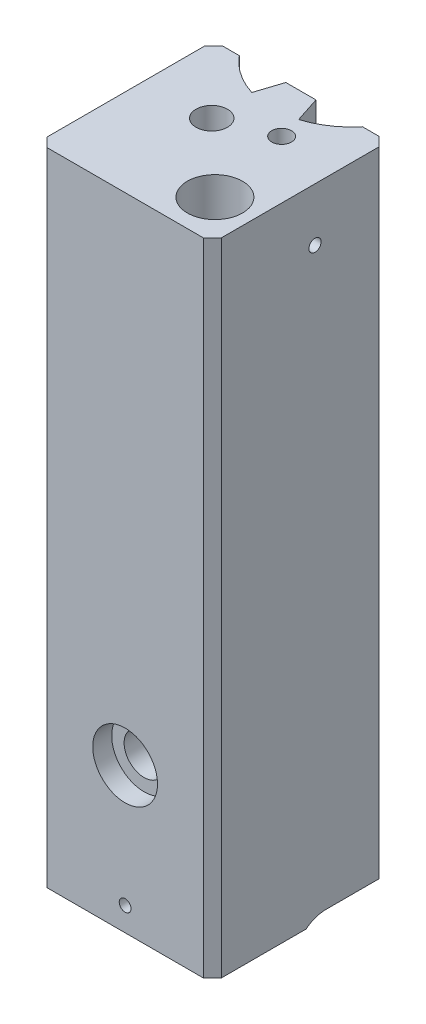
ISO-10303-21;
HEADER;
FILE_DESCRIPTION(('STEP AP214'),'2;1');
FILE_NAME('part.step','',(''),(''),'','','');
FILE_SCHEMA(('AUTOMOTIVE_DESIGN { 1 0 10303 214 1 1 1 1 }'));
ENDSEC;
DATA;
#1=APPLICATION_CONTEXT('core data for automotive mechanical design processes');
#2=APPLICATION_PROTOCOL_DEFINITION('international standard','automotive_design',2000,#1);
#3=PRODUCT_CONTEXT('',#1,'mechanical');
#4=PRODUCT('Part','Part','',(#3));
#5=PRODUCT_RELATED_PRODUCT_CATEGORY('part','',(#4));
#6=PRODUCT_DEFINITION_FORMATION('','',#4);
#7=PRODUCT_DEFINITION_CONTEXT('part definition',#1,'design');
#8=PRODUCT_DEFINITION('design','',#6,#7);
#9=PRODUCT_DEFINITION_SHAPE('','',#8);
#10=(LENGTH_UNIT() NAMED_UNIT(*) SI_UNIT(.MILLI.,.METRE.));
#11=(NAMED_UNIT(*) PLANE_ANGLE_UNIT() SI_UNIT($,.RADIAN.));
#12=(NAMED_UNIT(*) SI_UNIT($,.STERADIAN.) SOLID_ANGLE_UNIT());
#13=UNCERTAINTY_MEASURE_WITH_UNIT(LENGTH_MEASURE(1.E-05),#10,'distance_accuracy_value','');
#14=(GEOMETRIC_REPRESENTATION_CONTEXT(3) GLOBAL_UNCERTAINTY_ASSIGNED_CONTEXT((#13)) GLOBAL_UNIT_ASSIGNED_CONTEXT((#10,
#11,#12)) REPRESENTATION_CONTEXT('',''));
#15=CARTESIAN_POINT('',(0.,0.,0.));
#16=DIRECTION('',(0.,0.,1.));
#17=DIRECTION('',(1.,0.,0.));
#18=AXIS2_PLACEMENT_3D('',#15,#16,#17);
#19=CARTESIAN_POINT('',(-75.44816,140.97,54.59984));
#20=DIRECTION('',(0.,1.,0.));
#21=DIRECTION('',(1.,0.,0.));
#22=AXIS2_PLACEMENT_3D('',#19,#20,#21);
#23=PLANE('',#22);
#24=CARTESIAN_POINT('',(-69.98716,140.97,49.13884));
#25=DIRECTION('',(0.,1.,0.));
#26=DIRECTION('',(-1.,0.,0.));
#27=AXIS2_PLACEMENT_3D('',#24,#25,#26);
#28=CIRCLE('',#27,3.17499999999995);
#29=CARTESIAN_POINT('',(-73.16216,140.97,49.13884));
#30=VERTEX_POINT('',#29);
#31=EDGE_CURVE('E20',#30,#30,#28,.T.);
#32=ORIENTED_EDGE('',*,*,#31,.F.);
#33=EDGE_LOOP('',(#32));
#34=FACE_BOUND('',#33,.T.);
#35=CARTESIAN_POINT('',(-69.98716,140.969999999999,49.13884));
#36=DIRECTION('',(-2.49320371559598E-13,1.,0.));
#37=DIRECTION('',(-1.,-2.49320371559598E-13,0.));
#38=AXIS2_PLACEMENT_3D('',#35,#36,#37);
#39=CIRCLE('',#38,5.46099999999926);
#40=CARTESIAN_POINT('',(-75.44816,140.969999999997,49.13884));
#41=VERTEX_POINT('',#40);
#42=EDGE_CURVE('E1055',#41,#41,#39,.F.);
#43=ORIENTED_EDGE('',*,*,#42,.F.);
#44=EDGE_LOOP('',(#43));
#45=FACE_BOUND('',#44,.T.);
#46=ADVANCED_FACE('F15',(#34,#45),#23,.T.);
#47=CARTESIAN_POINT('',(-69.98716,135.3566,49.13884));
#48=DIRECTION('',(0.,1.,0.));
#49=DIRECTION('',(-1.,0.,0.));
#50=AXIS2_PLACEMENT_3D('',#47,#48,#49);
#51=CYLINDRICAL_SURFACE('',#50,3.17499999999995);
#52=ORIENTED_EDGE('',*,*,#31,.T.);
#53=EDGE_LOOP('',(#52));
#54=FACE_BOUND('',#53,.T.);
#55=CARTESIAN_POINT('',(-69.98716,135.3566,49.13884));
#56=DIRECTION('',(0.,1.,0.));
#57=DIRECTION('',(-1.,0.,0.));
#58=AXIS2_PLACEMENT_3D('',#55,#56,#57);
#59=CIRCLE('',#58,3.17499999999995);
#60=CARTESIAN_POINT('',(-73.16216,135.3566,49.13884));
#61=VERTEX_POINT('',#60);
#62=EDGE_CURVE('E40',#61,#61,#59,.T.);
#63=ORIENTED_EDGE('',*,*,#62,.F.);
#64=EDGE_LOOP('',(#63));
#65=FACE_BOUND('',#64,.T.);
#66=ADVANCED_FACE('F1268',(#54,#65),#51,.F.);
#67=CARTESIAN_POINT('',(-74.71791,135.3566,44.4080900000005));
#68=DIRECTION('',(0.,-1.,0.));
#69=DIRECTION('',(1.,0.,0.));
#70=AXIS2_PLACEMENT_3D('',#67,#68,#69);
#71=PLANE('',#70);
#72=ORIENTED_EDGE('',*,*,#62,.T.);
#73=EDGE_LOOP('',(#72));
#74=FACE_BOUND('',#73,.T.);
#75=CARTESIAN_POINT('',(-69.98716,135.356600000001,49.13884));
#76=DIRECTION('',(0.,-1.,-3.2677087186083E-13));
#77=DIRECTION('',(0.,3.2677087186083E-13,-1.));
#78=AXIS2_PLACEMENT_3D('',#75,#76,#77);
#79=CIRCLE('',#78,4.73074999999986);
#80=CARTESIAN_POINT('',(-69.98716,135.356600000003,44.40809));
#81=VERTEX_POINT('',#80);
#82=EDGE_CURVE('E1255',#81,#81,#79,.F.);
#83=ORIENTED_EDGE('',*,*,#82,.F.);
#84=EDGE_LOOP('',(#83));
#85=FACE_BOUND('',#84,.T.);
#86=ADVANCED_FACE('F1265',(#74,#85),#71,.T.);
#87=CARTESIAN_POINT('',(-69.98716,134.56285,49.13884));
#88=DIRECTION('',(0.,-1.,-3.2677087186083E-13));
#89=DIRECTION('',(0.,3.2677087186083E-13,-1.));
#90=AXIS2_PLACEMENT_3D('',#87,#88,#89);
#91=TOROIDAL_SURFACE('',#90,4.7307500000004,0.793750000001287);
#92=CARTESIAN_POINT('',(-69.98716,134.562850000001,49.1388400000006));
#93=DIRECTION('',(7.65425933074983E-13,-1.,1.01432252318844E-13));
#94=DIRECTION('',(1.,7.65425933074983E-13,0.));
#95=AXIS2_PLACEMENT_3D('',#92,#93,#94);
#96=CIRCLE('',#95,5.52449999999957);
#97=CARTESIAN_POINT('',(-64.46266,134.562850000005,49.1388400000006));
#98=VERTEX_POINT('',#97);
#99=EDGE_CURVE('E1252',#98,#98,#96,.F.);
#100=ORIENTED_EDGE('',*,*,#99,.F.);
#101=EDGE_LOOP('',(#100));
#102=FACE_BOUND('',#101,.T.);
#103=ORIENTED_EDGE('',*,*,#82,.T.);
#104=EDGE_LOOP('',(#103));
#105=FACE_BOUND('',#104,.T.);
#106=ADVANCED_FACE('F1262',(#102,#105),#91,.F.);
#107=CARTESIAN_POINT('',(-69.98716,134.562849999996,49.1388400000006));
#108=DIRECTION('',(7.65425933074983E-13,-1.,1.01432252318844E-13));
#109=DIRECTION('',(1.,7.65425933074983E-13,0.));
#110=AXIS2_PLACEMENT_3D('',#107,#108,#109);
#111=CYLINDRICAL_SURFACE('',#110,5.52449999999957);
#112=ORIENTED_EDGE('',*,*,#99,.T.);
#113=EDGE_LOOP('',(#112));
#114=FACE_BOUND('',#113,.T.);
#115=CARTESIAN_POINT('',(-69.9871599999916,123.926600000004,49.1388400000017));
#116=DIRECTION('',(7.65425933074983E-13,-1.,1.01432252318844E-13));
#117=DIRECTION('',(1.,7.65425933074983E-13,0.));
#118=AXIS2_PLACEMENT_3D('',#115,#116,#117);
#119=CIRCLE('',#118,5.52449999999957);
#120=CARTESIAN_POINT('',(-64.462659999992,123.926600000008,49.1388400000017));
#121=VERTEX_POINT('',#120);
#122=EDGE_CURVE('E905',#121,#121,#119,.F.);
#123=ORIENTED_EDGE('',*,*,#122,.F.);
#124=EDGE_LOOP('',(#123));
#125=FACE_BOUND('',#124,.T.);
#126=ADVANCED_FACE('F1274',(#114,#125),#111,.F.);
#127=CARTESIAN_POINT('',(-79.41691,204.6986,31.77159));
#128=DIRECTION('',(0.,-1.,0.));
#129=DIRECTION('',(0.,0.,1.));
#130=AXIS2_PLACEMENT_3D('',#127,#128,#129);
#131=PLANE('',#130);
#132=CARTESIAN_POINT('',(-79.63916,204.6986,31.99384));
#133=DIRECTION('',(-1.09474964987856E-13,1.,1.46235173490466E-13));
#134=DIRECTION('',(0.,-1.46235173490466E-13,1.));
#135=AXIS2_PLACEMENT_3D('',#132,#133,#134);
#136=CIRCLE('',#135,0.222249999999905);
#137=CARTESIAN_POINT('',(-79.63916,204.6986,32.21609));
#138=VERTEX_POINT('',#137);
#139=EDGE_CURVE('E1249',#138,#138,#136,.T.);
#140=ORIENTED_EDGE('',*,*,#139,.F.);
#141=EDGE_LOOP('',(#140));
#142=FACE_BOUND('',#141,.T.);
#143=ADVANCED_FACE('F1282',(#142),#131,.T.);
#144=CARTESIAN_POINT('',(-81.09966,147.4216,47.67834));
#145=DIRECTION('',(0.,-1.,0.));
#146=DIRECTION('',(1.,0.,0.));
#147=AXIS2_PLACEMENT_3D('',#144,#145,#146);
#148=PLANE('',#147);
#149=CARTESIAN_POINT('',(-79.63916,147.4216,49.13884));
#150=DIRECTION('',(0.,-1.,0.));
#151=DIRECTION('',(0.,0.,-1.));
#152=AXIS2_PLACEMENT_3D('',#149,#150,#151);
#153=CIRCLE('',#152,1.46049999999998);
#154=CARTESIAN_POINT('',(-79.63916,147.4216,47.67834));
#155=VERTEX_POINT('',#154);
#156=EDGE_CURVE('E1246',#155,#155,#153,.F.);
#157=ORIENTED_EDGE('',*,*,#156,.F.);
#158=EDGE_LOOP('',(#157));
#159=FACE_BOUND('',#158,.T.);
#160=ADVANCED_FACE('F1286',(#159),#148,.T.);
#161=CARTESIAN_POINT('',(-79.63916,205.49235,31.99384));
#162=DIRECTION('',(-1.09474964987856E-13,1.,1.46235173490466E-13));
#163=DIRECTION('',(0.,-1.46235173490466E-13,1.));
#164=AXIS2_PLACEMENT_3D('',#161,#162,#163);
#165=DEGENERATE_TOROIDAL_SURFACE('',#164,0.222250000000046,0.793749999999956,.T.);
#166=ORIENTED_EDGE('',*,*,#139,.T.);
#167=EDGE_LOOP('',(#166));
#168=FACE_BOUND('',#167,.T.);
#169=CARTESIAN_POINT('',(-79.63916,205.49235,31.99384));
#170=DIRECTION('',(0.,1.,0.));
#171=DIRECTION('',(0.,0.,1.));
#172=AXIS2_PLACEMENT_3D('',#169,#170,#171);
#173=CIRCLE('',#172,1.01599999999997);
#174=CARTESIAN_POINT('',(-79.63916,205.49235,33.00984));
#175=VERTEX_POINT('',#174);
#176=EDGE_CURVE('E1243',#175,#175,#173,.T.);
#177=ORIENTED_EDGE('',*,*,#176,.F.);
#178=EDGE_LOOP('',(#177));
#179=FACE_BOUND('',#178,.T.);
#180=ADVANCED_FACE('F1290',(#168,#179),#165,.T.);
#181=CARTESIAN_POINT('',(-79.63916,147.4216,49.13884));
#182=DIRECTION('',(0.,-1.,0.));
#183=DIRECTION('',(0.,0.,-1.));
#184=AXIS2_PLACEMENT_3D('',#181,#182,#183);
#185=CYLINDRICAL_SURFACE('',#184,1.46049999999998);
#186=CARTESIAN_POINT('',(-79.63916,146.7866,49.13884));
#187=DIRECTION('',(0.,-1.,0.));
#188=DIRECTION('',(0.,0.,-1.));
#189=AXIS2_PLACEMENT_3D('',#186,#187,#188);
#190=CIRCLE('',#189,1.46049999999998);
#191=CARTESIAN_POINT('',(-79.63916,146.7866,47.67834));
#192=VERTEX_POINT('',#191);
#193=EDGE_CURVE('E1237',#192,#192,#190,.T.);
#194=ORIENTED_EDGE('',*,*,#193,.T.);
#195=EDGE_LOOP('',(#194));
#196=FACE_BOUND('',#195,.T.);
#197=ORIENTED_EDGE('',*,*,#156,.T.);
#198=EDGE_LOOP('',(#197));
#199=FACE_BOUND('',#198,.T.);
#200=ADVANCED_FACE('F1293',(#196,#199),#185,.F.);
#201=CARTESIAN_POINT('',(-79.63916,205.49235,31.99384));
#202=DIRECTION('',(0.,1.,0.));
#203=DIRECTION('',(0.,0.,1.));
#204=AXIS2_PLACEMENT_3D('',#201,#202,#203);
#205=CYLINDRICAL_SURFACE('',#204,1.01599999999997);
#206=CARTESIAN_POINT('',(-79.63916,206.0956,31.99384));
#207=DIRECTION('',(0.,1.,0.));
#208=DIRECTION('',(0.,0.,1.));
#209=AXIS2_PLACEMENT_3D('',#206,#207,#208);
#210=CIRCLE('',#209,1.01599999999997);
#211=CARTESIAN_POINT('',(-79.63916,206.0956,33.00984));
#212=VERTEX_POINT('',#211);
#213=EDGE_CURVE('E1231',#212,#212,#210,.F.);
#214=ORIENTED_EDGE('',*,*,#213,.T.);
#215=EDGE_LOOP('',(#214));
#216=FACE_BOUND('',#215,.T.);
#217=ORIENTED_EDGE('',*,*,#176,.T.);
#218=EDGE_LOOP('',(#217));
#219=FACE_BOUND('',#218,.T.);
#220=ADVANCED_FACE('F731',(#216,#219),#205,.T.);
#221=CARTESIAN_POINT('',(-79.63916,128.6256,51.4625798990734));
#222=DIRECTION('',(0.,0.,1.));
#223=DIRECTION('',(1.,0.,0.));
#224=AXIS2_PLACEMENT_3D('',#221,#222,#223);
#225=CYLINDRICAL_SURFACE('',#224,1.16840000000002);
#226=CARTESIAN_POINT('',(-78.47076,128.6256,51.4654370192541));
#227=CARTESIAN_POINT('',(-78.4707634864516,128.563668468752,51.4654411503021));
#228=CARTESIAN_POINT('',(-78.4757088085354,128.501696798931,51.4679425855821));
#229=CARTESIAN_POINT('',(-78.4952616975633,128.379675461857,51.4776049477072));
#230=CARTESIAN_POINT('',(-78.5098727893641,128.319626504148,51.4847675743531));
#231=CARTESIAN_POINT('',(-78.5418362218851,128.222182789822,51.4998334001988));
#232=CARTESIAN_POINT('',(-78.5567317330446,128.183798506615,51.5067293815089));
#233=CARTESIAN_POINT('',(-78.5903599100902,128.109017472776,51.5218152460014));
#234=CARTESIAN_POINT('',(-78.6090929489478,128.072620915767,51.5300052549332));
#235=CARTESIAN_POINT('',(-78.6634549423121,127.979326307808,51.5528733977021));
#236=CARTESIAN_POINT('',(-78.7021762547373,127.924390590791,51.568322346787));
#237=CARTESIAN_POINT('',(-78.7883167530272,127.822047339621,51.5998099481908));
#238=CARTESIAN_POINT('',(-78.8357338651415,127.774638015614,51.6158484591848));
#239=CARTESIAN_POINT('',(-78.9123180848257,127.710196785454,51.6389640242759));
#240=CARTESIAN_POINT('',(-78.9386524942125,127.68988913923,51.6464870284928));
#241=CARTESIAN_POINT('',(-78.9930408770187,127.651538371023,51.6610484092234));
#242=CARTESIAN_POINT('',(-79.0210945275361,127.633494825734,51.6680868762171));
#243=CARTESIAN_POINT('',(-79.1027170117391,127.585832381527,51.6870485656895));
#244=CARTESIAN_POINT('',(-79.1581553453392,127.559020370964,51.6981831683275));
#245=CARTESIAN_POINT('',(-79.2731140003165,127.514304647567,51.7171377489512));
#246=CARTESIAN_POINT('',(-79.3326384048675,127.496409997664,51.7249543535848));
#247=CARTESIAN_POINT('',(-79.4542956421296,127.470238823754,51.7364876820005));
#248=CARTESIAN_POINT('',(-79.5164333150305,127.46198104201,51.7401964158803));
#249=CARTESIAN_POINT('',(-79.6413384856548,127.455530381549,51.7430879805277));
#250=CARTESIAN_POINT('',(-79.7041059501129,127.457336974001,51.7422710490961));
#251=CARTESIAN_POINT('',(-79.8260519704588,127.470671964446,51.7363157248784));
#252=CARTESIAN_POINT('',(-79.8852781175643,127.481845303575,51.7313351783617));
#253=CARTESIAN_POINT('',(-80.0008549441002,127.512986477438,51.7177481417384));
#254=CARTESIAN_POINT('',(-80.0572098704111,127.532940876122,51.7091471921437));
#255=CARTESIAN_POINT('',(-80.1315406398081,127.565786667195,51.6954382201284));
#256=CARTESIAN_POINT('',(-80.1513407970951,127.57521492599,51.6915404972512));
#257=CARTESIAN_POINT('',(-80.1903281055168,127.595138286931,51.6834072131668));
#258=CARTESIAN_POINT('',(-80.2095152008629,127.605633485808,51.6791716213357));
#259=CARTESIAN_POINT('',(-80.2864617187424,127.650571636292,51.6612913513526));
#260=CARTESIAN_POINT('',(-80.3414424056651,127.689420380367,51.6464002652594));
#261=CARTESIAN_POINT('',(-80.4437896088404,127.775764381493,51.6154612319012));
#262=CARTESIAN_POINT('',(-80.4911500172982,127.823266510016,51.5994123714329));
#263=CARTESIAN_POINT('',(-80.5554539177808,127.899882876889,51.5758740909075));
#264=CARTESIAN_POINT('',(-80.5757022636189,127.926206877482,51.5681451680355));
#265=CARTESIAN_POINT('',(-80.6139272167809,127.980548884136,51.5530609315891));
#266=CARTESIAN_POINT('',(-80.6319042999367,128.008566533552,51.5457055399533));
#267=CARTESIAN_POINT('',(-80.6792204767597,128.089775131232,51.5258014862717));
#268=CARTESIAN_POINT('',(-80.7058010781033,128.144783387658,51.5139353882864));
#269=CARTESIAN_POINT('',(-80.750187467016,128.258835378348,51.4935023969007));
#270=CARTESIAN_POINT('',(-80.7679938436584,128.317878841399,51.4849352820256));
#271=CARTESIAN_POINT('',(-80.7898306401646,128.418635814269,51.474275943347));
#272=CARTESIAN_POINT('',(-80.7964647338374,128.459672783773,51.4709812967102));
#273=CARTESIAN_POINT('',(-80.8053304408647,128.542333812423,51.4665605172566));
#274=CARTESIAN_POINT('',(-80.8075623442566,128.583957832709,51.4654342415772));
#275=CARTESIAN_POINT('',(-80.8075565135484,128.687531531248,51.4654411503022));
#276=CARTESIAN_POINT('',(-80.8026111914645,128.749503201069,51.4679425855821));
#277=CARTESIAN_POINT('',(-80.7830583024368,128.871524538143,51.4776049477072));
#278=CARTESIAN_POINT('',(-80.7684472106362,128.931573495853,51.4847675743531));
#279=CARTESIAN_POINT('',(-80.7364837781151,129.029017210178,51.4998334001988));
#280=CARTESIAN_POINT('',(-80.7215882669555,129.067401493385,51.5067293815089));
#281=CARTESIAN_POINT('',(-80.6879600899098,129.142182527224,51.5218152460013));
#282=CARTESIAN_POINT('',(-80.6692270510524,129.178579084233,51.5300052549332));
#283=CARTESIAN_POINT('',(-80.6148650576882,129.271873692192,51.5528733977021));
#284=CARTESIAN_POINT('',(-80.5761437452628,129.326809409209,51.5683223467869));
#285=CARTESIAN_POINT('',(-80.4900032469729,129.429152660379,51.5998099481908));
#286=CARTESIAN_POINT('',(-80.4425861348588,129.476561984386,51.615848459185));
#287=CARTESIAN_POINT('',(-80.3660019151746,129.541003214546,51.638964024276));
#288=CARTESIAN_POINT('',(-80.3396675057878,129.56131086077,51.6464870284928));
#289=CARTESIAN_POINT('',(-80.2852791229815,129.599661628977,51.6610484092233));
#290=CARTESIAN_POINT('',(-80.2572254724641,129.617705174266,51.6680868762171));
#291=CARTESIAN_POINT('',(-80.1756029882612,129.665367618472,51.6870485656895));
#292=CARTESIAN_POINT('',(-80.1201646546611,129.692179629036,51.6981831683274));
#293=CARTESIAN_POINT('',(-80.0052059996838,129.736895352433,51.7171377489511));
#294=CARTESIAN_POINT('',(-79.9456815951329,129.754790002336,51.7249543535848));
#295=CARTESIAN_POINT('',(-79.8240243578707,129.780961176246,51.7364876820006));
#296=CARTESIAN_POINT('',(-79.7618866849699,129.78921895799,51.7401964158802));
#297=CARTESIAN_POINT('',(-79.6369815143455,129.795669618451,51.7430879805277));
#298=CARTESIAN_POINT('',(-79.5742140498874,129.793863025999,51.7422710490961));
#299=CARTESIAN_POINT('',(-79.4522680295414,129.780528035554,51.7363157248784));
#300=CARTESIAN_POINT('',(-79.393041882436,129.769354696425,51.7313351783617));
#301=CARTESIAN_POINT('',(-79.2774650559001,129.738213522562,51.7177481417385));
#302=CARTESIAN_POINT('',(-79.2211101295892,129.718259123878,51.7091471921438));
#303=CARTESIAN_POINT('',(-79.1467793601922,129.685413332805,51.6954382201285));
#304=CARTESIAN_POINT('',(-79.1269792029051,129.67598507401,51.6915404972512));
#305=CARTESIAN_POINT('',(-79.0879918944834,129.656061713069,51.6834072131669));
#306=CARTESIAN_POINT('',(-79.0688047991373,129.645566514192,51.6791716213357));
#307=CARTESIAN_POINT('',(-78.9918582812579,129.600628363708,51.6612913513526));
#308=CARTESIAN_POINT('',(-78.9368775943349,129.561779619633,51.6464002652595));
#309=CARTESIAN_POINT('',(-78.8345303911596,129.475435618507,51.6154612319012));
#310=CARTESIAN_POINT('',(-78.7871699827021,129.427933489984,51.5994123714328));
#311=CARTESIAN_POINT('',(-78.7228660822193,129.351317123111,51.5758740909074));
#312=CARTESIAN_POINT('',(-78.7026177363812,129.324993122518,51.5681451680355));
#313=CARTESIAN_POINT('',(-78.6643927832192,129.270651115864,51.5530609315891));
#314=CARTESIAN_POINT('',(-78.6464157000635,129.242633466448,51.5457055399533));
#315=CARTESIAN_POINT('',(-78.5990995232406,129.161424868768,51.5258014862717));
#316=CARTESIAN_POINT('',(-78.5725189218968,129.106416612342,51.5139353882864));
#317=CARTESIAN_POINT('',(-78.528132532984,128.992364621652,51.4935023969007));
#318=CARTESIAN_POINT('',(-78.5103261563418,128.933321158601,51.4849352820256));
#319=CARTESIAN_POINT('',(-78.4884893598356,128.832564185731,51.474275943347));
#320=CARTESIAN_POINT('',(-78.4818552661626,128.791527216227,51.4709812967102));
#321=CARTESIAN_POINT('',(-78.4729895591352,128.708866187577,51.4665605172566));
#322=CARTESIAN_POINT('',(-78.4707576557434,128.667242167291,51.4654342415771));
#323=CARTESIAN_POINT('',(-78.47076,128.6256,51.4654370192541));
#324=B_SPLINE_CURVE_WITH_KNOTS('',3,(#226,#227,#228,#229,#230,#231,#232,#233,#234,#235,#236,
#237,#238,#239,#240,#241,#242,#243,#244,#245,#246,#247,#248,#249,#250,#251,#252,#253,#254,#255,
#256,#257,#258,#259,#260,#261,#262,#263,#264,#265,#266,#267,#268,#269,#270,#271,#272,#273,#274,
#275,#276,#277,#278,#279,#280,#281,#282,#283,#284,#285,#286,#287,#288,#289,#290,#291,#292,#293,
#294,#295,#296,#297,#298,#299,#300,#301,#302,#303,#304,#305,#306,#307,#308,#309,#310,#311,#312,
#313,#314,#315,#316,#317,#318,#319,#320,#321,#322,#323),.UNSPECIFIED.,.T.,.F.,(4,2,2,2,2,2,2,2,
2,2,2,2,2,2,2,2,2,2,2,2,2,2,2,2,2,2,2,2,2,2,2,2,2,2,2,2,2,2,2,2,2,2,2,2,2,2,2,2,4),(0.,
0.185633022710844,0.371333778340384,0.496339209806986,0.621356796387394,0.827217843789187,
1.03302986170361,1.13521024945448,1.23737150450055,1.4242388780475,1.61129578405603,
1.79871588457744,1.98612613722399,2.16673764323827,2.34707374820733,2.41386869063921,
2.48066969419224,2.68641375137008,2.89232190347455,2.99451217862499,3.0966810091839,
3.28255803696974,3.46842258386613,3.5932486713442,3.71806653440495,3.90369955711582,
4.08940031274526,4.21440574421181,4.33942333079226,4.54528437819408,4.75109639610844,
4.85327678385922,4.95543803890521,5.1423054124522,5.32936231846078,5.51678241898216,
5.70419267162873,5.88480417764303,6.06514028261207,6.13193522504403,6.19873622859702,
6.40448028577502,6.6103884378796,6.71257871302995,6.81474754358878,7.00062457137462,
7.18648911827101,7.31131520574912,7.43613306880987),.UNSPECIFIED.);
#325=CARTESIAN_POINT('',(-78.47076,128.6256,51.4654370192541));
#326=VERTEX_POINT('',#325);
#327=EDGE_CURVE('E715',#326,#326,#324,.T.);
#328=ORIENTED_EDGE('',*,*,#327,.T.);
#329=EDGE_LOOP('',(#328));
#330=FACE_BOUND('',#329,.T.);
#331=CARTESIAN_POINT('',(-79.63916,128.6256,57.26684));
#332=DIRECTION('',(0.,0.,1.));
#333=DIRECTION('',(1.,0.,0.));
#334=AXIS2_PLACEMENT_3D('',#331,#332,#333);
#335=CIRCLE('',#334,1.16840000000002);
#336=CARTESIAN_POINT('',(-78.47076,128.6256,57.26684));
#337=VERTEX_POINT('',#336);
#338=EDGE_CURVE('E1332',#337,#337,#335,.T.);
#339=ORIENTED_EDGE('',*,*,#338,.T.);
#340=EDGE_LOOP('',(#339));
#341=FACE_BOUND('',#340,.T.);
#342=ADVANCED_FACE('F726',(#330,#341),#225,.F.);
#343=CARTESIAN_POINT('',(-82.24266,146.7866,46.53534));
#344=DIRECTION('',(0.,-1.,0.));
#345=DIRECTION('',(1.,0.,0.));
#346=AXIS2_PLACEMENT_3D('',#343,#344,#345);
#347=PLANE('',#346);
#348=ORIENTED_EDGE('',*,*,#193,.F.);
#349=EDGE_LOOP('',(#348));
#350=FACE_BOUND('',#349,.T.);
#351=CARTESIAN_POINT('',(-79.63916,146.7866,49.13884));
#352=DIRECTION('',(0.,-1.,0.));
#353=DIRECTION('',(0.,0.,-1.));
#354=AXIS2_PLACEMENT_3D('',#351,#352,#353);
#355=CIRCLE('',#354,2.60349999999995);
#356=CARTESIAN_POINT('',(-79.63916,146.7866,46.53534));
#357=VERTEX_POINT('',#356);
#358=EDGE_CURVE('E722',#357,#357,#355,.F.);
#359=ORIENTED_EDGE('',*,*,#358,.F.);
#360=EDGE_LOOP('',(#359));
#361=FACE_BOUND('',#360,.T.);
#362=ADVANCED_FACE('F730',(#350,#361),#347,.T.);
#363=CARTESIAN_POINT('',(-62.36716,125.3236,24.2468400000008));
#364=DIRECTION('',(0.707106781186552,0.,-0.707106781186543));
#365=DIRECTION('',(-0.707106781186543,0.,-0.707106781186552));
#366=AXIS2_PLACEMENT_3D('',#363,#364,#365);
#367=PLANE('',#366);
#368=DIRECTION('',(0.707106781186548,0.,0.707106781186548));
#369=VECTOR('',#368,1.);
#370=CARTESIAN_POINT('',(-62.55766,125.3236,24.0563400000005));
#371=LINE('',#370,#369);
#372=CARTESIAN_POINT('',(-62.55766,125.3236,24.0563400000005));
#373=VERTEX_POINT('',#372);
#374=CARTESIAN_POINT('',(-62.36716,125.3236,24.2468400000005));
#375=VERTEX_POINT('',#374);
#376=EDGE_CURVE('E1343',#373,#375,#371,.T.);
#377=ORIENTED_EDGE('',*,*,#376,.F.);
#378=CARTESIAN_POINT('',(-62.5576599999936,126.911100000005,24.0563400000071));
#379=DIRECTION('',(0.707106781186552,0.,-0.707106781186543));
#380=DIRECTION('',(0.707106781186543,8.7263670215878E-13,0.707106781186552));
#381=AXIS2_PLACEMENT_3D('',#378,#379,#380);
#382=ELLIPSE('',#381,2.24506403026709,1.58749999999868);
#383=CARTESIAN_POINT('',(-64.1451599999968,126.911100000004,22.4688400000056));
#384=VERTEX_POINT('',#383);
#385=EDGE_CURVE('E1353',#384,#373,#382,.F.);
#386=ORIENTED_EDGE('',*,*,#385,.F.);
#387=DIRECTION('',(0.,1.,0.));
#388=VECTOR('',#387,1.);
#389=CARTESIAN_POINT('',(-64.14516,126.9111,22.4688400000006));
#390=LINE('',#389,#388);
#391=CARTESIAN_POINT('',(-64.14516,250.825,22.46884));
#392=VERTEX_POINT('',#391);
#393=EDGE_CURVE('E1359',#392,#384,#390,.F.);
#394=ORIENTED_EDGE('',*,*,#393,.F.);
#395=DIRECTION('',(-0.707106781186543,0.,-0.707106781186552));
#396=VECTOR('',#395,1.);
#397=CARTESIAN_POINT('',(-62.36716,250.825,24.24684));
#398=LINE('',#397,#396);
#399=CARTESIAN_POINT('',(-62.36716,250.825,24.24684));
#400=VERTEX_POINT('',#399);
#401=EDGE_CURVE('E1092',#400,#392,#398,.T.);
#402=ORIENTED_EDGE('',*,*,#401,.F.);
#403=DIRECTION('',(0.,1.,0.));
#404=VECTOR('',#403,1.);
#405=CARTESIAN_POINT('',(-62.36716,123.9266,24.2468400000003));
#406=LINE('',#405,#404);
#407=EDGE_CURVE('E1379',#375,#400,#406,.T.);
#408=ORIENTED_EDGE('',*,*,#407,.F.);
#409=EDGE_LOOP('',(#377,#386,#394,#402,#408));
#410=FACE_BOUND('',#409,.T.);
#411=ADVANCED_FACE('F633',(#410),#367,.T.);
#412=CARTESIAN_POINT('',(-62.36716,240.284,36.94684));
#413=DIRECTION('',(-1.,0.,0.));
#414=DIRECTION('',(0.,0.,1.));
#415=AXIS2_PLACEMENT_3D('',#412,#413,#414);
#416=CYLINDRICAL_SURFACE('',#415,1.20650000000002);
#417=CARTESIAN_POINT('',(-80.7186599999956,240.934681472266,35.9308400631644));
#418=CARTESIAN_POINT('',(-80.7186598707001,240.99019854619,35.9663985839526));
#419=CARTESIAN_POINT('',(-80.7192667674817,241.042858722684,36.0065626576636));
#420=CARTESIAN_POINT('',(-80.7226773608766,241.14093395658,36.0949725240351));
#421=CARTESIAN_POINT('',(-80.7254849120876,241.186336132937,36.1432323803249));
#422=CARTESIAN_POINT('',(-80.7342701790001,241.2685611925,36.2463906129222));
#423=CARTESIAN_POINT('',(-80.7402494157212,241.305379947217,36.3012921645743));
#424=CARTESIAN_POINT('',(-80.756155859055,241.369376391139,36.4158901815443));
#425=CARTESIAN_POINT('',(-80.7660811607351,241.396558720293,36.4755843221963));
#426=CARTESIAN_POINT('',(-80.7914637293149,241.442766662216,36.6034270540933));
#427=CARTESIAN_POINT('',(-80.8073462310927,241.460810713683,36.6718479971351));
#428=CARTESIAN_POINT('',(-80.844421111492,241.484682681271,36.8094072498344));
#429=CARTESIAN_POINT('',(-80.8656185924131,241.490498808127,36.8785461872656));
#430=CARTESIAN_POINT('',(-80.9145332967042,241.490501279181,37.0201365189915));
#431=CARTESIAN_POINT('',(-80.9426143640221,241.483804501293,37.0924595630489));
#432=CARTESIAN_POINT('',(-81.0031663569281,241.458266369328,37.2329107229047));
#433=CARTESIAN_POINT('',(-81.0356344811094,241.439432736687,37.3010414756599));
#434=CARTESIAN_POINT('',(-81.0860926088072,241.40344977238,37.3980886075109));
#435=CARTESIAN_POINT('',(-81.1029629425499,241.390395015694,37.4291882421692));
#436=CARTESIAN_POINT('',(-81.1372246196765,241.361879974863,37.4899242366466));
#437=CARTESIAN_POINT('',(-81.1546154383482,241.346422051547,37.5195619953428));
#438=CARTESIAN_POINT('',(-81.1989769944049,241.304492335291,37.5924540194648));
#439=CARTESIAN_POINT('',(-81.226187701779,241.276496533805,37.6346958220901));
#440=CARTESIAN_POINT('',(-81.280779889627,241.215450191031,37.7153488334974));
#441=CARTESIAN_POINT('',(-81.3081615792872,241.182391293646,37.7537535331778));
#442=CARTESIAN_POINT('',(-81.3700130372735,241.101293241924,37.8367493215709));
#443=CARTESIAN_POINT('',(-81.4042722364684,241.05167292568,37.8799719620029));
#444=CARTESIAN_POINT('',(-81.4695794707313,240.944637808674,37.9585724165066));
#445=CARTESIAN_POINT('',(-81.5006289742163,240.887226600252,37.9939538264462));
#446=CARTESIAN_POINT('',(-81.5501100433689,240.779069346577,38.0483459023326));
#447=CARTESIAN_POINT('',(-81.5697985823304,240.729857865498,38.0692502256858));
#448=CARTESIAN_POINT('',(-81.6038423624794,240.627484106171,38.1046728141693));
#449=CARTESIAN_POINT('',(-81.6182102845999,240.574331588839,38.1192062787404));
#450=CARTESIAN_POINT('',(-81.6367052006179,240.481443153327,38.1377167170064));
#451=CARTESIAN_POINT('',(-81.6426077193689,240.44242552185,38.143548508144));
#452=CARTESIAN_POINT('',(-81.6505395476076,240.363611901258,38.1513618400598));
#453=CARTESIAN_POINT('',(-81.6525690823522,240.323815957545,38.1533436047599));
#454=CARTESIAN_POINT('',(-81.6525559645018,240.228221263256,38.153334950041));
#455=CARTESIAN_POINT('',(-81.6485545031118,240.172403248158,38.1494334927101));
#456=CARTESIAN_POINT('',(-81.6331643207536,240.062818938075,38.1341895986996));
#457=CARTESIAN_POINT('',(-81.621762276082,240.009056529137,38.1228337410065));
#458=CARTESIAN_POINT('',(-81.5932344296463,239.90558473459,38.0937090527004));
#459=CARTESIAN_POINT('',(-81.5761660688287,239.855840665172,38.0760044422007));
#460=CARTESIAN_POINT('',(-81.53789495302,239.76043439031,38.0350588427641));
#461=CARTESIAN_POINT('',(-81.5166908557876,239.71477351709,38.0118160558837));
#462=CARTESIAN_POINT('',(-81.4699370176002,239.624636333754,37.9586760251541));
#463=CARTESIAN_POINT('',(-81.4441849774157,239.580478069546,37.9284218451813));
#464=CARTESIAN_POINT('',(-81.3909193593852,239.497195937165,37.8630193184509));
#465=CARTESIAN_POINT('',(-81.3634063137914,239.458070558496,37.8278724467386));
#466=CARTESIAN_POINT('',(-81.3086108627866,239.386172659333,37.7543675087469));
#467=CARTESIAN_POINT('',(-81.2813518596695,239.353230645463,37.7161573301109));
#468=CARTESIAN_POINT('',(-81.2269382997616,239.292302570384,37.6358403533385));
#469=CARTESIAN_POINT('',(-81.1997838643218,239.264321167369,37.5937299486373));
#470=CARTESIAN_POINT('',(-81.1368057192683,239.204677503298,37.4903638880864));
#471=CARTESIAN_POINT('',(-81.1013168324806,239.175220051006,37.4276087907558));
#472=CARTESIAN_POINT('',(-81.0334356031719,239.127198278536,37.2965582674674));
#473=CARTESIAN_POINT('',(-81.0010382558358,239.108616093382,37.2282721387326));
#474=CARTESIAN_POINT('',(-80.9561175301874,239.09000948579,37.123619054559));
#475=CARTESIAN_POINT('',(-80.9418929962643,239.085354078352,37.0887575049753));
#476=CARTESIAN_POINT('',(-80.9146316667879,239.079098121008,37.0182929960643));
#477=CARTESIAN_POINT('',(-80.901595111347,239.077498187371,36.9826898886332));
#478=CARTESIAN_POINT('',(-80.8677023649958,239.077503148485,36.8845697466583));
#479=CARTESIAN_POINT('',(-80.8481638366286,239.082338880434,36.8215549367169));
#480=CARTESIAN_POINT('',(-80.8134692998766,239.102176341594,36.6958680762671));
#481=CARTESIAN_POINT('',(-80.7983165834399,239.117185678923,36.6331963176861));
#482=CARTESIAN_POINT('',(-80.772424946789,239.157427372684,36.5101868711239));
#483=CARTESIAN_POINT('',(-80.761690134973,239.182669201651,36.4498514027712));
#484=CARTESIAN_POINT('',(-80.7442757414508,239.242913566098,36.3335955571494));
#485=CARTESIAN_POINT('',(-80.7375980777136,239.277920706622,36.2776772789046));
#486=CARTESIAN_POINT('',(-80.7276762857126,239.355949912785,36.1731880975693));
#487=CARTESIAN_POINT('',(-80.7243662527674,239.398797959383,36.124492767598));
#488=CARTESIAN_POINT('',(-80.7200666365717,239.491732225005,36.0346371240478));
#489=CARTESIAN_POINT('',(-80.7190715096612,239.541800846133,35.9934590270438));
#490=CARTESIAN_POINT('',(-80.7186935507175,239.607441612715,35.9477642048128));
#491=CARTESIAN_POINT('',(-80.718660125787,239.620297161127,35.9391782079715));
#492=CARTESIAN_POINT('',(-80.7186594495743,239.690295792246,35.8943550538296));
#493=CARTESIAN_POINT('',(-80.7192964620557,239.750447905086,35.8626155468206));
#494=CARTESIAN_POINT('',(-80.7209075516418,239.875326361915,35.8096280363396));
#495=CARTESIAN_POINT('',(-80.7218825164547,239.94006439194,35.788408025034));
#496=CARTESIAN_POINT('',(-80.7234716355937,240.072124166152,35.757157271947));
#497=CARTESIAN_POINT('',(-80.7240862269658,240.13944267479,35.7471129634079));
#498=CARTESIAN_POINT('',(-80.7246091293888,240.274797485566,35.7384709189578));
#499=CARTESIAN_POINT('',(-80.7245175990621,240.342833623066,35.7398706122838));
#500=CARTESIAN_POINT('',(-80.723678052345,240.477691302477,35.7540593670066));
#501=CARTESIAN_POINT('',(-80.7229300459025,240.544512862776,35.766848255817));
#502=CARTESIAN_POINT('',(-80.7212156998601,240.674977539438,35.8034442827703));
#503=CARTESIAN_POINT('',(-80.7202497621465,240.738626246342,35.8272312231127));
#504=CARTESIAN_POINT('',(-80.7192932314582,240.82302424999,35.8671364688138));
#505=CARTESIAN_POINT('',(-80.7190691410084,240.845919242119,35.878874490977));
#506=CARTESIAN_POINT('',(-80.7187525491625,240.890915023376,35.9037878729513));
#507=CARTESIAN_POINT('',(-80.7186600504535,240.913015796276,35.9169632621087));
#508=CARTESIAN_POINT('',(-80.7186599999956,240.934681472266,35.9308400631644));
#509=B_SPLINE_CURVE_WITH_KNOTS('',3,(#417,#418,#419,#420,#421,#422,#423,#424,#425,#426,#427,
#428,#429,#430,#431,#432,#433,#434,#435,#436,#437,#438,#439,#440,#441,#442,#443,#444,#445,#446,
#447,#448,#449,#450,#451,#452,#453,#454,#455,#456,#457,#458,#459,#460,#461,#462,#463,#464,#465,
#466,#467,#468,#469,#470,#471,#472,#473,#474,#475,#476,#477,#478,#479,#480,#481,#482,#483,#484,
#485,#486,#487,#488,#489,#490,#491,#492,#493,#494,#495,#496,#497,#498,#499,#500,#501,#502,#503,
#504,#505,#506,#507,#508),.UNSPECIFIED.,.T.,.F.,(4,2,2,2,2,2,2,2,2,2,2,2,2,2,2,2,2,2,2,2,2,2,2,
2,2,2,2,2,2,2,2,2,2,2,2,2,2,2,2,2,2,2,2,2,2,4),(0.,0.197690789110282,0.395728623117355,
0.593861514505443,0.791898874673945,1.00817180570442,1.22465315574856,1.45699234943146,
1.68918387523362,1.80223228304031,1.9151703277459,2.08735061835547,2.25981819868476,
2.48157219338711,2.70322428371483,2.87355552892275,3.04347816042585,3.16279850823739,
3.2821119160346,3.44925975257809,3.61670935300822,3.78251082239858,3.94836619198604,
4.12607849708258,4.3037373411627,4.4754169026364,4.64725683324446,4.87994210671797,
5.11224406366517,5.22593081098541,5.33964048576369,5.53715100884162,5.73480939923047,
5.93265118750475,6.13058643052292,6.32456890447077,6.51808635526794,6.56446414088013,
6.76739823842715,6.9708694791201,7.17409344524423,7.37727176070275,7.5804469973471,
7.78325057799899,7.86039832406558,7.93754764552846),.UNSPECIFIED.);
#510=CARTESIAN_POINT('',(-80.7186599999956,240.934681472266,35.9308400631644));
#511=VERTEX_POINT('',#510);
#512=EDGE_CURVE('E614',#511,#511,#509,.T.);
#513=ORIENTED_EDGE('',*,*,#512,.F.);
#514=EDGE_LOOP('',(#513));
#515=FACE_BOUND('',#514,.T.);
#516=CARTESIAN_POINT('',(-62.36716,240.284,36.94684));
#517=DIRECTION('',(-1.,0.,0.));
#518=DIRECTION('',(0.,0.,1.));
#519=AXIS2_PLACEMENT_3D('',#516,#517,#518);
#520=CIRCLE('',#519,1.20650000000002);
#521=CARTESIAN_POINT('',(-62.36716,240.284,38.15334));
#522=VERTEX_POINT('',#521);
#523=EDGE_CURVE('E723',#522,#522,#520,.F.);
#524=ORIENTED_EDGE('',*,*,#523,.T.);
#525=EDGE_LOOP('',(#524));
#526=FACE_BOUND('',#525,.T.);
#527=ADVANCED_FACE('F627',(#515,#526),#416,.F.);
#528=CARTESIAN_POINT('',(-85.79866,206.0956,25.7099181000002));
#529=DIRECTION('',(0.,-1.,0.));
#530=DIRECTION('',(1.,0.,0.));
#531=AXIS2_PLACEMENT_3D('',#528,#529,#530);
#532=PLANE('',#531);
#533=ORIENTED_EDGE('',*,*,#213,.F.);
#534=EDGE_LOOP('',(#533));
#535=FACE_BOUND('',#534,.T.);
#536=CARTESIAN_POINT('',(-79.6391599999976,206.095600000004,31.9938400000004));
#537=DIRECTION('',(7.20998527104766E-13,-1.,0.));
#538=DIRECTION('',(1.,7.20998527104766E-13,0.));
#539=AXIS2_PLACEMENT_3D('',#536,#537,#538);
#540=CIRCLE('',#539,6.15950000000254);
#541=CARTESIAN_POINT('',(-73.7572880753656,206.0956,30.1654464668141));
#542=VERTEX_POINT('',#541);
#543=CARTESIAN_POINT('',(-85.6366079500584,206.0956,33.3974276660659));
#544=VERTEX_POINT('',#543);
#545=EDGE_CURVE('E1157',#542,#544,#540,.F.);
#546=ORIENTED_EDGE('',*,*,#545,.F.);
#547=CARTESIAN_POINT('',(-73.79716,206.0956,32.12084));
#548=DIRECTION('',(0.,1.,0.));
#549=DIRECTION('',(-1.,0.,0.));
#550=AXIS2_PLACEMENT_3D('',#547,#548,#549);
#551=CIRCLE('',#550,1.9558);
#552=CARTESIAN_POINT('',(-73.8423026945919,206.0956,34.0761189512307));
#553=VERTEX_POINT('',#552);
#554=EDGE_CURVE('E1228',#553,#542,#551,.F.);
#555=ORIENTED_EDGE('',*,*,#554,.F.);
#556=CARTESIAN_POINT('',(-79.63916,206.0956,31.99384));
#557=DIRECTION('',(0.,-1.,0.));
#558=DIRECTION('',(0.,0.,-1.));
#559=AXIS2_PLACEMENT_3D('',#556,#557,#558);
#560=CIRCLE('',#559,6.15950000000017);
#561=CARTESIAN_POINT('',(-81.4144837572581,206.0956,37.8919469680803));
#562=VERTEX_POINT('',#561);
#563=EDGE_CURVE('E602',#562,#553,#560,.F.);
#564=ORIENTED_EDGE('',*,*,#563,.F.);
#565=CARTESIAN_POINT('',(-83.83016,206.0956,35.93084));
#566=DIRECTION('',(1.18495685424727E-13,1.,0.));
#567=DIRECTION('',(-1.,1.18495685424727E-13,0.));
#568=AXIS2_PLACEMENT_3D('',#565,#566,#567);
#569=CIRCLE('',#568,3.11150000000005);
#570=EDGE_CURVE('E1165',#544,#562,#569,.F.);
#571=ORIENTED_EDGE('',*,*,#570,.F.);
#572=EDGE_LOOP('',(#546,#555,#564,#571));
#573=FACE_BOUND('',#572,.T.);
#574=ADVANCED_FACE('F632',(#535,#573),#532,.T.);
#575=CARTESIAN_POINT('',(-95.13316,132.9436,22.4688400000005));
#576=DIRECTION('',(0.,0.,-1.));
#577=DIRECTION('',(0.,1.,0.));
#578=AXIS2_PLACEMENT_3D('',#575,#576,#577);
#579=PLANE('',#578);
#580=DIRECTION('',(0.,1.,0.));
#581=VECTOR('',#580,1.);
#582=CARTESIAN_POINT('',(-89.34196,125.294406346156,22.4688400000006));
#583=LINE('',#582,#581);
#584=CARTESIAN_POINT('',(-89.34196,132.9436,22.4688400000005));
#585=VERTEX_POINT('',#584);
#586=CARTESIAN_POINT('',(-89.34196,141.909740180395,22.4688400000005));
#587=VERTEX_POINT('',#586);
#588=EDGE_CURVE('E991',#585,#587,#583,.T.);
#589=ORIENTED_EDGE('',*,*,#588,.F.);
#590=DIRECTION('',(1.,0.,0.));
#591=VECTOR('',#590,1.);
#592=CARTESIAN_POINT('',(-96.91116,132.9436,22.4688400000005));
#593=LINE('',#592,#591);
#594=CARTESIAN_POINT('',(-95.13316,132.9436,22.4688400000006));
#595=VERTEX_POINT('',#594);
#596=EDGE_CURVE('E1026',#595,#585,#593,.T.);
#597=ORIENTED_EDGE('',*,*,#596,.F.);
#598=DIRECTION('',(0.,1.,0.));
#599=VECTOR('',#598,1.);
#600=CARTESIAN_POINT('',(-95.13316,132.9436,22.4688400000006));
#601=LINE('',#600,#599);
#602=CARTESIAN_POINT('',(-95.13316,141.909740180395,22.4688400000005));
#603=VERTEX_POINT('',#602);
#604=EDGE_CURVE('E1033',#603,#595,#601,.F.);
#605=ORIENTED_EDGE('',*,*,#604,.F.);
#606=DIRECTION('',(1.,0.,0.));
#607=VECTOR('',#606,1.);
#608=CARTESIAN_POINT('',(-96.91116,141.909740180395,22.4688400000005));
#609=LINE('',#608,#607);
#610=EDGE_CURVE('E587',#587,#603,#609,.F.);
#611=ORIENTED_EDGE('',*,*,#610,.F.);
#612=EDGE_LOOP('',(#589,#597,#605,#611));
#613=FACE_BOUND('',#612,.T.);
#614=ADVANCED_FACE('F638',(#613),#579,.T.);
#615=CARTESIAN_POINT('',(-73.79716,203.1746,32.12084));
#616=DIRECTION('',(0.,1.,0.));
#617=DIRECTION('',(-1.,0.,0.));
#618=AXIS2_PLACEMENT_3D('',#615,#616,#617);
#619=CYLINDRICAL_SURFACE('',#618,1.9558);
#620=CARTESIAN_POINT('',(-73.7971600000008,250.825,32.1208399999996));
#621=DIRECTION('',(0.,1.,0.));
#622=DIRECTION('',(-1.,0.,0.));
#623=AXIS2_PLACEMENT_3D('',#620,#621,#622);
#624=CIRCLE('',#623,1.9558);
#625=CARTESIAN_POINT('',(-75.75296,250.825,32.1208399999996));
#626=VERTEX_POINT('',#625);
#627=EDGE_CURVE('E1115',#626,#626,#624,.F.);
#628=ORIENTED_EDGE('',*,*,#627,.F.);
#629=EDGE_LOOP('',(#628));
#630=FACE_BOUND('',#629,.T.);
#631=DIRECTION('',(0.,-1.,0.));
#632=VECTOR('',#631,1.);
#633=CARTESIAN_POINT('',(-73.7572880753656,206.0956,30.1654464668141));
#634=LINE('',#633,#632);
#635=CARTESIAN_POINT('',(-73.7572880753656,203.1746,30.1654464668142));
#636=VERTEX_POINT('',#635);
#637=EDGE_CURVE('E1153',#636,#542,#634,.F.);
#638=ORIENTED_EDGE('',*,*,#637,.F.);
#639=CARTESIAN_POINT('',(-73.79716,203.1746,32.12084));
#640=DIRECTION('',(0.,1.,0.));
#641=DIRECTION('',(-1.,0.,0.));
#642=AXIS2_PLACEMENT_3D('',#639,#640,#641);
#643=CIRCLE('',#642,1.9558);
#644=CARTESIAN_POINT('',(-73.8423026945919,203.1746,34.0761189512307));
#645=VERTEX_POINT('',#644);
#646=EDGE_CURVE('E987',#645,#636,#643,.T.);
#647=ORIENTED_EDGE('',*,*,#646,.F.);
#648=DIRECTION('',(0.,-1.,0.));
#649=VECTOR('',#648,1.);
#650=CARTESIAN_POINT('',(-73.8423026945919,206.0956,34.0761189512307));
#651=LINE('',#650,#649);
#652=EDGE_CURVE('E610',#553,#645,#651,.T.);
#653=ORIENTED_EDGE('',*,*,#652,.F.);
#654=ORIENTED_EDGE('',*,*,#554,.T.);
#655=EDGE_LOOP('',(#638,#647,#653,#654));
#656=FACE_BOUND('',#655,.T.);
#657=ADVANCED_FACE('F642',(#630,#656),#619,.F.);
#658=CARTESIAN_POINT('',(-76.65466,203.1746,22.46884));
#659=DIRECTION('',(0.951034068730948,0.,-0.309086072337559));
#660=DIRECTION('',(0.,1.,0.));
#661=AXIS2_PLACEMENT_3D('',#658,#659,#660);
#662=PLANE('',#661);
#663=DIRECTION('',(-0.309086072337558,0.,-0.951034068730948));
#664=VECTOR('',#663,1.);
#665=CARTESIAN_POINT('',(-75.00366,250.825,27.54884));
#666=LINE('',#665,#664);
#667=CARTESIAN_POINT('',(-75.00366,250.825,27.548840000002));
#668=VERTEX_POINT('',#667);
#669=CARTESIAN_POINT('',(-76.65466,250.825,22.46884));
#670=VERTEX_POINT('',#669);
#671=EDGE_CURVE('E1104',#668,#670,#666,.T.);
#672=ORIENTED_EDGE('',*,*,#671,.F.);
#673=DIRECTION('',(0.,1.,0.));
#674=VECTOR('',#673,1.);
#675=CARTESIAN_POINT('',(-75.00366,149.3647,27.5488400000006));
#676=LINE('',#675,#674);
#677=CARTESIAN_POINT('',(-75.00366,203.1746,27.5488400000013));
#678=VERTEX_POINT('',#677);
#679=EDGE_CURVE('E1230',#678,#668,#676,.T.);
#680=ORIENTED_EDGE('',*,*,#679,.F.);
#681=DIRECTION('',(0.309086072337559,0.,0.951034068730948));
#682=VECTOR('',#681,1.);
#683=CARTESIAN_POINT('',(-76.65466,203.1746,22.46884));
#684=LINE('',#683,#682);
#685=CARTESIAN_POINT('',(-76.65466,203.1746,22.46884));
#686=VERTEX_POINT('',#685);
#687=EDGE_CURVE('E976',#686,#678,#684,.T.);
#688=ORIENTED_EDGE('',*,*,#687,.F.);
#689=DIRECTION('',(0.,1.,0.));
#690=VECTOR('',#689,1.);
#691=CARTESIAN_POINT('',(-76.65466,203.1746,22.46884));
#692=LINE('',#691,#690);
#693=EDGE_CURVE('E1150',#670,#686,#692,.F.);
#694=ORIENTED_EDGE('',*,*,#693,.F.);
#695=EDGE_LOOP('',(#672,#680,#688,#694));
#696=FACE_BOUND('',#695,.T.);
#697=ADVANCED_FACE('F646',(#696),#662,.T.);
#698=CARTESIAN_POINT('',(-79.63916,149.3647,12.4933868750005));
#699=DIRECTION('',(0.,1.,0.));
#700=DIRECTION('',(0.,0.,1.));
#701=AXIS2_PLACEMENT_3D('',#698,#699,#700);
#702=CYLINDRICAL_SURFACE('',#701,15.7529212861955);
#703=CARTESIAN_POINT('',(-79.63916,250.825,12.4933868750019));
#704=DIRECTION('',(0.,1.,0.));
#705=DIRECTION('',(0.,0.,1.));
#706=AXIS2_PLACEMENT_3D('',#703,#704,#705);
#707=CIRCLE('',#706,15.7529212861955);
#708=CARTESIAN_POINT('',(-67.4471599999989,250.825,22.46884));
#709=VERTEX_POINT('',#708);
#710=EDGE_CURVE('E1100',#709,#668,#707,.F.);
#711=ORIENTED_EDGE('',*,*,#710,.F.);
#712=DIRECTION('',(0.,1.,0.));
#713=VECTOR('',#712,1.);
#714=CARTESIAN_POINT('',(-67.44716,126.9111,22.4688400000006));
#715=LINE('',#714,#713);
#716=CARTESIAN_POINT('',(-67.44716,149.3647,22.4688400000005));
#717=VERTEX_POINT('',#716);
#718=EDGE_CURVE('E680',#717,#709,#715,.T.);
#719=ORIENTED_EDGE('',*,*,#718,.F.);
#720=CARTESIAN_POINT('',(-79.63916,149.3647,12.4933868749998));
#721=DIRECTION('',(0.,1.,0.));
#722=DIRECTION('',(0.,0.,1.));
#723=AXIS2_PLACEMENT_3D('',#720,#721,#722);
#724=CIRCLE('',#723,15.7529212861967);
#725=CARTESIAN_POINT('',(-69.9774392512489,149.3647,24.9354799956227));
#726=VERTEX_POINT('',#725);
#727=EDGE_CURVE('E1235',#726,#717,#724,.T.);
#728=ORIENTED_EDGE('',*,*,#727,.F.);
#729=DIRECTION('',(0.,1.,0.));
#730=VECTOR('',#729,1.);
#731=CARTESIAN_POINT('',(-69.9774392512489,125.294406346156,24.9354799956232));
#732=LINE('',#731,#730);
#733=CARTESIAN_POINT('',(-69.9774392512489,203.1746,24.9354799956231));
#734=VERTEX_POINT('',#733);
#735=EDGE_CURVE('E952',#734,#726,#732,.F.);
#736=ORIENTED_EDGE('',*,*,#735,.F.);
#737=CARTESIAN_POINT('',(-79.63916,203.1746,12.4933868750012));
#738=DIRECTION('',(0.,1.,0.));
#739=DIRECTION('',(0.,0.,1.));
#740=AXIS2_PLACEMENT_3D('',#737,#738,#739);
#741=CIRCLE('',#740,15.7529212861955);
#742=EDGE_CURVE('E973',#678,#734,#741,.T.);
#743=ORIENTED_EDGE('',*,*,#742,.F.);
#744=ORIENTED_EDGE('',*,*,#679,.T.);
#745=EDGE_LOOP('',(#711,#719,#728,#736,#743,#744));
#746=FACE_BOUND('',#745,.T.);
#747=ADVANCED_FACE('F650',(#746),#702,.F.);
#748=CARTESIAN_POINT('',(-79.63916,149.3647,12.4933868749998));
#749=DIRECTION('',(0.,1.,0.));
#750=DIRECTION('',(0.,0.,1.));
#751=AXIS2_PLACEMENT_3D('',#748,#749,#750);
#752=TOROIDAL_SURFACE('',#751,14.1654212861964,1.58750000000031);
#753=CARTESIAN_POINT('',(-69.5818494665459,147.7772,22.4688400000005));
#754=CARTESIAN_POINT('',(-69.5151806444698,147.777207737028,22.4688400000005));
#755=CARTESIAN_POINT('',(-69.4485296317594,147.779317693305,22.4688400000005));
#756=CARTESIAN_POINT('',(-69.3154593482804,147.787915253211,22.4688400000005));
#757=CARTESIAN_POINT('',(-69.2490403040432,147.794406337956,22.4688400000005));
#758=CARTESIAN_POINT('',(-69.0496161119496,147.820835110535,22.4688400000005));
#759=CARTESIAN_POINT('',(-68.9174287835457,147.847733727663,22.4688400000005));
#760=CARTESIAN_POINT('',(-68.6724206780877,147.917700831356,22.4688400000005));
#761=CARTESIAN_POINT('',(-68.559028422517,147.958762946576,22.4688400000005));
#762=CARTESIAN_POINT('',(-68.3402453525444,148.058146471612,22.4688400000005));
#763=CARTESIAN_POINT('',(-68.2348321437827,148.116417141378,22.4688400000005));
#764=CARTESIAN_POINT('',(-68.0581456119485,148.236339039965,22.4688400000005));
#765=CARTESIAN_POINT('',(-67.9844621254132,148.294429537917,22.4688400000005));
#766=CARTESIAN_POINT('',(-67.8473736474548,148.421777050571,22.4688400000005));
#767=CARTESIAN_POINT('',(-67.783960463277,148.491025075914,22.4688400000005));
#768=CARTESIAN_POINT('',(-67.6805219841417,148.627121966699,22.4688400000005));
#769=CARTESIAN_POINT('',(-67.6383499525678,148.692334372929,22.4688400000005));
#770=CARTESIAN_POINT('',(-67.5654326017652,148.828797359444,22.4688400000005));
#771=CARTESIAN_POINT('',(-67.5346672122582,148.900037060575,22.4688400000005));
#772=CARTESIAN_POINT('',(-67.4897899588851,149.036342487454,22.4688400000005));
#773=CARTESIAN_POINT('',(-67.4739209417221,149.100825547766,22.4688400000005));
#774=CARTESIAN_POINT('',(-67.4579267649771,149.198924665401,22.4688400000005));
#775=CARTESIAN_POINT('',(-67.4538967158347,149.231938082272,22.4688400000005));
#776=CARTESIAN_POINT('',(-67.4485111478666,149.298196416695,22.4688400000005));
#777=CARTESIAN_POINT('',(-67.4471567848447,149.331441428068,22.4688400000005));
#778=CARTESIAN_POINT('',(-67.44716,149.3647,22.4688400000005));
#779=B_SPLINE_CURVE_WITH_KNOTS('',3,(#753,#754,#755,#756,#757,#758,#759,#760,#761,#762,#763,
#764,#765,#766,#767,#768,#769,#770,#771,#772,#773,#774,#775,#776,#777,#778),.UNSPECIFIED.,.F.,
.F.,(4,2,2,2,2,2,2,2,2,2,2,2,4),(0.,0.199931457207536,0.400021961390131,0.803134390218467,
1.16369886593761,1.52321064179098,1.80367062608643,2.08390576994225,2.31593417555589,
2.54755236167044,2.74590665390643,2.84558556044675,2.94530751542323),.UNSPECIFIED.);
#780=CARTESIAN_POINT('',(-69.5818494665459,147.7772,22.4688400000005));
#781=VERTEX_POINT('',#780);
#782=EDGE_CURVE('E672',#781,#717,#779,.T.);
#783=ORIENTED_EDGE('',*,*,#782,.F.);
#784=CARTESIAN_POINT('',(-79.63916,147.7772,12.4933868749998));
#785=DIRECTION('',(0.,1.,0.));
#786=DIRECTION('',(0.,0.,1.));
#787=AXIS2_PLACEMENT_3D('',#784,#785,#786);
#788=CIRCLE('',#787,14.1654212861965);
#789=CARTESIAN_POINT('',(-69.9856181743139,147.7772,22.8600782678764));
#790=VERTEX_POINT('',#789);
#791=EDGE_CURVE('E1415',#790,#781,#788,.T.);
#792=ORIENTED_EDGE('',*,*,#791,.F.);
#793=CARTESIAN_POINT('',(-69.9774392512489,149.3647,24.9354799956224));
#794=CARTESIAN_POINT('',(-69.9774392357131,149.326797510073,24.9354839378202));
#795=CARTESIAN_POINT('',(-69.9774460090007,149.288915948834,24.9337652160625));
#796=CARTESIAN_POINT('',(-69.9774729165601,149.213476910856,24.9269374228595));
#797=CARTESIAN_POINT('',(-69.977493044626,149.175919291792,24.9218299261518));
#798=CARTESIAN_POINT('',(-69.9775727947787,149.064592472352,24.9015933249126));
#799=CARTESIAN_POINT('',(-69.9776517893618,148.991664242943,24.8815484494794));
#800=CARTESIAN_POINT('',(-69.9778567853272,148.850406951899,24.8295307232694));
#801=CARTESIAN_POINT('',(-69.9779827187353,148.782071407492,24.7975751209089));
#802=CARTESIAN_POINT('',(-69.9782753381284,148.651208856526,24.7233229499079));
#803=CARTESIAN_POINT('',(-69.978442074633,148.58868918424,24.6810135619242));
#804=CARTESIAN_POINT('',(-69.9788214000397,148.466543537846,24.5847597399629));
#805=CARTESIAN_POINT('',(-69.9790362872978,148.40738013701,24.5302320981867));
#806=CARTESIAN_POINT('',(-69.9794962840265,148.297276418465,24.4135079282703));
#807=CARTESIAN_POINT('',(-69.9797413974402,148.246337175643,24.3513103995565));
#808=CARTESIAN_POINT('',(-69.9803781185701,148.130306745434,24.1897424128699));
#809=CARTESIAN_POINT('',(-69.9807836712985,148.070119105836,24.0868334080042));
#810=CARTESIAN_POINT('',(-69.9816287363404,147.967121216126,23.8723981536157));
#811=CARTESIAN_POINT('',(-69.9820683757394,147.924380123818,23.7608396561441));
#812=CARTESIAN_POINT('',(-69.9830216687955,147.851286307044,23.5189415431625));
#813=CARTESIAN_POINT('',(-69.9835378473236,147.823054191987,23.3879612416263));
#814=CARTESIAN_POINT('',(-69.9843171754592,147.795295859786,23.1902067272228));
#815=CARTESIAN_POINT('',(-69.9845767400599,147.788473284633,23.1243422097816));
#816=CARTESIAN_POINT('',(-69.9850969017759,147.779431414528,22.9923511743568));
#817=CARTESIAN_POINT('',(-69.985357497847,147.777208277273,22.926224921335));
#818=CARTESIAN_POINT('',(-69.9856181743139,147.7772,22.8600782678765));
#819=B_SPLINE_CURVE_WITH_KNOTS('',3,(#793,#794,#795,#796,#797,#798,#799,#800,#801,#802,#803,
#804,#805,#806,#807,#808,#809,#810,#811,#812,#813,#814,#815,#816,#817,#818),.UNSPECIFIED.,.F.,
.F.,(4,2,2,2,2,2,2,2,2,2,2,2,4),(0.,0.113628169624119,0.227203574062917,0.452860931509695,
0.678192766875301,0.903805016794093,1.14429255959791,1.38481150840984,1.74050277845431,
2.09759062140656,2.49782079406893,2.69634397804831,2.8947012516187),.UNSPECIFIED.);
#820=EDGE_CURVE('E664',#726,#790,#819,.T.);
#821=ORIENTED_EDGE('',*,*,#820,.F.);
#822=ORIENTED_EDGE('',*,*,#727,.T.);
#823=EDGE_LOOP('',(#783,#792,#821,#822));
#824=FACE_BOUND('',#823,.T.);
#825=ADVANCED_FACE('F654',(#824),#752,.F.);
#826=CARTESIAN_POINT('',(-69.98716,147.7772,22.8600782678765));
#827=DIRECTION('',(0.,1.,0.));
#828=DIRECTION('',(1.,0.,0.));
#829=AXIS2_PLACEMENT_3D('',#826,#827,#828);
#830=PLANE('',#829);
#831=DIRECTION('',(1.,0.,0.));
#832=VECTOR('',#831,1.);
#833=CARTESIAN_POINT('',(-69.98716,147.7772,22.4688400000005));
#834=LINE('',#833,#832);
#835=CARTESIAN_POINT('',(-69.98716,147.7772,22.4688400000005));
#836=VERTEX_POINT('',#835);
#837=EDGE_CURVE('E681',#836,#781,#834,.T.);
#838=ORIENTED_EDGE('',*,*,#837,.F.);
#839=DIRECTION('',(-0.00394085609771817,0.,-0.999992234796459));
#840=VECTOR('',#839,1.);
#841=CARTESIAN_POINT('',(-69.93636,147.7772,35.3593400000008));
#842=LINE('',#841,#840);
#843=EDGE_CURVE('E945',#790,#836,#842,.T.);
#844=ORIENTED_EDGE('',*,*,#843,.F.);
#845=ORIENTED_EDGE('',*,*,#791,.T.);
#846=EDGE_LOOP('',(#838,#844,#845));
#847=FACE_BOUND('',#846,.T.);
#848=ADVANCED_FACE('F659',(#847),#830,.T.);
#849=CARTESIAN_POINT('',(-69.98716,126.9111,22.4688400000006));
#850=DIRECTION('',(0.,0.,-1.));
#851=DIRECTION('',(0.,1.,0.));
#852=AXIS2_PLACEMENT_3D('',#849,#850,#851);
#853=PLANE('',#852);
#854=DIRECTION('',(1.,0.,0.));
#855=VECTOR('',#854,1.);
#856=CARTESIAN_POINT('',(-96.91116,250.825,22.46884));
#857=LINE('',#856,#855);
#858=EDGE_CURVE('E1096',#392,#709,#857,.F.);
#859=ORIENTED_EDGE('',*,*,#858,.F.);
#860=ORIENTED_EDGE('',*,*,#393,.T.);
#861=DIRECTION('',(1.,6.14821932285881E-13,7.44454664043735E-13));
#862=VECTOR('',#861,1.);
#863=CARTESIAN_POINT('',(-69.9871599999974,126.9111,22.4688400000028));
#864=LINE('',#863,#862);
#865=CARTESIAN_POINT('',(-69.98716,126.9111,22.4688400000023));
#866=VERTEX_POINT('',#865);
#867=EDGE_CURVE('E1356',#866,#384,#864,.T.);
#868=ORIENTED_EDGE('',*,*,#867,.F.);
#869=DIRECTION('',(0.,1.,0.));
#870=VECTOR('',#869,1.);
#871=CARTESIAN_POINT('',(-69.98716,125.294406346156,22.4688400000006));
#872=LINE('',#871,#870);
#873=EDGE_CURVE('E942',#836,#866,#872,.F.);
#874=ORIENTED_EDGE('',*,*,#873,.F.);
#875=ORIENTED_EDGE('',*,*,#837,.T.);
#876=ORIENTED_EDGE('',*,*,#782,.T.);
#877=ORIENTED_EDGE('',*,*,#718,.T.);
#878=EDGE_LOOP('',(#859,#860,#868,#874,#875,#876,#877));
#879=FACE_BOUND('',#878,.T.);
#880=ADVANCED_FACE('F684',(#879),#853,.T.);
#881=CARTESIAN_POINT('',(-69.9871599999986,126.9111,24.0563400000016));
#882=DIRECTION('',(1.,6.14821932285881E-13,7.44454664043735E-13));
#883=DIRECTION('',(7.44454664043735E-13,0.,-1.));
#884=AXIS2_PLACEMENT_3D('',#881,#882,#883);
#885=CYLINDRICAL_SURFACE('',#884,1.58749999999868);
#886=ORIENTED_EDGE('',*,*,#867,.T.);
#887=ORIENTED_EDGE('',*,*,#385,.T.);
#888=DIRECTION('',(1.,0.,0.));
#889=VECTOR('',#888,1.);
#890=CARTESIAN_POINT('',(-69.9809038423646,125.3236,24.0563400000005));
#891=LINE('',#890,#889);
#892=CARTESIAN_POINT('',(-69.9809038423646,125.3236,24.0563400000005));
#893=VERTEX_POINT('',#892);
#894=EDGE_CURVE('E1349',#893,#373,#891,.T.);
#895=ORIENTED_EDGE('',*,*,#894,.F.);
#896=CARTESIAN_POINT('',(-69.9809038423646,126.9111,24.0563400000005));
#897=DIRECTION('',(-0.999992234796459,0.,0.00394085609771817));
#898=DIRECTION('',(0.00394085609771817,0.,0.999992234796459));
#899=AXIS2_PLACEMENT_3D('',#896,#897,#898);
#900=ELLIPSE('',#899,1.58751232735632,1.5875);
#901=CARTESIAN_POINT('',(-69.9853276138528,125.788567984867,22.9338079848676));
#902=VERTEX_POINT('',#901);
#903=EDGE_CURVE('E965',#902,#893,#900,.T.);
#904=ORIENTED_EDGE('',*,*,#903,.F.);
#905=CARTESIAN_POINT('',(-69.9809038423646,126.9111,24.0563400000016));
#906=DIRECTION('',(-0.999992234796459,0.,0.00394085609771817));
#907=DIRECTION('',(0.00394085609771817,1.56016820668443E-10,0.999992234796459));
#908=AXIS2_PLACEMENT_3D('',#905,#906,#907);
#909=ELLIPSE('',#908,1.58751232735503,1.58749999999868);
#910=EDGE_CURVE('E938',#866,#902,#909,.T.);
#911=ORIENTED_EDGE('',*,*,#910,.F.);
#912=EDGE_LOOP('',(#886,#887,#895,#904,#911));
#913=FACE_BOUND('',#912,.T.);
#914=ADVANCED_FACE('F688',(#913),#885,.T.);
#915=CARTESIAN_POINT('',(-69.9809038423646,125.3236,24.0563400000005));
#916=DIRECTION('',(0.,-1.,0.));
#917=DIRECTION('',(1.,0.,0.));
#918=AXIS2_PLACEMENT_3D('',#915,#916,#917);
#919=PLANE('',#918);
#920=DIRECTION('',(-1.,0.,0.));
#921=VECTOR('',#920,1.);
#922=CARTESIAN_POINT('',(-62.36716,125.3236,34.7511400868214));
#923=LINE('',#922,#921);
#924=CARTESIAN_POINT('',(-69.9387568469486,125.3236,34.7511400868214));
#925=VERTEX_POINT('',#924);
#926=CARTESIAN_POINT('',(-62.36716,125.3236,34.7511400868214));
#927=VERTEX_POINT('',#926);
#928=EDGE_CURVE('E930',#925,#927,#923,.F.);
#929=ORIENTED_EDGE('',*,*,#928,.F.);
#930=DIRECTION('',(-0.00394085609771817,0.,-0.999992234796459));
#931=VECTOR('',#930,1.);
#932=CARTESIAN_POINT('',(-69.93636,125.3236,35.359340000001));
#933=LINE('',#932,#931);
#934=EDGE_CURVE('E960',#893,#925,#933,.F.);
#935=ORIENTED_EDGE('',*,*,#934,.F.);
#936=ORIENTED_EDGE('',*,*,#894,.T.);
#937=ORIENTED_EDGE('',*,*,#376,.T.);
#938=DIRECTION('',(0.,0.,1.));
#939=VECTOR('',#938,1.);
#940=CARTESIAN_POINT('',(-62.36716,125.3236,24.24684));
#941=LINE('',#940,#939);
#942=EDGE_CURVE('E1340',#927,#375,#941,.F.);
#943=ORIENTED_EDGE('',*,*,#942,.F.);
#944=EDGE_LOOP('',(#929,#935,#936,#937,#943));
#945=FACE_BOUND('',#944,.T.);
#946=ADVANCED_FACE('F692',(#945),#919,.T.);
#947=CARTESIAN_POINT('',(-64.14516,123.9266,57.2668400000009));
#948=DIRECTION('',(0.707106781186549,0.,0.707106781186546));
#949=DIRECTION('',(0.707106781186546,0.,-0.707106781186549));
#950=AXIS2_PLACEMENT_3D('',#947,#948,#949);
#951=PLANE('',#950);
#952=DIRECTION('',(-0.707106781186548,0.,0.707106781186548));
#953=VECTOR('',#952,1.);
#954=CARTESIAN_POINT('',(-62.36716,123.9266,55.48884));
#955=LINE('',#954,#953);
#956=CARTESIAN_POINT('',(-62.36716,123.9266,55.48884));
#957=VERTEX_POINT('',#956);
#958=CARTESIAN_POINT('',(-64.14516,123.9266,57.26684));
#959=VERTEX_POINT('',#958);
#960=EDGE_CURVE('E923',#957,#959,#955,.T.);
#961=ORIENTED_EDGE('',*,*,#960,.F.);
#962=DIRECTION('',(0.,1.,0.));
#963=VECTOR('',#962,1.);
#964=CARTESIAN_POINT('',(-62.36716,123.9266,55.48884));
#965=LINE('',#964,#963);
#966=CARTESIAN_POINT('',(-62.36716,250.825,55.48884));
#967=VERTEX_POINT('',#966);
#968=EDGE_CURVE('E1334',#967,#957,#965,.F.);
#969=ORIENTED_EDGE('',*,*,#968,.F.);
#970=DIRECTION('',(0.707106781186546,0.,-0.707106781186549));
#971=VECTOR('',#970,1.);
#972=CARTESIAN_POINT('',(-64.14516,250.825,57.26684));
#973=LINE('',#972,#971);
#974=CARTESIAN_POINT('',(-64.14516,250.825,57.26684));
#975=VERTEX_POINT('',#974);
#976=EDGE_CURVE('E1084',#975,#967,#973,.T.);
#977=ORIENTED_EDGE('',*,*,#976,.F.);
#978=DIRECTION('',(0.,1.,0.));
#979=VECTOR('',#978,1.);
#980=CARTESIAN_POINT('',(-64.14516,123.9266,57.26684));
#981=LINE('',#980,#979);
#982=EDGE_CURVE('E1335',#959,#975,#981,.T.);
#983=ORIENTED_EDGE('',*,*,#982,.F.);
#984=EDGE_LOOP('',(#961,#969,#977,#983));
#985=FACE_BOUND('',#984,.T.);
#986=ADVANCED_FACE('F696',(#985),#951,.T.);
#987=CARTESIAN_POINT('',(-95.13316,123.9266,57.26684));
#988=DIRECTION('',(0.,0.,1.));
#989=DIRECTION('',(1.,0.,0.));
#990=AXIS2_PLACEMENT_3D('',#987,#988,#989);
#991=PLANE('',#990);
#992=ORIENTED_EDGE('',*,*,#338,.F.);
#993=EDGE_LOOP('',(#992));
#994=FACE_BOUND('',#993,.T.);
#995=CARTESIAN_POINT('',(-79.6391599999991,152.6286,57.26684));
#996=DIRECTION('',(1.027993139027E-13,0.,1.));
#997=DIRECTION('',(1.,0.,-1.027993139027E-13));
#998=AXIS2_PLACEMENT_3D('',#995,#996,#997);
#999=CIRCLE('',#998,6.41349999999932);
#1000=CARTESIAN_POINT('',(-73.22566,152.6286,57.2668399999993));
#1001=VERTEX_POINT('',#1000);
#1002=EDGE_CURVE('E583',#1001,#1001,#999,.T.);
#1003=ORIENTED_EDGE('',*,*,#1002,.F.);
#1004=EDGE_LOOP('',(#1003));
#1005=FACE_BOUND('',#1004,.T.);
#1006=DIRECTION('',(0.,1.,0.));
#1007=VECTOR('',#1006,1.);
#1008=CARTESIAN_POINT('',(-95.13316,123.9266,57.26684));
#1009=LINE('',#1008,#1007);
#1010=CARTESIAN_POINT('',(-95.13316,123.9266,57.26684));
#1011=VERTEX_POINT('',#1010);
#1012=CARTESIAN_POINT('',(-95.13316,250.825,57.26684));
#1013=VERTEX_POINT('',#1012);
#1014=EDGE_CURVE('E1017',#1011,#1013,#1009,.T.);
#1015=ORIENTED_EDGE('',*,*,#1014,.F.);
#1016=DIRECTION('',(1.,0.,0.));
#1017=VECTOR('',#1016,1.);
#1018=CARTESIAN_POINT('',(-96.91116,123.9266,57.26684));
#1019=LINE('',#1018,#1017);
#1020=EDGE_CURVE('E919',#959,#1011,#1019,.F.);
#1021=ORIENTED_EDGE('',*,*,#1020,.F.);
#1022=ORIENTED_EDGE('',*,*,#982,.T.);
#1023=DIRECTION('',(1.,0.,0.));
#1024=VECTOR('',#1023,1.);
#1025=CARTESIAN_POINT('',(-96.91116,250.825,57.26684));
#1026=LINE('',#1025,#1024);
#1027=EDGE_CURVE('E1111',#1013,#975,#1026,.T.);
#1028=ORIENTED_EDGE('',*,*,#1027,.F.);
#1029=EDGE_LOOP('',(#1015,#1021,#1022,#1028));
#1030=FACE_BOUND('',#1029,.T.);
#1031=ADVANCED_FACE('F700',(#994,#1005,#1030),#991,.T.);
#1032=CARTESIAN_POINT('',(-62.36716,123.9266,24.24684));
#1033=DIRECTION('',(1.,0.,0.));
#1034=DIRECTION('',(0.,1.,0.));
#1035=AXIS2_PLACEMENT_3D('',#1032,#1033,#1034);
#1036=PLANE('',#1035);
#1037=ORIENTED_EDGE('',*,*,#523,.F.);
#1038=EDGE_LOOP('',(#1037));
#1039=FACE_BOUND('',#1038,.T.);
#1040=ORIENTED_EDGE('',*,*,#407,.T.);
#1041=DIRECTION('',(0.,0.,-1.));
#1042=VECTOR('',#1041,1.);
#1043=CARTESIAN_POINT('',(-62.36716,250.825,57.26684));
#1044=LINE('',#1043,#1042);
#1045=EDGE_CURVE('E1088',#967,#400,#1044,.T.);
#1046=ORIENTED_EDGE('',*,*,#1045,.F.);
#1047=ORIENTED_EDGE('',*,*,#968,.T.);
#1048=DIRECTION('',(0.,0.,1.));
#1049=VECTOR('',#1048,1.);
#1050=CARTESIAN_POINT('',(-62.36716,123.9266,38.7248400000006));
#1051=LINE('',#1050,#1049);
#1052=CARTESIAN_POINT('',(-62.36716,123.9266,38.7248400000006));
#1053=VERTEX_POINT('',#1052);
#1054=EDGE_CURVE('E908',#1053,#957,#1051,.T.);
#1055=ORIENTED_EDGE('',*,*,#1054,.F.);
#1056=CARTESIAN_POINT('',(-62.36716,118.9736,34.7511400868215));
#1057=DIRECTION('',(-1.,0.,0.));
#1058=DIRECTION('',(0.,0.,1.));
#1059=AXIS2_PLACEMENT_3D('',#1056,#1057,#1058);
#1060=CIRCLE('',#1059,6.35);
#1061=EDGE_CURVE('E927',#927,#1053,#1060,.F.);
#1062=ORIENTED_EDGE('',*,*,#1061,.F.);
#1063=ORIENTED_EDGE('',*,*,#942,.T.);
#1064=EDGE_LOOP('',(#1040,#1046,#1047,#1055,#1062,#1063));
#1065=FACE_BOUND('',#1064,.T.);
#1066=ADVANCED_FACE('F704',(#1039,#1065),#1036,.T.);
#1067=CARTESIAN_POINT('',(-79.63916,146.7866,49.13884));
#1068=DIRECTION('',(0.,-1.,0.));
#1069=DIRECTION('',(0.,0.,-1.));
#1070=AXIS2_PLACEMENT_3D('',#1067,#1068,#1069);
#1071=CYLINDRICAL_SURFACE('',#1070,2.60349999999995);
#1072=ORIENTED_EDGE('',*,*,#358,.T.);
#1073=EDGE_LOOP('',(#1072));
#1074=FACE_BOUND('',#1073,.T.);
#1075=CARTESIAN_POINT('',(-79.0499451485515,129.63455213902,46.6028908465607));
#1076=CARTESIAN_POINT('',(-79.1027170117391,129.665367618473,46.590631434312));
#1077=CARTESIAN_POINT('',(-79.158155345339,129.692179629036,46.5794968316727));
#1078=CARTESIAN_POINT('',(-79.2731140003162,129.736895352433,46.5605422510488));
#1079=CARTESIAN_POINT('',(-79.3326384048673,129.754790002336,46.5527256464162));
#1080=CARTESIAN_POINT('',(-79.4542956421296,129.780961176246,46.5411923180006));
#1081=CARTESIAN_POINT('',(-79.5164333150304,129.78921895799,46.5374835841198));
#1082=CARTESIAN_POINT('',(-79.6413384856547,129.795669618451,46.5345920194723));
#1083=CARTESIAN_POINT('',(-79.7041059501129,129.793863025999,46.535408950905));
#1084=CARTESIAN_POINT('',(-79.8260519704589,129.780528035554,46.5413642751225));
#1085=CARTESIAN_POINT('',(-79.8852781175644,129.769354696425,46.5463448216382));
#1086=CARTESIAN_POINT('',(-80.0008549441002,129.738213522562,46.5599318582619));
#1087=CARTESIAN_POINT('',(-80.0572098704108,129.718259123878,46.5685328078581));
#1088=CARTESIAN_POINT('',(-80.1315406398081,129.685413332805,46.5822417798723));
#1089=CARTESIAN_POINT('',(-80.1513407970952,129.67598507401,46.5861395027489));
#1090=CARTESIAN_POINT('',(-80.190328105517,129.656061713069,46.5942727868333));
#1091=CARTESIAN_POINT('',(-80.209515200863,129.645566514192,46.5985083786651));
#1092=CARTESIAN_POINT('',(-80.2864617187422,129.600628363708,46.6163886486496));
#1093=CARTESIAN_POINT('',(-80.3414424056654,129.561779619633,46.6312797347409));
#1094=CARTESIAN_POINT('',(-80.4437896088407,129.475435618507,46.6622187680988));
#1095=CARTESIAN_POINT('',(-80.4911500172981,129.427933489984,46.6782676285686));
#1096=CARTESIAN_POINT('',(-80.5554539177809,129.351317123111,46.7018059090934));
#1097=CARTESIAN_POINT('',(-80.5757022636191,129.324993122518,46.7095348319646));
#1098=CARTESIAN_POINT('',(-80.6139272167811,129.270651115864,46.7246190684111));
#1099=CARTESIAN_POINT('',(-80.6319042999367,129.242633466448,46.7319744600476));
#1100=CARTESIAN_POINT('',(-80.6792204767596,129.161424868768,46.7518785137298));
#1101=CARTESIAN_POINT('',(-80.7058010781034,129.106416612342,46.7637446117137));
#1102=CARTESIAN_POINT('',(-80.7501874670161,128.992364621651,46.7841776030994));
#1103=CARTESIAN_POINT('',(-80.7679938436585,128.933321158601,46.7927447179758));
#1104=CARTESIAN_POINT('',(-80.7898306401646,128.832564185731,46.8034040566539));
#1105=CARTESIAN_POINT('',(-80.7964647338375,128.791527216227,46.8066987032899));
#1106=CARTESIAN_POINT('',(-80.8053304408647,128.708866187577,46.8111194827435));
#1107=CARTESIAN_POINT('',(-80.8075623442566,128.667242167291,46.8122457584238));
#1108=CARTESIAN_POINT('',(-80.8075565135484,128.563668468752,46.8122388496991));
#1109=CARTESIAN_POINT('',(-80.8026111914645,128.501696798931,46.8097374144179));
#1110=CARTESIAN_POINT('',(-80.7830583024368,128.379675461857,46.8000750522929));
#1111=CARTESIAN_POINT('',(-80.7684472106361,128.319626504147,46.7929124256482));
#1112=CARTESIAN_POINT('',(-80.7364837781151,128.222182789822,46.7778465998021));
#1113=CARTESIAN_POINT('',(-80.7215882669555,128.183798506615,46.7709506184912));
#1114=CARTESIAN_POINT('',(-80.6879600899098,128.109017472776,46.7558647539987));
#1115=CARTESIAN_POINT('',(-80.6692270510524,128.072620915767,46.7476747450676));
#1116=CARTESIAN_POINT('',(-80.6148650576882,127.979326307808,46.7248066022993));
#1117=CARTESIAN_POINT('',(-80.5761437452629,127.924390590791,46.709357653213));
#1118=CARTESIAN_POINT('',(-80.4900032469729,127.822047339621,46.6778700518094));
#1119=CARTESIAN_POINT('',(-80.4425861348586,127.774638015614,46.6618315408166));
#1120=CARTESIAN_POINT('',(-80.3660019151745,127.710196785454,46.6387159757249));
#1121=CARTESIAN_POINT('',(-80.3396675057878,127.68988913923,46.6311929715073));
#1122=CARTESIAN_POINT('',(-80.2852791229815,127.651538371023,46.6166315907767));
#1123=CARTESIAN_POINT('',(-80.2572254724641,127.633494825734,46.6095931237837));
#1124=CARTESIAN_POINT('',(-80.1756029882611,127.585832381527,46.5906314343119));
#1125=CARTESIAN_POINT('',(-80.1201646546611,127.559020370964,46.5794968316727));
#1126=CARTESIAN_POINT('',(-80.0052059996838,127.514304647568,46.5605422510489));
#1127=CARTESIAN_POINT('',(-79.9456815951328,127.496409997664,46.5527256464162));
#1128=CARTESIAN_POINT('',(-79.8240243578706,127.470238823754,46.5411923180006));
#1129=CARTESIAN_POINT('',(-79.7618866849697,127.46198104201,46.5374835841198));
#1130=CARTESIAN_POINT('',(-79.6369815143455,127.455530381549,46.5345920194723));
#1131=CARTESIAN_POINT('',(-79.5742140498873,127.457336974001,46.535408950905));
#1132=CARTESIAN_POINT('',(-79.4522680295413,127.470671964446,46.5413642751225));
#1133=CARTESIAN_POINT('',(-79.3930418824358,127.481845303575,46.5463448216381));
#1134=CARTESIAN_POINT('',(-79.2774650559,127.512986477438,46.5599318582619));
#1135=CARTESIAN_POINT('',(-79.2211101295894,127.532940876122,46.5685328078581));
#1136=CARTESIAN_POINT('',(-79.1467793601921,127.565786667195,46.5822417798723));
#1137=CARTESIAN_POINT('',(-79.126979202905,127.57521492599,46.5861395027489));
#1138=CARTESIAN_POINT('',(-79.0879918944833,127.595138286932,46.5942727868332));
#1139=CARTESIAN_POINT('',(-79.0688047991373,127.605633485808,46.598508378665));
#1140=CARTESIAN_POINT('',(-78.9918582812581,127.650571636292,46.6163886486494));
#1141=CARTESIAN_POINT('',(-78.9368775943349,127.689420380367,46.6312797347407));
#1142=CARTESIAN_POINT('',(-78.8345303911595,127.775764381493,46.6622187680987));
#1143=CARTESIAN_POINT('',(-78.7871699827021,127.823266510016,46.6782676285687));
#1144=CARTESIAN_POINT('',(-78.7228660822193,127.899882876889,46.7018059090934));
#1145=CARTESIAN_POINT('',(-78.7026177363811,127.926206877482,46.7095348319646));
#1146=CARTESIAN_POINT('',(-78.6643927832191,127.980548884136,46.7246190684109));
#1147=CARTESIAN_POINT('',(-78.6464157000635,128.008566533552,46.7319744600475));
#1148=CARTESIAN_POINT('',(-78.5990995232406,128.089775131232,46.7518785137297));
#1149=CARTESIAN_POINT('',(-78.5725189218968,128.144783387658,46.7637446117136));
#1150=CARTESIAN_POINT('',(-78.528132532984,128.258835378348,46.7841776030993));
#1151=CARTESIAN_POINT('',(-78.5103261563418,128.317878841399,46.7927447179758));
#1152=CARTESIAN_POINT('',(-78.4884893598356,128.418635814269,46.8034040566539));
#1153=CARTESIAN_POINT('',(-78.4818552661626,128.459672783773,46.8066987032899));
#1154=CARTESIAN_POINT('',(-78.4729895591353,128.542333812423,46.8111194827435));
#1155=CARTESIAN_POINT('',(-78.4707576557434,128.583957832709,46.8122457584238));
#1156=CARTESIAN_POINT('',(-78.4707634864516,128.687531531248,46.8122388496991));
#1157=CARTESIAN_POINT('',(-78.4757088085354,128.749503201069,46.809737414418));
#1158=CARTESIAN_POINT('',(-78.4952616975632,128.871524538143,46.8000750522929));
#1159=CARTESIAN_POINT('',(-78.5098727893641,128.931573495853,46.7929124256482));
#1160=CARTESIAN_POINT('',(-78.541836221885,129.029017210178,46.7778465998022));
#1161=CARTESIAN_POINT('',(-78.5567317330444,129.067401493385,46.7709506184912));
#1162=CARTESIAN_POINT('',(-78.5903599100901,129.142182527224,46.7558647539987));
#1163=CARTESIAN_POINT('',(-78.6090929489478,129.178579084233,46.7476747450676));
#1164=CARTESIAN_POINT('',(-78.6634549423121,129.271873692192,46.7248066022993));
#1165=CARTESIAN_POINT('',(-78.7021762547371,129.326809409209,46.7093576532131));
#1166=CARTESIAN_POINT('',(-78.788316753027,129.429152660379,46.6778700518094));
#1167=CARTESIAN_POINT('',(-78.8357338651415,129.476561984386,46.6618315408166));
#1168=CARTESIAN_POINT('',(-78.9123180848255,129.541003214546,46.6387159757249));
#1169=CARTESIAN_POINT('',(-78.9386524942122,129.56131086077,46.6311929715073));
#1170=CARTESIAN_POINT('',(-78.9930408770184,129.599661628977,46.6166315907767));
#1171=CARTESIAN_POINT('',(-79.021094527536,129.617705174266,46.6095931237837));
#1172=CARTESIAN_POINT('',(-79.0499451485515,129.63455213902,46.6028908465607));
#1173=B_SPLINE_CURVE_WITH_KNOTS('',3,(#1075,#1076,#1077,#1078,#1079,#1080,#1081,#1082,#1083,
#1084,#1085,#1086,#1087,#1088,#1089,#1090,#1091,#1092,#1093,#1094,#1095,#1096,#1097,#1098,#1099,
#1100,#1101,#1102,#1103,#1104,#1105,#1106,#1107,#1108,#1109,#1110,#1111,#1112,#1113,#1114,#1115,
#1116,#1117,#1118,#1119,#1120,#1121,#1122,#1123,#1124,#1125,#1126,#1127,#1128,#1129,#1130,#1131,
#1132,#1133,#1134,#1135,#1136,#1137,#1138,#1139,#1140,#1141,#1142,#1143,#1144,#1145,#1146,#1147,
#1148,#1149,#1150,#1151,#1152,#1153,#1154,#1155,#1156,#1157,#1158,#1159,#1160,#1161,#1162,#1163,
#1164,#1165,#1166,#1167,#1168,#1169,#1170,#1171,#1172),.UNSPECIFIED.,.T.,.F.,(4,2,2,2,2,2,2,2,2,
2,2,2,2,2,2,2,2,2,2,2,2,2,2,2,2,2,2,2,2,2,2,2,2,2,2,2,2,2,2,2,2,2,2,2,2,2,2,2,4),(0.,
0.186867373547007,0.373924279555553,0.56134438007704,0.748754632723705,0.929366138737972,
1.10970224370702,1.17649718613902,1.24329818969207,1.44904224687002,1.65495039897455,
1.75714067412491,1.85930950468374,2.0451865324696,2.2310510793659,2.35587716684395,
2.48069502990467,2.66632805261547,2.85202880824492,2.9770342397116,3.10205182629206,
3.30791287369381,3.51372489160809,3.61590527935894,3.71806653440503,3.90493390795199,
4.09199081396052,4.27941091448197,4.46682116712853,4.6474326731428,4.82776877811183,
4.89456372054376,4.96136472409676,5.16710878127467,5.3730169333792,5.47520720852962,
5.57737603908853,5.76325306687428,5.94911761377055,6.07394370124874,6.19876156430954,
6.38439458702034,6.57009534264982,6.69510077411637,6.82011836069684,7.02597940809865,
7.231791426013,7.33397181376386,7.43613306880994),.UNSPECIFIED.);
#1174=CARTESIAN_POINT('',(-79.0499451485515,129.63455213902,46.6028908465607));
#1175=VERTEX_POINT('',#1174);
#1176=EDGE_CURVE('E886',#1175,#1175,#1173,.T.);
#1177=ORIENTED_EDGE('',*,*,#1176,.F.);
#1178=EDGE_LOOP('',(#1177));
#1179=FACE_BOUND('',#1178,.T.);
#1180=CARTESIAN_POINT('',(-79.63916,123.9266,49.13884));
#1181=DIRECTION('',(0.,-1.,0.));
#1182=DIRECTION('',(0.,0.,-1.));
#1183=AXIS2_PLACEMENT_3D('',#1180,#1181,#1182);
#1184=CIRCLE('',#1183,2.60349999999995);
#1185=CARTESIAN_POINT('',(-79.63916,123.9266,46.53534));
#1186=VERTEX_POINT('',#1185);
#1187=EDGE_CURVE('E902',#1186,#1186,#1184,.F.);
#1188=ORIENTED_EDGE('',*,*,#1187,.F.);
#1189=EDGE_LOOP('',(#1188));
#1190=FACE_BOUND('',#1189,.T.);
#1191=ORIENTED_EDGE('',*,*,#327,.F.);
#1192=EDGE_LOOP('',(#1191));
#1193=FACE_BOUND('',#1192,.T.);
#1194=ADVANCED_FACE('F708',(#1074,#1179,#1190,#1193),#1071,.F.);
#1195=CARTESIAN_POINT('',(-95.13316,132.9436,22.4688400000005));
#1196=DIRECTION('',(-0.707106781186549,0.,-0.707106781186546));
#1197=DIRECTION('',(-0.707106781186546,0.,0.707106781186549));
#1198=AXIS2_PLACEMENT_3D('',#1195,#1196,#1197);
#1199=PLANE('',#1198);
#1200=DIRECTION('',(-0.455600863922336,0.764758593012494,0.455600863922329));
#1201=VECTOR('',#1200,1.);
#1202=CARTESIAN_POINT('',(-95.13316,141.909740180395,22.4688400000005));
#1203=LINE('',#1202,#1201);
#1204=CARTESIAN_POINT('',(-96.91116,144.894240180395,24.2468400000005));
#1205=VERTEX_POINT('',#1204);
#1206=EDGE_CURVE('E595',#603,#1205,#1203,.T.);
#1207=ORIENTED_EDGE('',*,*,#1206,.F.);
#1208=ORIENTED_EDGE('',*,*,#604,.T.);
#1209=DIRECTION('',(0.707106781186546,0.,-0.70710678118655));
#1210=VECTOR('',#1209,1.);
#1211=CARTESIAN_POINT('',(-96.91116,132.9436,24.2468400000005));
#1212=LINE('',#1211,#1210);
#1213=CARTESIAN_POINT('',(-96.91116,132.9436,24.2468400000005));
#1214=VERTEX_POINT('',#1213);
#1215=EDGE_CURVE('E1074',#1214,#595,#1212,.T.);
#1216=ORIENTED_EDGE('',*,*,#1215,.F.);
#1217=DIRECTION('',(0.,1.,0.));
#1218=VECTOR('',#1217,1.);
#1219=CARTESIAN_POINT('',(-96.91116,123.9266,24.2468400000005));
#1220=LINE('',#1219,#1218);
#1221=EDGE_CURVE('E883',#1205,#1214,#1220,.F.);
#1222=ORIENTED_EDGE('',*,*,#1221,.F.);
#1223=EDGE_LOOP('',(#1207,#1208,#1216,#1222));
#1224=FACE_BOUND('',#1223,.T.);
#1225=ADVANCED_FACE('F1318',(#1224),#1199,.T.);
#1226=CARTESIAN_POINT('',(-96.91116,132.9436,22.4688400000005));
#1227=DIRECTION('',(0.,-1.,0.));
#1228=DIRECTION('',(1.,0.,0.));
#1229=AXIS2_PLACEMENT_3D('',#1226,#1227,#1228);
#1230=PLANE('',#1229);
#1231=DIRECTION('',(1.,0.,0.));
#1232=VECTOR('',#1231,1.);
#1233=CARTESIAN_POINT('',(-96.91116,132.9436,26.0248400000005));
#1234=LINE('',#1233,#1232);
#1235=CARTESIAN_POINT('',(-96.91116,132.9436,26.0248400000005));
#1236=VERTEX_POINT('',#1235);
#1237=CARTESIAN_POINT('',(-89.34196,132.9436,26.0248400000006));
#1238=VERTEX_POINT('',#1237);
#1239=EDGE_CURVE('E1018',#1236,#1238,#1234,.T.);
#1240=ORIENTED_EDGE('',*,*,#1239,.F.);
#1241=DIRECTION('',(0.,0.,-1.));
#1242=VECTOR('',#1241,1.);
#1243=CARTESIAN_POINT('',(-96.91116,132.9436,55.4888400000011));
#1244=LINE('',#1243,#1242);
#1245=EDGE_CURVE('E879',#1214,#1236,#1244,.F.);
#1246=ORIENTED_EDGE('',*,*,#1245,.F.);
#1247=ORIENTED_EDGE('',*,*,#1215,.T.);
#1248=ORIENTED_EDGE('',*,*,#596,.T.);
#1249=DIRECTION('',(0.,0.,1.));
#1250=VECTOR('',#1249,1.);
#1251=CARTESIAN_POINT('',(-89.34196,132.9436,22.4688400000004));
#1252=LINE('',#1251,#1250);
#1253=EDGE_CURVE('E995',#1238,#585,#1252,.F.);
#1254=ORIENTED_EDGE('',*,*,#1253,.F.);
#1255=EDGE_LOOP('',(#1240,#1246,#1247,#1248,#1254));
#1256=FACE_BOUND('',#1255,.T.);
#1257=ADVANCED_FACE('F1029',(#1256),#1230,.T.);
#1258=CARTESIAN_POINT('',(-96.91116,125.3236,26.0248400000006));
#1259=DIRECTION('',(0.,0.,-1.));
#1260=DIRECTION('',(0.,1.,0.));
#1261=AXIS2_PLACEMENT_3D('',#1258,#1259,#1260);
#1262=PLANE('',#1261);
#1263=DIRECTION('',(0.,1.,0.));
#1264=VECTOR('',#1263,1.);
#1265=CARTESIAN_POINT('',(-96.91116,123.9266,26.0248400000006));
#1266=LINE('',#1265,#1264);
#1267=CARTESIAN_POINT('',(-96.91116,125.3236,26.0248400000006));
#1268=VERTEX_POINT('',#1267);
#1269=EDGE_CURVE('E875',#1236,#1268,#1266,.F.);
#1270=ORIENTED_EDGE('',*,*,#1269,.F.);
#1271=ORIENTED_EDGE('',*,*,#1239,.T.);
#1272=DIRECTION('',(0.,1.,0.));
#1273=VECTOR('',#1272,1.);
#1274=CARTESIAN_POINT('',(-89.34196,125.294406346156,26.0248400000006));
#1275=LINE('',#1274,#1273);
#1276=CARTESIAN_POINT('',(-89.34196,125.3236,26.0248400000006));
#1277=VERTEX_POINT('',#1276);
#1278=EDGE_CURVE('E999',#1277,#1238,#1275,.T.);
#1279=ORIENTED_EDGE('',*,*,#1278,.F.);
#1280=DIRECTION('',(1.,0.,0.));
#1281=VECTOR('',#1280,1.);
#1282=CARTESIAN_POINT('',(-96.91116,125.3236,26.0248400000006));
#1283=LINE('',#1282,#1281);
#1284=EDGE_CURVE('E1013',#1268,#1277,#1283,.T.);
#1285=ORIENTED_EDGE('',*,*,#1284,.F.);
#1286=EDGE_LOOP('',(#1270,#1271,#1279,#1285));
#1287=FACE_BOUND('',#1286,.T.);
#1288=ADVANCED_FACE('F1021',(#1287),#1262,.T.);
#1289=CARTESIAN_POINT('',(-96.91116,125.3236,26.0248400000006));
#1290=DIRECTION('',(0.,-1.,0.));
#1291=DIRECTION('',(1.,0.,0.));
#1292=AXIS2_PLACEMENT_3D('',#1289,#1290,#1291);
#1293=PLANE('',#1292);
#1294=DIRECTION('',(-1.,0.,0.));
#1295=VECTOR('',#1294,1.);
#1296=CARTESIAN_POINT('',(-87.6344220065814,125.3236,34.7511400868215));
#1297=LINE('',#1296,#1295);
#1298=CARTESIAN_POINT('',(-96.91116,125.3236,34.7511400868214));
#1299=VERTEX_POINT('',#1298);
#1300=CARTESIAN_POINT('',(-89.34196,125.3236,34.7511400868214));
#1301=VERTEX_POINT('',#1300);
#1302=EDGE_CURVE('E898',#1299,#1301,#1297,.F.);
#1303=ORIENTED_EDGE('',*,*,#1302,.F.);
#1304=DIRECTION('',(0.,0.,-1.));
#1305=VECTOR('',#1304,1.);
#1306=CARTESIAN_POINT('',(-96.91116,125.3236,55.4888400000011));
#1307=LINE('',#1306,#1305);
#1308=EDGE_CURVE('E871',#1268,#1299,#1307,.F.);
#1309=ORIENTED_EDGE('',*,*,#1308,.F.);
#1310=ORIENTED_EDGE('',*,*,#1284,.T.);
#1311=DIRECTION('',(0.,0.,1.));
#1312=VECTOR('',#1311,1.);
#1313=CARTESIAN_POINT('',(-89.34196,125.3236,22.4688400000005));
#1314=LINE('',#1313,#1312);
#1315=EDGE_CURVE('E592',#1301,#1277,#1314,.F.);
#1316=ORIENTED_EDGE('',*,*,#1315,.F.);
#1317=EDGE_LOOP('',(#1303,#1309,#1310,#1316));
#1318=FACE_BOUND('',#1317,.T.);
#1319=ADVANCED_FACE('F1010',(#1318),#1293,.T.);
#1320=CARTESIAN_POINT('',(-96.91116,123.9266,55.48884));
#1321=DIRECTION('',(-0.707106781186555,0.,0.707106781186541));
#1322=DIRECTION('',(0.707106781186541,0.,0.707106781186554));
#1323=AXIS2_PLACEMENT_3D('',#1320,#1321,#1322);
#1324=PLANE('',#1323);
#1325=DIRECTION('',(0.707106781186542,0.,0.707106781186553));
#1326=VECTOR('',#1325,1.);
#1327=CARTESIAN_POINT('',(-96.91116,250.825,55.48884));
#1328=LINE('',#1327,#1326);
#1329=CARTESIAN_POINT('',(-96.91116,250.825,55.48884));
#1330=VERTEX_POINT('',#1329);
#1331=EDGE_CURVE('E1107',#1330,#1013,#1328,.T.);
#1332=ORIENTED_EDGE('',*,*,#1331,.F.);
#1333=DIRECTION('',(0.,1.,0.));
#1334=VECTOR('',#1333,1.);
#1335=CARTESIAN_POINT('',(-96.91116,123.9266,55.4888400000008));
#1336=LINE('',#1335,#1334);
#1337=CARTESIAN_POINT('',(-96.91116,123.9266,55.4888400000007));
#1338=VERTEX_POINT('',#1337);
#1339=EDGE_CURVE('E859',#1338,#1330,#1336,.T.);
#1340=ORIENTED_EDGE('',*,*,#1339,.F.);
#1341=DIRECTION('',(-0.707106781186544,0.,-0.707106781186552));
#1342=VECTOR('',#1341,1.);
#1343=CARTESIAN_POINT('',(-95.13316,123.9266,57.26684));
#1344=LINE('',#1343,#1342);
#1345=EDGE_CURVE('E916',#1011,#1338,#1344,.T.);
#1346=ORIENTED_EDGE('',*,*,#1345,.F.);
#1347=ORIENTED_EDGE('',*,*,#1014,.T.);
#1348=EDGE_LOOP('',(#1332,#1340,#1346,#1347));
#1349=FACE_BOUND('',#1348,.T.);
#1350=ADVANCED_FACE('F1492',(#1349),#1324,.T.);
#1351=CARTESIAN_POINT('',(-96.91116,250.825,57.26684));
#1352=DIRECTION('',(0.,1.,0.));
#1353=DIRECTION('',(1.,0.,0.));
#1354=AXIS2_PLACEMENT_3D('',#1351,#1352,#1353);
#1355=PLANE('',#1354);
#1356=ORIENTED_EDGE('',*,*,#627,.T.);
#1357=EDGE_LOOP('',(#1356));
#1358=FACE_BOUND('',#1357,.T.);
#1359=CARTESIAN_POINT('',(-83.8301599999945,250.825,35.9308399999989));
#1360=DIRECTION('',(1.18495685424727E-13,1.,0.));
#1361=DIRECTION('',(-1.,1.18495685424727E-13,0.));
#1362=AXIS2_PLACEMENT_3D('',#1359,#1360,#1361);
#1363=CIRCLE('',#1362,3.11150000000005);
#1364=CARTESIAN_POINT('',(-86.9416599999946,250.825,35.9308399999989));
#1365=VERTEX_POINT('',#1364);
#1366=EDGE_CURVE('E621',#1365,#1365,#1363,.T.);
#1367=ORIENTED_EDGE('',*,*,#1366,.F.);
#1368=EDGE_LOOP('',(#1367));
#1369=FACE_BOUND('',#1368,.T.);
#1370=CARTESIAN_POINT('',(-69.9871600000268,250.825,49.13884));
#1371=DIRECTION('',(-2.49320371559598E-13,1.,0.));
#1372=DIRECTION('',(-1.,-2.49320371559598E-13,0.));
#1373=AXIS2_PLACEMENT_3D('',#1370,#1371,#1372);
#1374=CIRCLE('',#1373,5.46099999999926);
#1375=CARTESIAN_POINT('',(-75.4481600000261,250.825,49.13884));
#1376=VERTEX_POINT('',#1375);
#1377=EDGE_CURVE('E570',#1376,#1376,#1374,.T.);
#1378=ORIENTED_EDGE('',*,*,#1377,.F.);
#1379=EDGE_LOOP('',(#1378));
#1380=FACE_BOUND('',#1379,.T.);
#1381=ORIENTED_EDGE('',*,*,#1331,.T.);
#1382=ORIENTED_EDGE('',*,*,#1027,.T.);
#1383=ORIENTED_EDGE('',*,*,#976,.T.);
#1384=ORIENTED_EDGE('',*,*,#1045,.T.);
#1385=ORIENTED_EDGE('',*,*,#401,.T.);
#1386=ORIENTED_EDGE('',*,*,#858,.T.);
#1387=ORIENTED_EDGE('',*,*,#710,.T.);
#1388=ORIENTED_EDGE('',*,*,#671,.T.);
#1389=DIRECTION('',(1.,0.,0.));
#1390=VECTOR('',#1389,1.);
#1391=CARTESIAN_POINT('',(-82.62366,250.825,22.46884));
#1392=LINE('',#1391,#1390);
#1393=CARTESIAN_POINT('',(-82.62366,250.825,22.46884));
#1394=VERTEX_POINT('',#1393);
#1395=EDGE_CURVE('E1146',#1394,#670,#1392,.T.);
#1396=ORIENTED_EDGE('',*,*,#1395,.F.);
#1397=DIRECTION('',(0.309086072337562,0.,-0.951034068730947));
#1398=VECTOR('',#1397,1.);
#1399=CARTESIAN_POINT('',(-84.27466,250.825,27.54884));
#1400=LINE('',#1399,#1398);
#1401=CARTESIAN_POINT('',(-84.27466,250.825,27.54884));
#1402=VERTEX_POINT('',#1401);
#1403=EDGE_CURVE('E1139',#1402,#1394,#1400,.T.);
#1404=ORIENTED_EDGE('',*,*,#1403,.F.);
#1405=CARTESIAN_POINT('',(-79.63916,250.825,12.4933868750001));
#1406=DIRECTION('',(0.,1.,0.));
#1407=DIRECTION('',(-1.,0.,0.));
#1408=AXIS2_PLACEMENT_3D('',#1405,#1406,#1407);
#1409=CIRCLE('',#1408,15.7529212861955);
#1410=CARTESIAN_POINT('',(-91.83116,250.825,22.46884));
#1411=VERTEX_POINT('',#1410);
#1412=EDGE_CURVE('E1132',#1411,#1402,#1409,.T.);
#1413=ORIENTED_EDGE('',*,*,#1412,.F.);
#1414=DIRECTION('',(1.,0.,0.));
#1415=VECTOR('',#1414,1.);
#1416=CARTESIAN_POINT('',(-95.13316,250.825,22.46884));
#1417=LINE('',#1416,#1415);
#1418=CARTESIAN_POINT('',(-95.13316,250.825,22.46884));
#1419=VERTEX_POINT('',#1418);
#1420=EDGE_CURVE('E1125',#1419,#1411,#1417,.T.);
#1421=ORIENTED_EDGE('',*,*,#1420,.F.);
#1422=DIRECTION('',(-0.707106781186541,0.,0.707106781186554));
#1423=VECTOR('',#1422,1.);
#1424=CARTESIAN_POINT('',(-95.13316,250.825,22.46884));
#1425=LINE('',#1424,#1423);
#1426=CARTESIAN_POINT('',(-96.91116,250.825,24.24684));
#1427=VERTEX_POINT('',#1426);
#1428=EDGE_CURVE('E1118',#1427,#1419,#1425,.F.);
#1429=ORIENTED_EDGE('',*,*,#1428,.F.);
#1430=DIRECTION('',(0.,0.,-1.));
#1431=VECTOR('',#1430,1.);
#1432=CARTESIAN_POINT('',(-96.91116,250.825,55.48884));
#1433=LINE('',#1432,#1431);
#1434=EDGE_CURVE('E855',#1330,#1427,#1433,.T.);
#1435=ORIENTED_EDGE('',*,*,#1434,.F.);
#1436=EDGE_LOOP('',(#1381,#1382,#1383,#1384,#1385,#1386,#1387,#1388,#1396,#1404,#1413,#1421,
#1429,#1435));
#1437=FACE_BOUND('',#1436,.T.);
#1438=ADVANCED_FACE('F1175',(#1358,#1369,#1380,#1437),#1355,.T.);
#1439=CARTESIAN_POINT('',(-86.0047914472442,240.284,36.94684));
#1440=DIRECTION('',(-1.,0.,0.));
#1441=DIRECTION('',(0.,0.,1.));
#1442=AXIS2_PLACEMENT_3D('',#1439,#1440,#1441);
#1443=CYLINDRICAL_SURFACE('',#1442,1.20650000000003);
#1444=CARTESIAN_POINT('',(-86.7711081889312,239.0775,36.9468399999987));
#1445=CARTESIAN_POINT('',(-86.7457805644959,239.077498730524,37.0201542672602));
#1446=CARTESIAN_POINT('',(-86.7176919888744,239.084198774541,37.0924946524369));
#1447=CARTESIAN_POINT('',(-86.6571228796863,239.109749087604,37.2329786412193));
#1448=CARTESIAN_POINT('',(-86.6246450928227,239.128591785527,37.301124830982));
#1449=CARTESIAN_POINT('',(-86.5740522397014,239.164677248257,37.3984227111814));
#1450=CARTESIAN_POINT('',(-86.5570522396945,239.177841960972,37.4297488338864));
#1451=CARTESIAN_POINT('',(-86.5225248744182,239.206611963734,37.4909148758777));
#1452=CARTESIAN_POINT('',(-86.5049980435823,239.222214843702,37.5207562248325));
#1453=CARTESIAN_POINT('',(-86.4605783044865,239.264279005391,37.5936582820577));
#1454=CARTESIAN_POINT('',(-86.4334529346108,239.292228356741,37.6357284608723));
#1455=CARTESIAN_POINT('',(-86.3790379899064,239.353146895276,37.7160609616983));
#1456=CARTESIAN_POINT('',(-86.351748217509,239.386124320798,37.7543168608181));
#1457=CARTESIAN_POINT('',(-86.2900071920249,239.467128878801,37.8371348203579));
#1458=CARTESIAN_POINT('',(-86.2557692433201,239.516749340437,37.880317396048));
#1459=CARTESIAN_POINT('',(-86.1905078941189,239.623777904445,37.9588421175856));
#1460=CARTESIAN_POINT('',(-86.1594830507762,239.681182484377,37.9941877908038));
#1461=CARTESIAN_POINT('',(-86.1100441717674,239.789328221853,38.0485239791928));
#1462=CARTESIAN_POINT('',(-86.0903732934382,239.838537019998,38.0694064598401));
#1463=CARTESIAN_POINT('',(-86.0563663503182,239.94090109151,38.1047864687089));
#1464=CARTESIAN_POINT('',(-86.0420175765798,239.994046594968,38.1192992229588));
#1465=CARTESIAN_POINT('',(-86.0235647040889,240.086868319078,38.1377663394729));
#1466=CARTESIAN_POINT('',(-86.0176807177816,240.125825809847,38.1435796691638));
#1467=CARTESIAN_POINT('',(-86.0097739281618,240.204515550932,38.1513681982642));
#1468=CARTESIAN_POINT('',(-86.0077509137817,240.244247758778,38.1533436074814));
#1469=CARTESIAN_POINT('',(-86.0077640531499,240.339778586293,38.1533349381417));
#1470=CARTESIAN_POINT('',(-86.011765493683,240.395596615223,38.1494334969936));
#1471=CARTESIAN_POINT('',(-86.027155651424,240.505180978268,38.1341896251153));
#1472=CARTESIAN_POINT('',(-86.0385577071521,240.558943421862,38.1228337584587));
#1473=CARTESIAN_POINT('',(-86.0670855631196,240.66241522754,38.0937090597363));
#1474=CARTESIAN_POINT('',(-86.0841539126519,240.712159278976,38.0760044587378));
#1475=CARTESIAN_POINT('',(-86.122425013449,240.807565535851,38.0350588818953));
#1476=CARTESIAN_POINT('',(-86.1436291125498,240.853226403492,38.0118161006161));
#1477=CARTESIAN_POINT('',(-86.1904289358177,240.943452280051,37.9586237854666));
#1478=CARTESIAN_POINT('',(-86.2162329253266,240.987689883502,37.9283067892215));
#1479=CARTESIAN_POINT('',(-86.2696069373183,241.071111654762,37.8627608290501));
#1480=CARTESIAN_POINT('',(-86.2971764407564,241.110297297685,37.827533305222));
#1481=CARTESIAN_POINT('',(-86.3521190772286,241.182342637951,37.7538045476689));
#1482=CARTESIAN_POINT('',(-86.3794697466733,241.215365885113,37.7154459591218));
#1483=CARTESIAN_POINT('',(-86.4340605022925,241.27642185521,37.6348086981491));
#1484=CARTESIAN_POINT('',(-86.4613004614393,241.304449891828,37.5925264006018));
#1485=CARTESIAN_POINT('',(-86.5243372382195,241.364036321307,37.4889426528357));
#1486=CARTESIAN_POINT('',(-86.5597993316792,241.393408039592,37.4261567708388));
#1487=CARTESIAN_POINT('',(-86.6276170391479,241.441253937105,37.2950572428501));
#1488=CARTESIAN_POINT('',(-86.6599777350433,241.459746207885,37.2267529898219));
#1489=CARTESIAN_POINT('',(-86.7047332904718,241.478173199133,37.1223307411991));
#1490=CARTESIAN_POINT('',(-86.7188396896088,241.482760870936,37.0877185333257));
#1491=CARTESIAN_POINT('',(-86.7458814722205,241.48892548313,37.0177654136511));
#1492=CARTESIAN_POINT('',(-86.7588166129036,241.490501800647,36.9824243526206));
#1493=CARTESIAN_POINT('',(-86.7926174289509,241.490496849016,36.8845703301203));
#1494=CARTESIAN_POINT('',(-86.8121559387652,241.485661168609,36.8215556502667));
#1495=CARTESIAN_POINT('',(-86.8468505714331,241.465823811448,36.6958686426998));
#1496=CARTESIAN_POINT('',(-86.8620033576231,241.450814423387,36.6331966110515));
#1497=CARTESIAN_POINT('',(-86.8878950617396,241.410572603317,36.5101868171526));
#1498=CARTESIAN_POINT('',(-86.8986298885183,241.385330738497,36.4498512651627));
#1499=CARTESIAN_POINT('',(-86.9160442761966,241.325086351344,36.3335954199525));
#1500=CARTESIAN_POINT('',(-86.9227219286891,241.290079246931,36.277677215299));
#1501=CARTESIAN_POINT('',(-86.9326437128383,241.21205009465,36.1731881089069));
#1502=CARTESIAN_POINT('',(-86.9359537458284,241.16920205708,36.1244927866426));
#1503=CARTESIAN_POINT('',(-86.940253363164,241.076267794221,36.0346371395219));
#1504=CARTESIAN_POINT('',(-86.9412484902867,241.026199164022,35.9934590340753));
#1505=CARTESIAN_POINT('',(-86.94162644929,240.960558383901,35.9477642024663));
#1506=CARTESIAN_POINT('',(-86.9416598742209,240.94770283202,35.9391782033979));
#1507=CARTESIAN_POINT('',(-86.9416605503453,240.87770419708,35.8943550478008));
#1508=CARTESIAN_POINT('',(-86.9410235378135,240.81755208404,35.8626155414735));
#1509=CARTESIAN_POINT('',(-86.9394124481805,240.692673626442,35.8096280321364));
#1510=CARTESIAN_POINT('',(-86.9384374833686,240.627935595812,35.7884080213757));
#1511=CARTESIAN_POINT('',(-86.9368483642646,240.49587582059,35.7571572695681));
#1512=CARTESIAN_POINT('',(-86.936233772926,240.42855731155,35.7471129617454));
#1513=CARTESIAN_POINT('',(-86.9357108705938,240.293202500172,35.7384709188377));
#1514=CARTESIAN_POINT('',(-86.9358024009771,240.225166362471,35.739870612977));
#1515=CARTESIAN_POINT('',(-86.9366419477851,240.090308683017,35.7540593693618));
#1516=CARTESIAN_POINT('',(-86.9373899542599,240.023487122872,35.7668482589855));
#1517=CARTESIAN_POINT('',(-86.9391043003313,239.893022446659,35.8034442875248));
#1518=CARTESIAN_POINT('',(-86.9400702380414,239.829373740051,35.8272312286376));
#1519=CARTESIAN_POINT('',(-86.9410267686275,239.744975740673,35.8671364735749));
#1520=CARTESIAN_POINT('',(-86.9412508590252,239.722080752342,35.8788744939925));
#1521=CARTESIAN_POINT('',(-86.9415674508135,239.677084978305,35.9037878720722));
#1522=CARTESIAN_POINT('',(-86.9416599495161,239.65498420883,35.9169632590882));
#1523=CARTESIAN_POINT('',(-86.9416601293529,239.577801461,35.9663985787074));
#1524=CARTESIAN_POINT('',(-86.9410532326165,239.525141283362,36.0065626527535));
#1525=CARTESIAN_POINT('',(-86.9376426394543,239.427066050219,36.0949725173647));
#1526=CARTESIAN_POINT('',(-86.9348350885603,239.381663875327,36.1432323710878));
#1527=CARTESIAN_POINT('',(-86.9260498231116,239.299438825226,36.2463905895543));
#1528=CARTESIAN_POINT('',(-86.920070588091,239.262620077,36.3012921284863));
#1529=CARTESIAN_POINT('',(-86.9041641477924,239.198623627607,36.4158901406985));
#1530=CARTESIAN_POINT('',(-86.894238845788,239.171441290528,36.4755842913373));
#1531=CARTESIAN_POINT('',(-86.8688562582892,239.125233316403,36.6034271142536));
#1532=CARTESIAN_POINT('',(-86.8529737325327,239.107189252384,36.6718481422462));
#1533=CARTESIAN_POINT('',(-86.815898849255,239.083317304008,36.8094073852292));
#1534=CARTESIAN_POINT('',(-86.794701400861,239.077501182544,36.8785462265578));
#1535=CARTESIAN_POINT('',(-86.7711081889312,239.0775,36.9468399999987));
#1536=B_SPLINE_CURVE_WITH_KNOTS('',3,(#1444,#1445,#1446,#1447,#1448,#1449,#1450,#1451,#1452,
#1453,#1454,#1455,#1456,#1457,#1458,#1459,#1460,#1461,#1462,#1463,#1464,#1465,#1466,#1467,#1468,
#1469,#1470,#1471,#1472,#1473,#1474,#1475,#1476,#1477,#1478,#1479,#1480,#1481,#1482,#1483,#1484,
#1485,#1486,#1487,#1488,#1489,#1490,#1491,#1492,#1493,#1494,#1495,#1496,#1497,#1498,#1499,#1500,
#1501,#1502,#1503,#1504,#1505,#1506,#1507,#1508,#1509,#1510,#1511,#1512,#1513,#1514,#1515,#1516,
#1517,#1518,#1519,#1520,#1521,#1522,#1523,#1524,#1525,#1526,#1527,#1528,#1529,#1530,#1531,#1532,
#1533,#1534,#1535),.UNSPECIFIED.,.T.,.F.,(4,2,2,2,2,2,2,2,2,2,2,2,2,2,2,2,2,2,2,2,2,2,2,2,2,2,2,
2,2,2,2,2,2,2,2,2,2,2,2,2,2,2,2,2,2,4),(0.,0.232395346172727,0.464645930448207,
0.578540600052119,0.692323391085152,0.863941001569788,1.03584288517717,1.25749823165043,
1.4790536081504,1.64933559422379,1.81920829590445,1.93833748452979,2.05746016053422,
2.2246078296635,2.39205759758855,2.55785895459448,2.72371443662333,2.90176429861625,
3.07976205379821,3.2520056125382,3.4244099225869,3.65703627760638,3.8892746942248,
4.00211928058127,4.11498720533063,4.31249672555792,4.51015611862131,4.70799813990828,
4.90593314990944,5.09991558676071,5.29343307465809,5.3398108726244,5.54274496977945,
5.7462162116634,5.9494401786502,6.15261849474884,6.35579373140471,6.55859731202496,
6.63574504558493,6.71289435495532,6.91058514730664,7.10862297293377,7.30675582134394,
7.50479322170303,7.72106639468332,7.93754752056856),.UNSPECIFIED.);
#1537=CARTESIAN_POINT('',(-86.7711081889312,239.0775,36.9468399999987));
#1538=VERTEX_POINT('',#1537);
#1539=EDGE_CURVE('E1167',#1538,#1538,#1536,.T.);
#1540=ORIENTED_EDGE('',*,*,#1539,.F.);
#1541=EDGE_LOOP('',(#1540));
#1542=FACE_BOUND('',#1541,.T.);
#1543=CARTESIAN_POINT('',(-96.91116,240.284,36.94684));
#1544=DIRECTION('',(-1.,0.,0.));
#1545=DIRECTION('',(0.,0.,1.));
#1546=AXIS2_PLACEMENT_3D('',#1543,#1544,#1545);
#1547=CIRCLE('',#1546,1.20650000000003);
#1548=CARTESIAN_POINT('',(-96.91116,240.284,38.15334));
#1549=VERTEX_POINT('',#1548);
#1550=EDGE_CURVE('E784',#1549,#1549,#1547,.T.);
#1551=ORIENTED_EDGE('',*,*,#1550,.T.);
#1552=EDGE_LOOP('',(#1551));
#1553=FACE_BOUND('',#1552,.T.);
#1554=ADVANCED_FACE('F1177',(#1542,#1553),#1443,.F.);
#1555=CARTESIAN_POINT('',(-95.13316,203.197385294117,22.46884));
#1556=DIRECTION('',(-0.707106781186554,0.,-0.707106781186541));
#1557=DIRECTION('',(-0.707106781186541,0.,0.707106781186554));
#1558=AXIS2_PLACEMENT_3D('',#1555,#1556,#1557);
#1559=PLANE('',#1558);
#1560=DIRECTION('',(0.70710639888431,-0.00103986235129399,-0.707106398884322));
#1561=VECTOR('',#1560,1.);
#1562=CARTESIAN_POINT('',(-96.91116,203.2,24.24684));
#1563=LINE('',#1562,#1561);
#1564=CARTESIAN_POINT('',(-96.91116,203.2,24.24684));
#1565=VERTEX_POINT('',#1564);
#1566=CARTESIAN_POINT('',(-95.13316,203.197385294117,22.46884));
#1567=VERTEX_POINT('',#1566);
#1568=EDGE_CURVE('E843',#1565,#1567,#1563,.T.);
#1569=ORIENTED_EDGE('',*,*,#1568,.F.);
#1570=DIRECTION('',(0.,1.,0.));
#1571=VECTOR('',#1570,1.);
#1572=CARTESIAN_POINT('',(-96.91116,123.9266,24.2468400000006));
#1573=LINE('',#1572,#1571);
#1574=EDGE_CURVE('E851',#1427,#1565,#1573,.F.);
#1575=ORIENTED_EDGE('',*,*,#1574,.F.);
#1576=ORIENTED_EDGE('',*,*,#1428,.T.);
#1577=DIRECTION('',(0.,1.,0.));
#1578=VECTOR('',#1577,1.);
#1579=CARTESIAN_POINT('',(-95.13316,203.192529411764,22.46884));
#1580=LINE('',#1579,#1578);
#1581=EDGE_CURVE('E1121',#1567,#1419,#1580,.T.);
#1582=ORIENTED_EDGE('',*,*,#1581,.F.);
#1583=EDGE_LOOP('',(#1569,#1575,#1576,#1582));
#1584=FACE_BOUND('',#1583,.T.);
#1585=ADVANCED_FACE('F1180',(#1584),#1559,.T.);
#1586=CARTESIAN_POINT('',(-95.13316,203.192529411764,22.46884));
#1587=DIRECTION('',(0.,0.,-1.));
#1588=DIRECTION('',(0.,1.,0.));
#1589=AXIS2_PLACEMENT_3D('',#1586,#1587,#1588);
#1590=PLANE('',#1589);
#1591=DIRECTION('',(0.,1.,0.));
#1592=VECTOR('',#1591,1.);
#1593=CARTESIAN_POINT('',(-91.83116,203.181416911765,22.46884));
#1594=LINE('',#1593,#1592);
#1595=CARTESIAN_POINT('',(-91.83116,203.192529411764,22.46884));
#1596=VERTEX_POINT('',#1595);
#1597=EDGE_CURVE('E1128',#1596,#1411,#1594,.T.);
#1598=ORIENTED_EDGE('',*,*,#1597,.F.);
#1599=DIRECTION('',(0.999998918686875,-0.00147058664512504,0.));
#1600=VECTOR('',#1599,1.);
#1601=CARTESIAN_POINT('',(-96.91116,203.2,22.46884));
#1602=LINE('',#1601,#1600);
#1603=EDGE_CURVE('E839',#1567,#1596,#1602,.T.);
#1604=ORIENTED_EDGE('',*,*,#1603,.F.);
#1605=ORIENTED_EDGE('',*,*,#1581,.T.);
#1606=ORIENTED_EDGE('',*,*,#1420,.T.);
#1607=EDGE_LOOP('',(#1598,#1604,#1605,#1606));
#1608=FACE_BOUND('',#1607,.T.);
#1609=ADVANCED_FACE('F1184',(#1608),#1590,.T.);
#1610=CARTESIAN_POINT('',(-79.63916,203.181416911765,12.4933868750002));
#1611=DIRECTION('',(0.,1.,0.));
#1612=DIRECTION('',(-1.,0.,0.));
#1613=AXIS2_PLACEMENT_3D('',#1610,#1611,#1612);
#1614=CYLINDRICAL_SURFACE('',#1613,15.7529212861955);
#1615=ORIENTED_EDGE('',*,*,#1412,.T.);
#1616=DIRECTION('',(0.,1.,0.));
#1617=VECTOR('',#1616,1.);
#1618=CARTESIAN_POINT('',(-84.27466,203.178988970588,27.54884));
#1619=LINE('',#1618,#1617);
#1620=CARTESIAN_POINT('',(-84.27466,203.181416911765,27.54884));
#1621=VERTEX_POINT('',#1620);
#1622=EDGE_CURVE('E1135',#1621,#1402,#1619,.T.);
#1623=ORIENTED_EDGE('',*,*,#1622,.F.);
#1624=CARTESIAN_POINT('',(-79.63916,203.1746,12.4933868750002));
#1625=DIRECTION('',(-0.00147058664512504,-0.999998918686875,0.));
#1626=DIRECTION('',(-0.999998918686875,0.00147058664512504,1.00420143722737E-12));
#1627=AXIS2_PLACEMENT_3D('',#1624,#1625,#1626);
#1628=ELLIPSE('',#1627,15.7529383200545,15.7529212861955);
#1629=EDGE_CURVE('E835',#1596,#1621,#1628,.F.);
#1630=ORIENTED_EDGE('',*,*,#1629,.F.);
#1631=ORIENTED_EDGE('',*,*,#1597,.T.);
#1632=EDGE_LOOP('',(#1615,#1623,#1630,#1631));
#1633=FACE_BOUND('',#1632,.T.);
#1634=ADVANCED_FACE('F1188',(#1633),#1614,.F.);
#1635=CARTESIAN_POINT('',(-84.27466,203.178988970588,27.5488400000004));
#1636=DIRECTION('',(-0.951034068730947,0.,-0.309086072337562));
#1637=DIRECTION('',(0.,1.,0.));
#1638=AXIS2_PLACEMENT_3D('',#1635,#1636,#1637);
#1639=PLANE('',#1638);
#1640=ORIENTED_EDGE('',*,*,#1403,.T.);
#1641=DIRECTION('',(0.,1.,0.));
#1642=VECTOR('',#1641,1.);
#1643=CARTESIAN_POINT('',(-82.62366,203.1746,22.46884));
#1644=LINE('',#1643,#1642);
#1645=CARTESIAN_POINT('',(-82.62366,203.178988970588,22.46884));
#1646=VERTEX_POINT('',#1645);
#1647=EDGE_CURVE('E1142',#1646,#1394,#1644,.T.);
#1648=ORIENTED_EDGE('',*,*,#1647,.F.);
#1649=DIRECTION('',(0.309086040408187,-0.000454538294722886,-0.951033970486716));
#1650=VECTOR('',#1649,1.);
#1651=CARTESIAN_POINT('',(-84.27466,203.181416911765,27.54884));
#1652=LINE('',#1651,#1650);
#1653=EDGE_CURVE('E831',#1621,#1646,#1652,.T.);
#1654=ORIENTED_EDGE('',*,*,#1653,.F.);
#1655=ORIENTED_EDGE('',*,*,#1622,.T.);
#1656=EDGE_LOOP('',(#1640,#1648,#1654,#1655));
#1657=FACE_BOUND('',#1656,.T.);
#1658=ADVANCED_FACE('F1192',(#1657),#1639,.T.);
#1659=CARTESIAN_POINT('',(-82.62366,203.1746,22.46884));
#1660=DIRECTION('',(0.,0.,-1.));
#1661=DIRECTION('',(0.,1.,0.));
#1662=AXIS2_PLACEMENT_3D('',#1659,#1660,#1661);
#1663=PLANE('',#1662);
#1664=ORIENTED_EDGE('',*,*,#693,.T.);
#1665=DIRECTION('',(1.,0.,0.));
#1666=VECTOR('',#1665,1.);
#1667=CARTESIAN_POINT('',(-79.63916,203.1746,22.46884));
#1668=LINE('',#1667,#1666);
#1669=CARTESIAN_POINT('',(-79.63916,203.1746,22.46884));
#1670=VERTEX_POINT('',#1669);
#1671=EDGE_CURVE('E980',#1670,#686,#1668,.T.);
#1672=ORIENTED_EDGE('',*,*,#1671,.F.);
#1673=DIRECTION('',(0.999998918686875,-0.00147058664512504,0.));
#1674=VECTOR('',#1673,1.);
#1675=CARTESIAN_POINT('',(-96.91116,203.2,22.46884));
#1676=LINE('',#1675,#1674);
#1677=EDGE_CURVE('E827',#1646,#1670,#1676,.T.);
#1678=ORIENTED_EDGE('',*,*,#1677,.F.);
#1679=ORIENTED_EDGE('',*,*,#1647,.T.);
#1680=ORIENTED_EDGE('',*,*,#1395,.T.);
#1681=EDGE_LOOP('',(#1664,#1672,#1678,#1679,#1680));
#1682=FACE_BOUND('',#1681,.T.);
#1683=ADVANCED_FACE('F1196',(#1682),#1663,.T.);
#1684=CARTESIAN_POINT('',(-79.6391599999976,206.095600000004,31.9938400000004));
#1685=DIRECTION('',(7.20998527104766E-13,-1.,0.));
#1686=DIRECTION('',(1.,7.20998527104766E-13,0.));
#1687=AXIS2_PLACEMENT_3D('',#1684,#1685,#1686);
#1688=CYLINDRICAL_SURFACE('',#1687,6.15950000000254);
#1689=DIRECTION('',(0.,1.,0.));
#1690=VECTOR('',#1689,1.);
#1691=CARTESIAN_POINT('',(-85.6366079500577,203.183419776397,33.3974276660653));
#1692=LINE('',#1691,#1690);
#1693=CARTESIAN_POINT('',(-85.6366079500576,203.183419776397,33.3974276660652));
#1694=VERTEX_POINT('',#1693);
#1695=EDGE_CURVE('E1161',#1694,#544,#1692,.T.);
#1696=ORIENTED_EDGE('',*,*,#1695,.F.);
#1697=CARTESIAN_POINT('',(-79.6391599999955,203.1746,31.9938400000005));
#1698=DIRECTION('',(-0.00147058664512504,-0.999998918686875,0.));
#1699=DIRECTION('',(0.999998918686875,-0.00147058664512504,3.5626133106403E-11));
#1700=AXIS2_PLACEMENT_3D('',#1697,#1698,#1699);
#1701=ELLIPSE('',#1700,6.15950666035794,6.15950000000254);
#1702=CARTESIAN_POINT('',(-85.79866,203.183658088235,31.99384));
#1703=VERTEX_POINT('',#1702);
#1704=EDGE_CURVE('E815',#1703,#1694,#1701,.F.);
#1705=ORIENTED_EDGE('',*,*,#1704,.F.);
#1706=CARTESIAN_POINT('',(-79.63916,203.1746,31.99384));
#1707=DIRECTION('',(-0.00147058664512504,-0.999998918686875,0.));
#1708=DIRECTION('',(0.999998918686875,-0.00147058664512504,7.50275801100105E-12));
#1709=AXIS2_PLACEMENT_3D('',#1706,#1707,#1708);
#1710=ELLIPSE('',#1709,6.15950666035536,6.1595);
#1711=CARTESIAN_POINT('',(-79.6391599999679,203.1746,25.83434));
#1712=VERTEX_POINT('',#1711);
#1713=EDGE_CURVE('E819',#1712,#1703,#1710,.F.);
#1714=ORIENTED_EDGE('',*,*,#1713,.F.);
#1715=CARTESIAN_POINT('',(-79.63916,203.1746,31.99384));
#1716=DIRECTION('',(0.,-1.,0.));
#1717=DIRECTION('',(0.,0.,-1.));
#1718=AXIS2_PLACEMENT_3D('',#1715,#1716,#1717);
#1719=CIRCLE('',#1718,6.1595);
#1720=EDGE_CURVE('E984',#636,#1712,#1719,.F.);
#1721=ORIENTED_EDGE('',*,*,#1720,.F.);
#1722=ORIENTED_EDGE('',*,*,#637,.T.);
#1723=ORIENTED_EDGE('',*,*,#545,.T.);
#1724=EDGE_LOOP('',(#1696,#1705,#1714,#1721,#1722,#1723));
#1725=FACE_BOUND('',#1724,.T.);
#1726=ADVANCED_FACE('F1199',(#1725),#1688,.F.);
#1727=CARTESIAN_POINT('',(-83.83016,203.177210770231,35.93084));
#1728=DIRECTION('',(1.18495685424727E-13,1.,0.));
#1729=DIRECTION('',(-1.,1.18495685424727E-13,0.));
#1730=AXIS2_PLACEMENT_3D('',#1727,#1728,#1729);
#1731=CYLINDRICAL_SURFACE('',#1730,3.11150000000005);
#1732=ORIENTED_EDGE('',*,*,#1695,.T.);
#1733=ORIENTED_EDGE('',*,*,#570,.T.);
#1734=DIRECTION('',(0.,-1.,0.));
#1735=VECTOR('',#1734,1.);
#1736=CARTESIAN_POINT('',(-81.4144837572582,206.0956,37.8919469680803));
#1737=LINE('',#1736,#1735);
#1738=CARTESIAN_POINT('',(-81.4144837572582,203.177210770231,37.8919469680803));
#1739=VERTEX_POINT('',#1738);
#1740=EDGE_CURVE('E606',#1739,#562,#1737,.F.);
#1741=ORIENTED_EDGE('',*,*,#1740,.F.);
#1742=CARTESIAN_POINT('',(-83.83016,203.180763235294,35.93084));
#1743=DIRECTION('',(-0.00147058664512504,-0.999998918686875,0.));
#1744=DIRECTION('',(-0.999998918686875,0.00147058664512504,-1.45747473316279E-11));
#1745=AXIS2_PLACEMENT_3D('',#1742,#1743,#1744);
#1746=ELLIPSE('',#1745,3.11150336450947,3.11150000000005);
#1747=EDGE_CURVE('E811',#1694,#1739,#1746,.F.);
#1748=ORIENTED_EDGE('',*,*,#1747,.F.);
#1749=EDGE_LOOP('',(#1732,#1733,#1741,#1748));
#1750=FACE_BOUND('',#1749,.T.);
#1751=ORIENTED_EDGE('',*,*,#1539,.T.);
#1752=EDGE_LOOP('',(#1751));
#1753=FACE_BOUND('',#1752,.T.);
#1754=ORIENTED_EDGE('',*,*,#1366,.T.);
#1755=EDGE_LOOP('',(#1754));
#1756=FACE_BOUND('',#1755,.T.);
#1757=ORIENTED_EDGE('',*,*,#512,.T.);
#1758=EDGE_LOOP('',(#1757));
#1759=FACE_BOUND('',#1758,.T.);
#1760=ADVANCED_FACE('F623',(#1750,#1753,#1756,#1759),#1731,.F.);
#1761=CARTESIAN_POINT('',(-79.63916,206.0956,31.99384));
#1762=DIRECTION('',(0.,-1.,0.));
#1763=DIRECTION('',(0.,0.,-1.));
#1764=AXIS2_PLACEMENT_3D('',#1761,#1762,#1763);
#1765=CYLINDRICAL_SURFACE('',#1764,6.15950000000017);
#1766=ORIENTED_EDGE('',*,*,#1740,.T.);
#1767=ORIENTED_EDGE('',*,*,#563,.T.);
#1768=ORIENTED_EDGE('',*,*,#652,.T.);
#1769=CARTESIAN_POINT('',(-79.63916,203.1746,31.99384));
#1770=DIRECTION('',(0.,-1.,0.));
#1771=DIRECTION('',(0.,0.,-1.));
#1772=AXIS2_PLACEMENT_3D('',#1769,#1770,#1771);
#1773=CIRCLE('',#1772,6.15950000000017);
#1774=CARTESIAN_POINT('',(-79.6391599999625,203.1746,38.15334));
#1775=VERTEX_POINT('',#1774);
#1776=EDGE_CURVE('E969',#1775,#645,#1773,.F.);
#1777=ORIENTED_EDGE('',*,*,#1776,.F.);
#1778=CARTESIAN_POINT('',(-79.63916,203.1746,31.99384));
#1779=DIRECTION('',(-0.00147058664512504,-0.999998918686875,0.));
#1780=DIRECTION('',(0.999998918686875,-0.00147058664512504,-3.13343778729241E-12));
#1781=AXIS2_PLACEMENT_3D('',#1778,#1779,#1780);
#1782=ELLIPSE('',#1781,6.15950666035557,6.15950000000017);
#1783=EDGE_CURVE('E807',#1739,#1775,#1782,.F.);
#1784=ORIENTED_EDGE('',*,*,#1783,.F.);
#1785=EDGE_LOOP('',(#1766,#1767,#1768,#1777,#1784));
#1786=FACE_BOUND('',#1785,.T.);
#1787=ADVANCED_FACE('F1038',(#1786),#1765,.F.);
#1788=CARTESIAN_POINT('',(-96.91116,141.909740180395,22.4688400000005));
#1789=DIRECTION('',(0.,0.511805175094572,-0.85910154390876));
#1790=DIRECTION('',(0.,0.85910154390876,0.511805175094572));
#1791=AXIS2_PLACEMENT_3D('',#1788,#1789,#1790);
#1792=PLANE('',#1791);
#1793=DIRECTION('',(0.,0.859101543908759,0.511805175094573));
#1794=VECTOR('',#1793,1.);
#1795=CARTESIAN_POINT('',(-89.34196,141.909740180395,22.4688400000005));
#1796=LINE('',#1795,#1794);
#1797=CARTESIAN_POINT('',(-89.34196,147.867609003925,26.0182086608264));
#1798=VERTEX_POINT('',#1797);
#1799=EDGE_CURVE('E586',#587,#1798,#1796,.T.);
#1800=ORIENTED_EDGE('',*,*,#1799,.F.);
#1801=ORIENTED_EDGE('',*,*,#610,.T.);
#1802=ORIENTED_EDGE('',*,*,#1206,.T.);
#1803=DIRECTION('',(0.,-0.859101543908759,-0.511805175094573));
#1804=VECTOR('',#1803,1.);
#1805=CARTESIAN_POINT('',(-96.91116,147.878740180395,26.0248400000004));
#1806=LINE('',#1805,#1804);
#1807=CARTESIAN_POINT('',(-96.91116,147.878740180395,26.0248400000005));
#1808=VERTEX_POINT('',#1807);
#1809=EDGE_CURVE('E788',#1808,#1205,#1806,.T.);
#1810=ORIENTED_EDGE('',*,*,#1809,.F.);
#1811=DIRECTION('',(-0.999998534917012,0.00147058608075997,0.000876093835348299));
#1812=VECTOR('',#1811,1.);
#1813=CARTESIAN_POINT('',(-89.34196,147.867609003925,26.0182086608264));
#1814=LINE('',#1813,#1812);
#1815=EDGE_CURVE('E791',#1798,#1808,#1814,.T.);
#1816=ORIENTED_EDGE('',*,*,#1815,.F.);
#1817=EDGE_LOOP('',(#1800,#1801,#1802,#1810,#1816));
#1818=FACE_BOUND('',#1817,.T.);
#1819=ADVANCED_FACE('F579',(#1818),#1792,.T.);
#1820=CARTESIAN_POINT('',(-79.63916,152.6286,53.5038298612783));
#1821=DIRECTION('',(1.027993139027E-13,0.,1.));
#1822=DIRECTION('',(1.,0.,-1.027993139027E-13));
#1823=AXIS2_PLACEMENT_3D('',#1820,#1821,#1822);
#1824=CYLINDRICAL_SURFACE('',#1823,6.41349999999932);
#1825=CARTESIAN_POINT('',(-79.63916,152.6286,53.5076400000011));
#1826=DIRECTION('',(1.027993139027E-13,0.,1.));
#1827=DIRECTION('',(1.,0.,-1.027993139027E-13));
#1828=AXIS2_PLACEMENT_3D('',#1825,#1826,#1827);
#1829=CIRCLE('',#1828,6.41349999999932);
#1830=CARTESIAN_POINT('',(-73.2637599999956,153.326638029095,53.5076399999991));
#1831=VERTEX_POINT('',#1830);
#1832=CARTESIAN_POINT('',(-73.26376,151.930561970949,53.5076400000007));
#1833=VERTEX_POINT('',#1832);
#1834=EDGE_CURVE('E553',#1831,#1833,#1829,.T.);
#1835=ORIENTED_EDGE('',*,*,#1834,.F.);
#1836=CARTESIAN_POINT('',(-73.26376,151.93056197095,53.507640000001));
#1837=CARTESIAN_POINT('',(-73.2510612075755,152.046450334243,53.5171424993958));
#1838=CARTESIAN_POINT('',(-73.2415215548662,152.162879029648,53.5242325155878));
#1839=CARTESIAN_POINT('',(-73.2288355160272,152.395740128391,53.5336289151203));
#1840=CARTESIAN_POINT('',(-73.2256599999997,152.512170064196,53.5359570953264));
#1841=CARTESIAN_POINT('',(-73.2256600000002,152.745029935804,53.535957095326));
#1842=CARTESIAN_POINT('',(-73.2288355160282,152.861459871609,53.5336289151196));
#1843=CARTESIAN_POINT('',(-73.2415215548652,153.094320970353,53.5242325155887));
#1844=CARTESIAN_POINT('',(-73.251061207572,153.210749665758,53.5171424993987));
#1845=CARTESIAN_POINT('',(-73.2637599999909,153.326638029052,53.5076400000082));
#1846=B_SPLINE_CURVE_WITH_KNOTS('',3,(#1836,#1837,#1838,#1839,#1840,#1841,#1842,#1843,#1844,
#1845),.UNSPECIFIED.,.F.,.F.,(4,2,2,2,4),(0.,0.350832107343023,0.700054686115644,
1.0492772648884,1.4001093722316),.UNSPECIFIED.);
#1847=EDGE_CURVE('E567',#1833,#1831,#1846,.T.);
#1848=ORIENTED_EDGE('',*,*,#1847,.F.);
#1849=EDGE_LOOP('',(#1835,#1848));
#1850=FACE_BOUND('',#1849,.T.);
#1851=ORIENTED_EDGE('',*,*,#1002,.T.);
#1852=EDGE_LOOP('',(#1851));
#1853=FACE_BOUND('',#1852,.T.);
#1854=ADVANCED_FACE('F573',(#1850,#1853),#1824,.F.);
#1855=CARTESIAN_POINT('',(-89.34196,125.294406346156,22.4688400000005));
#1856=DIRECTION('',(1.,0.,0.));
#1857=DIRECTION('',(0.,1.,0.));
#1858=AXIS2_PLACEMENT_3D('',#1855,#1856,#1857);
#1859=PLANE('',#1858);
#1860=ORIENTED_EDGE('',*,*,#1253,.T.);
#1861=ORIENTED_EDGE('',*,*,#588,.T.);
#1862=ORIENTED_EDGE('',*,*,#1799,.T.);
#1863=DIRECTION('',(0.,0.,1.));
#1864=VECTOR('',#1863,1.);
#1865=CARTESIAN_POINT('',(-89.34196,147.867609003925,26.0182086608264));
#1866=LINE('',#1865,#1864);
#1867=CARTESIAN_POINT('',(-89.34196,147.867609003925,35.35934));
#1868=VERTEX_POINT('',#1867);
#1869=EDGE_CURVE('E790',#1868,#1798,#1866,.F.);
#1870=ORIENTED_EDGE('',*,*,#1869,.F.);
#1871=DIRECTION('',(0.,-1.,0.));
#1872=VECTOR('',#1871,1.);
#1873=CARTESIAN_POINT('',(-89.34196,203.1746,35.3593400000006));
#1874=LINE('',#1873,#1872);
#1875=CARTESIAN_POINT('',(-89.34196,125.294406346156,35.3593400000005));
#1876=VERTEX_POINT('',#1875);
#1877=EDGE_CURVE('E470',#1876,#1868,#1874,.F.);
#1878=ORIENTED_EDGE('',*,*,#1877,.F.);
#1879=CARTESIAN_POINT('',(-89.34196,118.9736,34.7511400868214));
#1880=DIRECTION('',(-1.,0.,0.));
#1881=DIRECTION('',(0.,-1.,0.));
#1882=AXIS2_PLACEMENT_3D('',#1879,#1880,#1881);
#1883=CIRCLE('',#1882,6.35);
#1884=EDGE_CURVE('E894',#1301,#1876,#1883,.F.);
#1885=ORIENTED_EDGE('',*,*,#1884,.F.);
#1886=ORIENTED_EDGE('',*,*,#1315,.T.);
#1887=ORIENTED_EDGE('',*,*,#1278,.T.);
#1888=EDGE_LOOP('',(#1860,#1861,#1862,#1870,#1878,#1885,#1886,#1887));
#1889=FACE_BOUND('',#1888,.T.);
#1890=ADVANCED_FACE('F578',(#1889),#1859,.T.);
#1891=CARTESIAN_POINT('',(-79.63916,203.1746,22.46884));
#1892=DIRECTION('',(0.,-1.,0.));
#1893=DIRECTION('',(1.,0.,0.));
#1894=AXIS2_PLACEMENT_3D('',#1891,#1892,#1893);
#1895=PLANE('',#1894);
#1896=DIRECTION('',(0.,0.,-1.));
#1897=VECTOR('',#1896,1.);
#1898=CARTESIAN_POINT('',(-79.6391600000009,203.1746,52.56784));
#1899=LINE('',#1898,#1897);
#1900=CARTESIAN_POINT('',(-79.63916,203.1746,42.6618400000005));
#1901=VERTEX_POINT('',#1900);
#1902=EDGE_CURVE('E800',#1775,#1901,#1899,.F.);
#1903=ORIENTED_EDGE('',*,*,#1902,.F.);
#1904=ORIENTED_EDGE('',*,*,#1776,.T.);
#1905=ORIENTED_EDGE('',*,*,#646,.T.);
#1906=ORIENTED_EDGE('',*,*,#1720,.T.);
#1907=DIRECTION('',(0.,0.,-1.));
#1908=VECTOR('',#1907,1.);
#1909=CARTESIAN_POINT('',(-79.6391600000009,203.1746,52.56784));
#1910=LINE('',#1909,#1908);
#1911=EDGE_CURVE('E823',#1670,#1712,#1910,.F.);
#1912=ORIENTED_EDGE('',*,*,#1911,.F.);
#1913=ORIENTED_EDGE('',*,*,#1671,.T.);
#1914=ORIENTED_EDGE('',*,*,#687,.T.);
#1915=ORIENTED_EDGE('',*,*,#742,.T.);
#1916=DIRECTION('',(-0.00394085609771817,0.,-0.999992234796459));
#1917=VECTOR('',#1916,1.);
#1918=CARTESIAN_POINT('',(-69.93636,203.1746,35.3593400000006));
#1919=LINE('',#1918,#1917);
#1920=CARTESIAN_POINT('',(-69.93636,203.1746,35.35934));
#1921=VERTEX_POINT('',#1920);
#1922=EDGE_CURVE('E956',#1921,#734,#1919,.T.);
#1923=ORIENTED_EDGE('',*,*,#1922,.F.);
#1924=CARTESIAN_POINT('',(-79.63916,203.1746,32.5645559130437));
#1925=DIRECTION('',(0.,-1.,0.));
#1926=DIRECTION('',(1.,0.,0.));
#1927=AXIS2_PLACEMENT_3D('',#1924,#1925,#1926);
#1928=CIRCLE('',#1927,10.0972840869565);
#1929=EDGE_CURVE('E474',#1901,#1921,#1928,.F.);
#1930=ORIENTED_EDGE('',*,*,#1929,.F.);
#1931=EDGE_LOOP('',(#1903,#1904,#1905,#1906,#1912,#1913,#1914,#1915,#1923,#1930));
#1932=FACE_BOUND('',#1931,.T.);
#1933=ADVANCED_FACE('F1218',(#1932),#1895,.T.);
#1934=CARTESIAN_POINT('',(-69.93636,125.294406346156,35.359340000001));
#1935=DIRECTION('',(-0.999992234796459,0.,0.00394085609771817));
#1936=DIRECTION('',(0.,1.,0.));
#1937=AXIS2_PLACEMENT_3D('',#1934,#1935,#1936);
#1938=PLANE('',#1937);
#1939=ORIENTED_EDGE('',*,*,#873,.T.);
#1940=ORIENTED_EDGE('',*,*,#910,.T.);
#1941=ORIENTED_EDGE('',*,*,#903,.T.);
#1942=ORIENTED_EDGE('',*,*,#934,.T.);
#1943=CARTESIAN_POINT('',(-69.9387568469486,118.9736,34.7511400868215));
#1944=DIRECTION('',(-0.999992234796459,0.,0.00394085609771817));
#1945=DIRECTION('',(-0.00394085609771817,0.,-0.999992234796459));
#1946=AXIS2_PLACEMENT_3D('',#1943,#1944,#1945);
#1947=ELLIPSE('',#1946,6.35004930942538,6.35);
#1948=CARTESIAN_POINT('',(-69.93636,125.294406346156,35.3593399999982));
#1949=VERTEX_POINT('',#1948);
#1950=EDGE_CURVE('E934',#1949,#925,#1947,.T.);
#1951=ORIENTED_EDGE('',*,*,#1950,.F.);
#1952=DIRECTION('',(0.,-1.,0.));
#1953=VECTOR('',#1952,1.);
#1954=CARTESIAN_POINT('',(-69.93636,203.1746,35.35934));
#1955=LINE('',#1954,#1953);
#1956=EDGE_CURVE('E1062',#1921,#1949,#1955,.T.);
#1957=ORIENTED_EDGE('',*,*,#1956,.F.);
#1958=ORIENTED_EDGE('',*,*,#1922,.T.);
#1959=ORIENTED_EDGE('',*,*,#735,.T.);
#1960=ORIENTED_EDGE('',*,*,#820,.T.);
#1961=ORIENTED_EDGE('',*,*,#843,.T.);
#1962=EDGE_LOOP('',(#1939,#1940,#1941,#1942,#1951,#1957,#1958,#1959,#1960,#1961));
#1963=FACE_BOUND('',#1962,.T.);
#1964=ADVANCED_FACE('F1385',(#1963),#1938,.T.);
#1965=CARTESIAN_POINT('',(-62.36716,118.9736,34.7511400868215));
#1966=DIRECTION('',(-1.,0.,0.));
#1967=DIRECTION('',(0.,0.,1.));
#1968=AXIS2_PLACEMENT_3D('',#1965,#1966,#1967);
#1969=CYLINDRICAL_SURFACE('',#1968,6.35);
#1970=DIRECTION('',(1.,0.,0.));
#1971=VECTOR('',#1970,1.);
#1972=CARTESIAN_POINT('',(-96.91116,123.9266,38.7248400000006));
#1973=LINE('',#1972,#1971);
#1974=CARTESIAN_POINT('',(-71.6387821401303,123.9266,38.7248400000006));
#1975=VERTEX_POINT('',#1974);
#1976=EDGE_CURVE('E912',#1975,#1053,#1973,.T.);
#1977=ORIENTED_EDGE('',*,*,#1976,.F.);
#1978=CARTESIAN_POINT('',(-69.9363599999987,125.294406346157,35.3593399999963));
#1979=CARTESIAN_POINT('',(-69.9886489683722,125.276949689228,35.5410232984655));
#1980=CARTESIAN_POINT('',(-70.0458936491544,125.25175807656,35.7204375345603));
#1981=CARTESIAN_POINT('',(-70.1692860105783,125.187007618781,36.0733021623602));
#1982=CARTESIAN_POINT('',(-70.2354235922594,125.147464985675,36.2467590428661));
#1983=CARTESIAN_POINT('',(-70.3741177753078,125.056123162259,36.5828269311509));
#1984=CARTESIAN_POINT('',(-70.4464938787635,125.004623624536,36.7455949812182));
#1985=CARTESIAN_POINT('',(-70.5979478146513,124.889931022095,37.0637395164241));
#1986=CARTESIAN_POINT('',(-70.677026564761,124.826736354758,37.2191149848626));
#1987=CARTESIAN_POINT('',(-70.8254201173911,124.702576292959,37.4933135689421));
#1988=CARTESIAN_POINT('',(-70.8937620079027,124.643439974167,37.6135020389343));
#1989=CARTESIAN_POINT('',(-71.0336725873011,124.518591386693,37.8484389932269));
#1990=CARTESIAN_POINT('',(-71.1052409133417,124.452879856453,37.9631880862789));
#1991=CARTESIAN_POINT('',(-71.2524894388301,124.313982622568,38.1892733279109));
#1992=CARTESIAN_POINT('',(-71.3282221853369,124.240677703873,38.3005017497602));
#1993=CARTESIAN_POINT('',(-71.4819439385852,124.088056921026,38.5170869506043));
#1994=CARTESIAN_POINT('',(-71.5599325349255,124.008742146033,38.6224447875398));
#1995=CARTESIAN_POINT('',(-71.6387821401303,123.9266,38.7248400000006));
#1996=B_SPLINE_CURVE_WITH_KNOTS('',3,(#1978,#1979,#1980,#1981,#1982,#1983,#1984,#1985,#1986,
#1987,#1988,#1989,#1990,#1991,#1992,#1993,#1994,#1995),.UNSPECIFIED.,.F.,.F.,(4,2,2,2,2,2,2,2,
4),(0.,0.569217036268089,1.13779303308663,1.69341976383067,2.24912269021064,2.6999767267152,
3.1507801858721,3.61023313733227,4.06960302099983),.UNSPECIFIED.);
#1997=EDGE_CURVE('E538',#1949,#1975,#1996,.T.);
#1998=ORIENTED_EDGE('',*,*,#1997,.F.);
#1999=ORIENTED_EDGE('',*,*,#1950,.T.);
#2000=ORIENTED_EDGE('',*,*,#928,.T.);
#2001=ORIENTED_EDGE('',*,*,#1061,.T.);
#2002=EDGE_LOOP('',(#1977,#1998,#1999,#2000,#2001));
#2003=FACE_BOUND('',#2002,.T.);
#2004=ADVANCED_FACE('F1393',(#2003),#1969,.F.);
#2005=CARTESIAN_POINT('',(-96.91116,123.9266,38.7248400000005));
#2006=DIRECTION('',(0.,-1.,0.));
#2007=DIRECTION('',(1.,0.,0.));
#2008=AXIS2_PLACEMENT_3D('',#2005,#2006,#2007);
#2009=PLANE('',#2008);
#2010=ORIENTED_EDGE('',*,*,#1187,.T.);
#2011=EDGE_LOOP('',(#2010));
#2012=FACE_BOUND('',#2011,.T.);
#2013=ORIENTED_EDGE('',*,*,#122,.T.);
#2014=EDGE_LOOP('',(#2013));
#2015=FACE_BOUND('',#2014,.T.);
#2016=ORIENTED_EDGE('',*,*,#1976,.T.);
#2017=ORIENTED_EDGE('',*,*,#1054,.T.);
#2018=ORIENTED_EDGE('',*,*,#960,.T.);
#2019=ORIENTED_EDGE('',*,*,#1020,.T.);
#2020=ORIENTED_EDGE('',*,*,#1345,.T.);
#2021=DIRECTION('',(0.,0.,-1.));
#2022=VECTOR('',#2021,1.);
#2023=CARTESIAN_POINT('',(-96.91116,123.9266,55.4888400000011));
#2024=LINE('',#2023,#2022);
#2025=CARTESIAN_POINT('',(-96.91116,123.9266,38.72484));
#2026=VERTEX_POINT('',#2025);
#2027=EDGE_CURVE('E863',#2026,#1338,#2024,.F.);
#2028=ORIENTED_EDGE('',*,*,#2027,.F.);
#2029=DIRECTION('',(-1.,0.,0.));
#2030=VECTOR('',#2029,1.);
#2031=CARTESIAN_POINT('',(-87.6344220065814,123.9266,38.7248400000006));
#2032=LINE('',#2031,#2030);
#2033=CARTESIAN_POINT('',(-87.6395378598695,123.9266,38.7248400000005));
#2034=VERTEX_POINT('',#2033);
#2035=EDGE_CURVE('E891',#2034,#2026,#2032,.T.);
#2036=ORIENTED_EDGE('',*,*,#2035,.F.);
#2037=CARTESIAN_POINT('',(-79.63916,123.9266,32.5645559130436));
#2038=DIRECTION('',(0.,-1.,0.));
#2039=DIRECTION('',(1.,0.,0.));
#2040=AXIS2_PLACEMENT_3D('',#2037,#2038,#2039);
#2041=CIRCLE('',#2040,10.0972840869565);
#2042=EDGE_CURVE('E1068',#1975,#2034,#2041,.T.);
#2043=ORIENTED_EDGE('',*,*,#2042,.F.);
#2044=EDGE_LOOP('',(#2016,#2017,#2018,#2019,#2020,#2028,#2036,#2043));
#2045=FACE_BOUND('',#2044,.T.);
#2046=ADVANCED_FACE('F1599',(#2012,#2015,#2045),#2009,.T.);
#2047=CARTESIAN_POINT('',(-87.6344220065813,118.9736,34.7511400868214));
#2048=DIRECTION('',(-1.,0.,0.));
#2049=DIRECTION('',(0.,-1.,0.));
#2050=AXIS2_PLACEMENT_3D('',#2047,#2048,#2049);
#2051=CYLINDRICAL_SURFACE('',#2050,6.35);
#2052=CARTESIAN_POINT('',(-87.6395378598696,123.9266,38.72484));
#2053=CARTESIAN_POINT('',(-87.7447921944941,124.036227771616,38.5881710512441));
#2054=CARTESIAN_POINT('',(-87.8485152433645,124.140852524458,38.4461952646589));
#2055=CARTESIAN_POINT('',(-88.0517298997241,124.339283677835,38.1516648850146));
#2056=CARTESIAN_POINT('',(-88.1512155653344,124.433075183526,37.9990961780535));
#2057=CARTESIAN_POINT('',(-88.3419864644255,124.606446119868,37.687877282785));
#2058=CARTESIAN_POINT('',(-88.4334174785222,124.686331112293,37.5294875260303));
#2059=CARTESIAN_POINT('',(-88.609611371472,124.833638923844,37.2035663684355));
#2060=CARTESIAN_POINT('',(-88.6943784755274,124.901069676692,37.0360408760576));
#2061=CARTESIAN_POINT('',(-88.8304012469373,125.003062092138,36.747024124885));
#2062=CARTESIAN_POINT('',(-88.8837562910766,125.041264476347,36.6277910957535));
#2063=CARTESIAN_POINT('',(-88.9864281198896,125.110914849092,36.38568255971));
#2064=CARTESIAN_POINT('',(-89.0357456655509,125.142364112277,36.2628077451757));
#2065=CARTESIAN_POINT('',(-89.1308235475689,125.198606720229,36.0115563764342));
#2066=CARTESIAN_POINT('',(-89.1765045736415,125.223271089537,35.8831207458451));
#2067=CARTESIAN_POINT('',(-89.2629881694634,125.264799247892,35.6232979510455));
#2068=CARTESIAN_POINT('',(-89.3037879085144,125.281658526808,35.4919091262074));
#2069=CARTESIAN_POINT('',(-89.34196,125.294406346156,35.3593400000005));
#2070=B_SPLINE_CURVE_WITH_KNOTS('',3,(#2052,#2053,#2054,#2055,#2056,#2057,#2058,#2059,#2060,
#2061,#2062,#2063,#2064,#2065,#2066,#2067,#2068,#2069),.UNSPECIFIED.,.F.,.F.,(4,2,2,2,2,2,2,2,
4),(0.,0.613150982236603,1.22713520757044,1.82519193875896,2.42286636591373,2.83091313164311,
3.23888281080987,3.65414245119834,4.06964174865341),.UNSPECIFIED.);
#2071=EDGE_CURVE('E518',#2034,#1876,#2070,.T.);
#2072=ORIENTED_EDGE('',*,*,#2071,.F.);
#2073=ORIENTED_EDGE('',*,*,#2035,.T.);
#2074=CARTESIAN_POINT('',(-96.91116,118.9736,34.7511400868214));
#2075=DIRECTION('',(-1.,0.,0.));
#2076=DIRECTION('',(0.,-1.,0.));
#2077=AXIS2_PLACEMENT_3D('',#2074,#2075,#2076);
#2078=CIRCLE('',#2077,6.35);
#2079=EDGE_CURVE('E867',#1299,#2026,#2078,.F.);
#2080=ORIENTED_EDGE('',*,*,#2079,.F.);
#2081=ORIENTED_EDGE('',*,*,#1302,.T.);
#2082=ORIENTED_EDGE('',*,*,#1884,.T.);
#2083=EDGE_LOOP('',(#2072,#2073,#2080,#2081,#2082));
#2084=FACE_BOUND('',#2083,.T.);
#2085=ADVANCED_FACE('F777',(#2084),#2051,.F.);
#2086=CARTESIAN_POINT('',(-79.63916,128.6256,42.5912554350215));
#2087=DIRECTION('',(0.,0.,1.));
#2088=DIRECTION('',(0.,-1.,0.));
#2089=AXIS2_PLACEMENT_3D('',#2086,#2087,#2088);
#2090=CYLINDRICAL_SURFACE('',#2089,1.16840000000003);
#2091=CARTESIAN_POINT('',(-78.47076,128.6256,42.5940118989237));
#2092=CARTESIAN_POINT('',(-78.4707625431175,128.560180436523,42.5940127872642));
#2093=CARTESIAN_POINT('',(-78.4762710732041,128.494709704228,42.5946586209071));
#2094=CARTESIAN_POINT('',(-78.4981677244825,128.365637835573,42.5971727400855));
#2095=CARTESIAN_POINT('',(-78.5145561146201,128.30203674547,42.5990410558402));
#2096=CARTESIAN_POINT('',(-78.5483137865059,128.205378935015,42.6027502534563));
#2097=CARTESIAN_POINT('',(-78.5621707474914,128.171045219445,42.604251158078));
#2098=CARTESIAN_POINT('',(-78.5930683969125,128.103854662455,42.6075176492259));
#2099=CARTESIAN_POINT('',(-78.6101090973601,128.070997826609,42.6092832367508));
#2100=CARTESIAN_POINT('',(-78.6616928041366,127.982144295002,42.6144717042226));
#2101=CARTESIAN_POINT('',(-78.6995368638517,127.928036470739,42.6181151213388));
#2102=CARTESIAN_POINT('',(-78.7837801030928,127.826968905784,42.6256318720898));
#2103=CARTESIAN_POINT('',(-78.8301791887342,127.780009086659,42.6295052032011));
#2104=CARTESIAN_POINT('',(-78.9069721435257,127.714388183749,42.6352943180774));
#2105=CARTESIAN_POINT('',(-78.9348216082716,127.69269618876,42.6372856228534));
#2106=CARTESIAN_POINT('',(-78.9923637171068,127.651918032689,42.6411442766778));
#2107=CARTESIAN_POINT('',(-79.0220558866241,127.632831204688,42.6430116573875));
#2108=CARTESIAN_POINT('',(-79.1090438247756,127.582339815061,42.6480726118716));
#2109=CARTESIAN_POINT('',(-79.1683354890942,127.554268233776,42.6510430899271));
#2110=CARTESIAN_POINT('',(-79.2908707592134,127.508396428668,42.656017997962));
#2111=CARTESIAN_POINT('',(-79.3541197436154,127.49061053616,42.6580210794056));
#2112=CARTESIAN_POINT('',(-79.4826933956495,127.46587685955,42.6608320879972));
#2113=CARTESIAN_POINT('',(-79.5480166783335,127.458921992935,42.6616407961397));
#2114=CARTESIAN_POINT('',(-79.6789293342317,127.456042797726,42.6619738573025));
#2115=CARTESIAN_POINT('',(-79.7445187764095,127.460121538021,42.6614978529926));
#2116=CARTESIAN_POINT('',(-79.8739429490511,127.479166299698,42.6593174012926));
#2117=CARTESIAN_POINT('',(-79.9377805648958,127.494113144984,42.657615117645));
#2118=CARTESIAN_POINT('',(-80.0619171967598,127.534419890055,42.6531764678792));
#2119=CARTESIAN_POINT('',(-80.1222248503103,127.559753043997,42.6504427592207));
#2120=CARTESIAN_POINT('',(-80.1953741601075,127.597936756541,42.6465208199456));
#2121=CARTESIAN_POINT('',(-80.2106572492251,127.60635685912,42.6456654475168));
#2122=CARTESIAN_POINT('',(-80.2825583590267,127.648101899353,42.6414804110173));
#2123=CARTESIAN_POINT('',(-80.336654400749,127.685929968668,42.6378472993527));
#2124=CARTESIAN_POINT('',(-80.4377445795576,127.77017060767,42.6303392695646));
#2125=CARTESIAN_POINT('',(-80.4847300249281,127.816593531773,42.6264640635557));
#2126=CARTESIAN_POINT('',(-80.5503747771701,127.893416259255,42.6206666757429));
#2127=CARTESIAN_POINT('',(-80.5720673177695,127.921266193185,42.61867199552));
#2128=CARTESIAN_POINT('',(-80.6128453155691,127.978808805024,42.6148047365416));
#2129=CARTESIAN_POINT('',(-80.6319315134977,128.008500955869,42.6129321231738));
#2130=CARTESIAN_POINT('',(-80.682440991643,128.095518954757,42.6078523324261));
#2131=CARTESIAN_POINT('',(-80.7105255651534,128.154840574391,42.6048669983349));
#2132=CARTESIAN_POINT('',(-80.7563843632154,128.27739155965,42.5998683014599));
#2133=CARTESIAN_POINT('',(-80.7741572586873,128.340621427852,42.5978550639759));
#2134=CARTESIAN_POINT('',(-80.7935131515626,128.441206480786,42.5956405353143));
#2135=CARTESIAN_POINT('',(-80.7987749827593,128.477879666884,42.5950320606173));
#2136=CARTESIAN_POINT('',(-80.8057990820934,128.551563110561,42.5942174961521));
#2137=CARTESIAN_POINT('',(-80.8075614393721,128.58857335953,42.5940113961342));
#2138=CARTESIAN_POINT('',(-80.8075574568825,128.691019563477,42.5940127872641));
#2139=CARTESIAN_POINT('',(-80.8020489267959,128.756490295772,42.594658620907));
#2140=CARTESIAN_POINT('',(-80.7801522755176,128.885562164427,42.5971727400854));
#2141=CARTESIAN_POINT('',(-80.76376388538,128.94916325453,42.5990410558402));
#2142=CARTESIAN_POINT('',(-80.7300062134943,129.045821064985,42.6027502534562));
#2143=CARTESIAN_POINT('',(-80.7161492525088,129.080154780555,42.6042511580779));
#2144=CARTESIAN_POINT('',(-80.6852516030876,129.147345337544,42.6075176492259));
#2145=CARTESIAN_POINT('',(-80.6682109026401,129.180202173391,42.6092832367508));
#2146=CARTESIAN_POINT('',(-80.6166271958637,129.269055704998,42.6144717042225));
#2147=CARTESIAN_POINT('',(-80.5787831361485,129.323163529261,42.6181151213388));
#2148=CARTESIAN_POINT('',(-80.4945398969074,129.424231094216,42.6256318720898));
#2149=CARTESIAN_POINT('',(-80.4481408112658,129.471190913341,42.6295052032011));
#2150=CARTESIAN_POINT('',(-80.3713478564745,129.53681181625,42.6352943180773));
#2151=CARTESIAN_POINT('',(-80.3434983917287,129.55850381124,42.6372856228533));
#2152=CARTESIAN_POINT('',(-80.2859562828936,129.599281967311,42.6411442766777));
#2153=CARTESIAN_POINT('',(-80.2562641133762,129.618368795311,42.6430116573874));
#2154=CARTESIAN_POINT('',(-80.1692761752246,129.668860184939,42.6480726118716));
#2155=CARTESIAN_POINT('',(-80.1099845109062,129.696931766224,42.6510430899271));
#2156=CARTESIAN_POINT('',(-79.987449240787,129.742803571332,42.656017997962));
#2157=CARTESIAN_POINT('',(-79.9242002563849,129.76058946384,42.6580210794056));
#2158=CARTESIAN_POINT('',(-79.7956266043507,129.78532314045,42.6608320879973));
#2159=CARTESIAN_POINT('',(-79.7303033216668,129.792278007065,42.6616407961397));
#2160=CARTESIAN_POINT('',(-79.5993906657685,129.795157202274,42.6619738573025));
#2161=CARTESIAN_POINT('',(-79.5338012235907,129.791078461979,42.6614978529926));
#2162=CARTESIAN_POINT('',(-79.4043770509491,129.772033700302,42.6593174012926));
#2163=CARTESIAN_POINT('',(-79.3405394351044,129.757086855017,42.657615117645));
#2164=CARTESIAN_POINT('',(-79.2164028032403,129.716780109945,42.6531764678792));
#2165=CARTESIAN_POINT('',(-79.1560951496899,129.691446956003,42.6504427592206));
#2166=CARTESIAN_POINT('',(-79.0829458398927,129.653263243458,42.6465208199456));
#2167=CARTESIAN_POINT('',(-79.0676627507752,129.64484314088,42.6456654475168));
#2168=CARTESIAN_POINT('',(-78.9957616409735,129.603098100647,42.6414804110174));
#2169=CARTESIAN_POINT('',(-78.941665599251,129.565270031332,42.6378472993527));
#2170=CARTESIAN_POINT('',(-78.8405754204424,129.48102939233,42.6303392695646));
#2171=CARTESIAN_POINT('',(-78.7935899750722,129.434606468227,42.6264640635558));
#2172=CARTESIAN_POINT('',(-78.7279452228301,129.357783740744,42.620666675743));
#2173=CARTESIAN_POINT('',(-78.7062526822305,129.329933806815,42.6186719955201));
#2174=CARTESIAN_POINT('',(-78.6654746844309,129.272391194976,42.6148047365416));
#2175=CARTESIAN_POINT('',(-78.6463884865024,129.242699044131,42.6129321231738));
#2176=CARTESIAN_POINT('',(-78.5958790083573,129.155681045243,42.6078523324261));
#2177=CARTESIAN_POINT('',(-78.5677944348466,129.096359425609,42.604866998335));
#2178=CARTESIAN_POINT('',(-78.5219356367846,128.973808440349,42.5998683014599));
#2179=CARTESIAN_POINT('',(-78.504162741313,128.910578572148,42.5978550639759));
#2180=CARTESIAN_POINT('',(-78.4848068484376,128.809993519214,42.5956405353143));
#2181=CARTESIAN_POINT('',(-78.4795450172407,128.773320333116,42.5950320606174));
#2182=CARTESIAN_POINT('',(-78.4725209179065,128.699636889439,42.5942174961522));
#2183=CARTESIAN_POINT('',(-78.4707585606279,128.66262664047,42.5940113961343));
#2184=CARTESIAN_POINT('',(-78.47076,128.6256,42.5940118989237));
#2185=B_SPLINE_CURVE_WITH_KNOTS('',3,(#2091,#2092,#2093,#2094,#2095,#2096,#2097,#2098,#2099,
#2100,#2101,#2102,#2103,#2104,#2105,#2106,#2107,#2108,#2109,#2110,#2111,#2112,#2113,#2114,#2115,
#2116,#2117,#2118,#2119,#2120,#2121,#2122,#2123,#2124,#2125,#2126,#2127,#2128,#2129,#2130,#2131,
#2132,#2133,#2134,#2135,#2136,#2137,#2138,#2139,#2140,#2141,#2142,#2143,#2144,#2145,#2146,#2147,
#2148,#2149,#2150,#2151,#2152,#2153,#2154,#2155,#2156,#2157,#2158,#2159,#2160,#2161,#2162,#2163,
#2164,#2165,#2166,#2167,#2168,#2169,#2170,#2171,#2172,#2173,#2174,#2175,#2176,#2177,#2178,#2179,
#2180,#2181,#2182,#2183,#2184),.UNSPECIFIED.,.T.,.F.,(4,2,2,2,2,2,2,2,2,2,2,2,2,2,2,2,2,2,2,2,2,
2,2,2,2,2,2,2,2,2,2,2,2,2,2,2,2,2,2,2,2,2,2,2,2,2,4),(0.,0.196126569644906,0.392257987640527,
0.503271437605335,0.614285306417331,0.811683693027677,1.00907991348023,1.11502098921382,
1.22093489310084,1.41694303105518,1.61322361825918,1.80937580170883,2.00558254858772,
2.20144393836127,2.39680410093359,2.44921142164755,2.6464890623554,2.84400593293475,
2.94994855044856,3.05586099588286,3.25198540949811,3.44813509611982,3.55914306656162,
3.67014820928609,3.86627477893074,4.06240619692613,4.17341964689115,4.28443351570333,
4.48183190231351,4.67922812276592,4.78516919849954,4.89108310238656,5.0870912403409,
5.28337182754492,5.47952401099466,5.67573075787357,5.87159214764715,6.06695231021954,
6.11935963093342,6.31663727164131,6.51415414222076,6.6200967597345,6.7260092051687,
6.92213361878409,7.11828330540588,7.22929127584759,7.34029641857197),.UNSPECIFIED.);
#2186=CARTESIAN_POINT('',(-78.47076,128.6256,42.5940118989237));
#2187=VERTEX_POINT('',#2186);
#2188=EDGE_CURVE('E511',#2187,#2187,#2185,.T.);
#2189=ORIENTED_EDGE('',*,*,#2188,.T.);
#2190=EDGE_LOOP('',(#2189));
#2191=FACE_BOUND('',#2190,.T.);
#2192=ORIENTED_EDGE('',*,*,#1176,.T.);
#2193=EDGE_LOOP('',(#2192));
#2194=FACE_BOUND('',#2193,.T.);
#2195=ADVANCED_FACE('F524',(#2191,#2194),#2090,.F.);
#2196=CARTESIAN_POINT('',(-96.91116,123.9266,55.4888400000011));
#2197=DIRECTION('',(-1.,0.,0.));
#2198=DIRECTION('',(0.,1.,0.));
#2199=AXIS2_PLACEMENT_3D('',#2196,#2197,#2198);
#2200=PLANE('',#2199);
#2201=ORIENTED_EDGE('',*,*,#1550,.F.);
#2202=EDGE_LOOP('',(#2201));
#2203=FACE_BOUND('',#2202,.T.);
#2204=DIRECTION('',(0.,0.,1.));
#2205=VECTOR('',#2204,1.);
#2206=CARTESIAN_POINT('',(-96.91116,147.878740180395,26.0182086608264));
#2207=LINE('',#2206,#2205);
#2208=CARTESIAN_POINT('',(-96.91116,147.878740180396,52.5211807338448));
#2209=VERTEX_POINT('',#2208);
#2210=EDGE_CURVE('E483',#1808,#2209,#2207,.T.);
#2211=ORIENTED_EDGE('',*,*,#2210,.F.);
#2212=ORIENTED_EDGE('',*,*,#1809,.T.);
#2213=ORIENTED_EDGE('',*,*,#1221,.T.);
#2214=ORIENTED_EDGE('',*,*,#1245,.T.);
#2215=ORIENTED_EDGE('',*,*,#1269,.T.);
#2216=ORIENTED_EDGE('',*,*,#1308,.T.);
#2217=ORIENTED_EDGE('',*,*,#2079,.T.);
#2218=ORIENTED_EDGE('',*,*,#2027,.T.);
#2219=ORIENTED_EDGE('',*,*,#1339,.T.);
#2220=ORIENTED_EDGE('',*,*,#1434,.T.);
#2221=ORIENTED_EDGE('',*,*,#1574,.T.);
#2222=DIRECTION('',(0.,0.,-1.));
#2223=VECTOR('',#2222,1.);
#2224=CARTESIAN_POINT('',(-96.91116,203.2,52.56784));
#2225=LINE('',#2224,#2223);
#2226=CARTESIAN_POINT('',(-96.91116,203.2,52.56784));
#2227=VERTEX_POINT('',#2226);
#2228=EDGE_CURVE('E796',#2227,#1565,#2225,.T.);
#2229=ORIENTED_EDGE('',*,*,#2228,.F.);
#2230=DIRECTION('',(0.,0.999999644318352,0.000843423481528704));
#2231=VECTOR('',#2230,1.);
#2232=CARTESIAN_POINT('',(-96.91116,147.878740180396,52.5211807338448));
#2233=LINE('',#2232,#2231);
#2234=EDGE_CURVE('E508',#2209,#2227,#2233,.T.);
#2235=ORIENTED_EDGE('',*,*,#2234,.F.);
#2236=EDGE_LOOP('',(#2211,#2212,#2213,#2214,#2215,#2216,#2217,#2218,#2219,#2220,#2221,#2229,#2235));
#2237=FACE_BOUND('',#2236,.T.);
#2238=ADVANCED_FACE('F769',(#2203,#2237),#2200,.T.);
#2239=CARTESIAN_POINT('',(-96.91116,203.2,52.56784));
#2240=DIRECTION('',(-0.00147058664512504,-0.999998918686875,0.));
#2241=DIRECTION('',(0.,0.,-1.));
#2242=AXIS2_PLACEMENT_3D('',#2239,#2240,#2241);
#2243=PLANE('',#2242);
#2244=DIRECTION('',(0.867456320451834,-0.00127567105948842,-0.497511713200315));
#2245=VECTOR('',#2244,1.);
#2246=CARTESIAN_POINT('',(-96.91116,203.2,52.56784));
#2247=LINE('',#2246,#2245);
#2248=EDGE_CURVE('E498',#2227,#1901,#2247,.T.);
#2249=ORIENTED_EDGE('',*,*,#2248,.F.);
#2250=ORIENTED_EDGE('',*,*,#2228,.T.);
#2251=ORIENTED_EDGE('',*,*,#1568,.T.);
#2252=ORIENTED_EDGE('',*,*,#1603,.T.);
#2253=ORIENTED_EDGE('',*,*,#1629,.T.);
#2254=ORIENTED_EDGE('',*,*,#1653,.T.);
#2255=ORIENTED_EDGE('',*,*,#1677,.T.);
#2256=ORIENTED_EDGE('',*,*,#1911,.T.);
#2257=ORIENTED_EDGE('',*,*,#1713,.T.);
#2258=ORIENTED_EDGE('',*,*,#1704,.T.);
#2259=ORIENTED_EDGE('',*,*,#1747,.T.);
#2260=ORIENTED_EDGE('',*,*,#1783,.T.);
#2261=ORIENTED_EDGE('',*,*,#1902,.T.);
#2262=EDGE_LOOP('',(#2249,#2250,#2251,#2252,#2253,#2254,#2255,#2256,#2257,#2258,#2259,#2260,#2261));
#2263=FACE_BOUND('',#2262,.T.);
#2264=ADVANCED_FACE('F765',(#2263),#2243,.T.);
#2265=CARTESIAN_POINT('',(-96.91116,147.878740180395,26.0182086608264));
#2266=DIRECTION('',(0.00147058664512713,0.999998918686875,0.));
#2267=DIRECTION('',(0.,0.,1.));
#2268=AXIS2_PLACEMENT_3D('',#2265,#2266,#2267);
#2269=PLANE('',#2268);
#2270=CARTESIAN_POINT('',(-79.63916,147.853340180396,32.5645559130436));
#2271=DIRECTION('',(0.00147058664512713,0.999998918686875,0.));
#2272=DIRECTION('',(0.999998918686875,-0.00147058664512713,-4.07662211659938E-12));
#2273=AXIS2_PLACEMENT_3D('',#2270,#2271,#2272);
#2274=ELLIPSE('',#2273,10.0972950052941,10.0972840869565);
#2275=CARTESIAN_POINT('',(-79.7205146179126,147.85345981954,42.6616761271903));
#2276=VERTEX_POINT('',#2275);
#2277=EDGE_CURVE('E461',#1868,#2276,#2274,.T.);
#2278=ORIENTED_EDGE('',*,*,#2277,.F.);
#2279=ORIENTED_EDGE('',*,*,#1869,.T.);
#2280=ORIENTED_EDGE('',*,*,#1815,.T.);
#2281=ORIENTED_EDGE('',*,*,#2210,.T.);
#2282=DIRECTION('',(-0.867456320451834,0.00127567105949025,0.497511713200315));
#2283=VECTOR('',#2282,1.);
#2284=CARTESIAN_POINT('',(-79.7205146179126,147.85345981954,42.6618400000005));
#2285=LINE('',#2284,#2283);
#2286=EDGE_CURVE('E478',#2276,#2209,#2285,.T.);
#2287=ORIENTED_EDGE('',*,*,#2286,.F.);
#2288=EDGE_LOOP('',(#2278,#2279,#2280,#2281,#2287));
#2289=FACE_BOUND('',#2288,.T.);
#2290=ADVANCED_FACE('F480',(#2289),#2269,.T.);
#2291=CARTESIAN_POINT('',(-69.98716,140.969999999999,49.13884));
#2292=DIRECTION('',(-2.49320371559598E-13,1.,0.));
#2293=DIRECTION('',(-1.,-2.49320371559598E-13,0.));
#2294=AXIS2_PLACEMENT_3D('',#2291,#2292,#2293);
#2295=CYLINDRICAL_SURFACE('',#2294,5.46099999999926);
#2296=ORIENTED_EDGE('',*,*,#42,.T.);
#2297=EDGE_LOOP('',(#2296));
#2298=FACE_BOUND('',#2297,.T.);
#2299=DIRECTION('',(0.,1.,0.));
#2300=VECTOR('',#2299,1.);
#2301=CARTESIAN_POINT('',(-73.26376,146.0855473,53.50764));
#2302=LINE('',#2301,#2300);
#2303=EDGE_CURVE('E487',#1833,#1831,#2302,.T.);
#2304=ORIENTED_EDGE('',*,*,#2303,.F.);
#2305=ORIENTED_EDGE('',*,*,#1847,.T.);
#2306=EDGE_LOOP('',(#2304,#2305));
#2307=FACE_BOUND('',#2306,.T.);
#2308=ORIENTED_EDGE('',*,*,#1377,.T.);
#2309=EDGE_LOOP('',(#2308));
#2310=FACE_BOUND('',#2309,.T.);
#2311=ADVANCED_FACE('F531',(#2298,#2307,#2310),#2295,.F.);
#2312=CARTESIAN_POINT('',(-79.63916,203.1746,32.5645559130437));
#2313=DIRECTION('',(0.,-1.,0.));
#2314=DIRECTION('',(1.,0.,0.));
#2315=AXIS2_PLACEMENT_3D('',#2312,#2313,#2314);
#2316=CYLINDRICAL_SURFACE('',#2315,10.0972840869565);
#2317=ORIENTED_EDGE('',*,*,#2188,.F.);
#2318=EDGE_LOOP('',(#2317));
#2319=FACE_BOUND('',#2318,.T.);
#2320=ORIENTED_EDGE('',*,*,#2042,.T.);
#2321=ORIENTED_EDGE('',*,*,#2071,.T.);
#2322=ORIENTED_EDGE('',*,*,#1877,.T.);
#2323=ORIENTED_EDGE('',*,*,#2277,.T.);
#2324=CARTESIAN_POINT('',(-79.6391599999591,-11768.6055515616,32.5645559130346));
#2325=DIRECTION('',(-0.49751117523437,0.000731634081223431,-0.867457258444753));
#2326=DIRECTION('',(-0.000363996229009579,-0.99999973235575,-0.000634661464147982));
#2327=AXIS2_PLACEMENT_3D('',#2324,#2325,#2326);
#2328=ELLIPSE('',#2327,13801.0029139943,10.0972840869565);
#2329=CARTESIAN_POINT('',(-79.7187710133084,148.66699983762,42.6615261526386));
#2330=VERTEX_POINT('',#2329);
#2331=EDGE_CURVE('E467',#2330,#2276,#2328,.F.);
#2332=ORIENTED_EDGE('',*,*,#2331,.F.);
#2333=CARTESIAN_POINT('',(-79.7076653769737,156.59040776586,42.6616076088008));
#2334=CARTESIAN_POINT('',(-79.6008561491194,156.59226953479,42.6623479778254));
#2335=CARTESIAN_POINT('',(-79.493968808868,156.589782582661,42.6613629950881));
#2336=CARTESIAN_POINT('',(-79.2808537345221,156.576206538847,42.6560393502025));
#2337=CARTESIAN_POINT('',(-79.1746258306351,156.565119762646,42.6517015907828));
#2338=CARTESIAN_POINT('',(-78.9639369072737,156.534491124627,42.6397894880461));
#2339=CARTESIAN_POINT('',(-78.8594711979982,156.514977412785,42.6322259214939));
#2340=CARTESIAN_POINT('',(-78.6527143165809,156.467714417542,42.6140763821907));
#2341=CARTESIAN_POINT('',(-78.5504232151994,156.439964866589,42.6034903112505));
#2342=CARTESIAN_POINT('',(-78.2479840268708,156.344753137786,42.5675955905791));
#2343=CARTESIAN_POINT('',(-78.0519588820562,156.265281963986,42.5381316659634));
#2344=CARTESIAN_POINT('',(-77.6761281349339,156.076993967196,42.4710312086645));
#2345=CARTESIAN_POINT('',(-77.496333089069,155.968158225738,42.4333894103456));
#2346=CARTESIAN_POINT('',(-77.1500376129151,155.719249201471,42.3519091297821));
#2347=CARTESIAN_POINT('',(-76.9843484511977,155.578107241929,42.3078839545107));
#2348=CARTESIAN_POINT('',(-76.6782444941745,155.270699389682,42.2192739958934));
#2349=CARTESIAN_POINT('',(-76.537842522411,155.104420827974,42.1746889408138));
#2350=CARTESIAN_POINT('',(-76.2798198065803,154.742164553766,42.08765383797));
#2351=CARTESIAN_POINT('',(-76.1635595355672,154.545166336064,42.045399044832));
#2352=CARTESIAN_POINT('',(-75.9662156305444,154.132671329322,41.970715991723));
#2353=CARTESIAN_POINT('',(-75.8850931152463,153.917195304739,41.9382768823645));
#2354=CARTESIAN_POINT('',(-75.7748131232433,153.522840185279,41.8932569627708));
#2355=CARTESIAN_POINT('',(-75.7381460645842,153.346351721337,41.8778761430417));
#2356=CARTESIAN_POINT('',(-75.6891193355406,152.98945697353,41.8571897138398));
#2357=CARTESIAN_POINT('',(-75.6767543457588,152.809051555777,41.8518818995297));
#2358=CARTESIAN_POINT('',(-75.6767666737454,152.415611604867,41.8518945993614));
#2359=CARTESIAN_POINT('',(-75.6940072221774,152.20255893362,41.8593040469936));
#2360=CARTESIAN_POINT('',(-75.7622316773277,151.782830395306,41.8879610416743));
#2361=CARTESIAN_POINT('',(-75.813238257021,151.576158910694,41.9092178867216));
#2362=CARTESIAN_POINT('',(-75.9467744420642,151.175544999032,41.962776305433));
#2363=CARTESIAN_POINT('',(-76.0292110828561,150.981566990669,41.9950452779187));
#2364=CARTESIAN_POINT('',(-76.2229717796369,150.610138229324,42.0669474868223));
#2365=CARTESIAN_POINT('',(-76.3343029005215,150.4326915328,42.1065825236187));
#2366=CARTESIAN_POINT('',(-76.589201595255,150.089650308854,42.1911740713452));
#2367=CARTESIAN_POINT('',(-76.7340956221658,149.925082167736,42.2362971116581));
#2368=CARTESIAN_POINT('',(-77.0492014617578,149.621848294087,42.3253983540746));
#2369=CARTESIAN_POINT('',(-77.2194192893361,149.483188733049,42.3693762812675));
#2370=CARTESIAN_POINT('',(-77.58830274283,149.230596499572,42.4532467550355));
#2371=CARTESIAN_POINT('',(-77.7878047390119,149.11780628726,42.4929200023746));
#2372=CARTESIAN_POINT('',(-78.2046951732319,148.92788613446,42.5616521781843));
#2373=CARTESIAN_POINT('',(-78.4220660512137,148.850721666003,42.5907213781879));
#2374=CARTESIAN_POINT('',(-78.8195549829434,148.747704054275,42.6300502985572));
#2375=CARTESIAN_POINT('',(-78.9974711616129,148.714334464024,42.6430282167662));
#2376=CARTESIAN_POINT('',(-79.2668359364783,148.682691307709,42.6553758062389));
#2377=CARTESIAN_POINT('',(-79.3571174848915,148.675213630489,42.6583045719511));
#2378=CARTESIAN_POINT('',(-79.5380533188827,148.666454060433,42.6617403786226));
#2379=CARTESIAN_POINT('',(-79.6287077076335,148.66517401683,42.6622466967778));
#2380=CARTESIAN_POINT('',(-79.7193169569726,148.667010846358,42.6615218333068));
#2381=B_SPLINE_CURVE_WITH_KNOTS('',3,(#2333,#2334,#2335,#2336,#2337,#2338,#2339,#2340,#2341,
#2342,#2343,#2344,#2345,#2346,#2347,#2348,#2349,#2350,#2351,#2352,#2353,#2354,#2355,#2356,#2357,
#2358,#2359,#2360,#2361,#2362,#2363,#2364,#2365,#2366,#2367,#2368,#2369,#2370,#2371,#2372,#2373,
#2374,#2375,#2376,#2377,#2378,#2379,#2380),.UNSPECIFIED.,.F.,.F.,(4,2,2,2,2,2,2,2,2,2,2,2,2,2,2,
2,2,2,2,2,2,2,2,4),(0.,0.320367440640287,0.640648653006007,0.959868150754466,1.2790980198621,
1.9166243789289,2.55456245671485,3.2178289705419,3.88143089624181,4.57584515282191,
5.26948903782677,5.81037749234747,6.35114754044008,6.98942269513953,7.62812686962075,
8.26495634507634,8.9019416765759,9.57056409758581,10.2393455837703,10.9335903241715,
11.6271607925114,12.1696214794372,12.4413165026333,12.7130925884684),.UNSPECIFIED.);
#2382=CARTESIAN_POINT('',(-79.7072656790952,156.590410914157,42.6616103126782));
#2383=VERTEX_POINT('',#2382);
#2384=EDGE_CURVE('E546',#2383,#2330,#2381,.T.);
#2385=ORIENTED_EDGE('',*,*,#2384,.F.);
#2386=CARTESIAN_POINT('',(-79.6391599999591,-11768.6055515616,32.5645559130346));
#2387=DIRECTION('',(-0.49751117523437,0.000731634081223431,-0.867457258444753));
#2388=DIRECTION('',(-0.000363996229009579,-0.99999973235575,-0.000634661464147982));
#2389=AXIS2_PLACEMENT_3D('',#2386,#2387,#2388);
#2390=ELLIPSE('',#2389,13801.0029139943,10.0972840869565);
#2391=EDGE_CURVE('E495',#1901,#2383,#2390,.F.);
#2392=ORIENTED_EDGE('',*,*,#2391,.F.);
#2393=ORIENTED_EDGE('',*,*,#1929,.T.);
#2394=ORIENTED_EDGE('',*,*,#1956,.T.);
#2395=ORIENTED_EDGE('',*,*,#1997,.T.);
#2396=EDGE_LOOP('',(#2320,#2321,#2322,#2323,#2332,#2385,#2392,#2393,#2394,#2395));
#2397=FACE_BOUND('',#2396,.T.);
#2398=ADVANCED_FACE('F465',(#2319,#2397),#2316,.F.);
#2399=CARTESIAN_POINT('',(-96.9313082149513,147.847202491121,52.5327097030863));
#2400=DIRECTION('',(-0.49751117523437,0.000731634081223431,-0.867457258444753));
#2401=DIRECTION('',(0.000363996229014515,0.99999973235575,0.00063466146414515));
#2402=AXIS2_PLACEMENT_3D('',#2399,#2400,#2401);
#2403=PLANE('',#2402);
#2404=ORIENTED_EDGE('',*,*,#2331,.T.);
#2405=ORIENTED_EDGE('',*,*,#2286,.T.);
#2406=ORIENTED_EDGE('',*,*,#2234,.T.);
#2407=ORIENTED_EDGE('',*,*,#2248,.T.);
#2408=ORIENTED_EDGE('',*,*,#2391,.T.);
#2409=CARTESIAN_POINT('',(-79.63916,152.6286,42.6192083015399));
#2410=DIRECTION('',(-0.49751117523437,0.000731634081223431,-0.867457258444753));
#2411=DIRECTION('',(-0.867456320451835,0.00127567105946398,0.497511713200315));
#2412=AXIS2_PLACEMENT_3D('',#2409,#2410,#2411);
#2413=ELLIPSE('',#2412,4.56783312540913,3.96240000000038);
#2414=EDGE_CURVE('E26',#2330,#2383,#2413,.T.);
#2415=ORIENTED_EDGE('',*,*,#2414,.F.);
#2416=EDGE_LOOP('',(#2404,#2405,#2406,#2407,#2408,#2415));
#2417=FACE_BOUND('',#2416,.T.);
#2418=ADVANCED_FACE('F490',(#2417),#2403,.T.);
#2419=CARTESIAN_POINT('',(-73.26376,146.0855473,53.50764));
#2420=DIRECTION('',(0.,0.,1.));
#2421=DIRECTION('',(0.,1.,0.));
#2422=AXIS2_PLACEMENT_3D('',#2419,#2420,#2421);
#2423=PLANE('',#2422);
#2424=CARTESIAN_POINT('',(-79.6391600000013,152.6286,53.5076400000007));
#2425=DIRECTION('',(0.,0.,1.));
#2426=DIRECTION('',(1.,0.,0.));
#2427=AXIS2_PLACEMENT_3D('',#2424,#2425,#2426);
#2428=CIRCLE('',#2427,3.96240000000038);
#2429=CARTESIAN_POINT('',(-75.6767600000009,152.6286,53.507640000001));
#2430=VERTEX_POINT('',#2429);
#2431=EDGE_CURVE('E9',#2430,#2430,#2428,.T.);
#2432=ORIENTED_EDGE('',*,*,#2431,.F.);
#2433=EDGE_LOOP('',(#2432));
#2434=FACE_BOUND('',#2433,.T.);
#2435=ORIENTED_EDGE('',*,*,#2303,.T.);
#2436=ORIENTED_EDGE('',*,*,#1834,.T.);
#2437=EDGE_LOOP('',(#2435,#2436));
#2438=FACE_BOUND('',#2437,.T.);
#2439=ADVANCED_FACE('F562',(#2434,#2438),#2423,.T.);
#2440=CARTESIAN_POINT('',(-79.63916,152.6286,41.8480734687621));
#2441=DIRECTION('',(0.,0.,1.));
#2442=DIRECTION('',(1.,0.,0.));
#2443=AXIS2_PLACEMENT_3D('',#2440,#2441,#2442);
#2444=CYLINDRICAL_SURFACE('',#2443,3.96240000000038);
#2445=ORIENTED_EDGE('',*,*,#2414,.T.);
#2446=ORIENTED_EDGE('',*,*,#2384,.T.);
#2447=EDGE_LOOP('',(#2445,#2446));
#2448=FACE_BOUND('',#2447,.T.);
#2449=ORIENTED_EDGE('',*,*,#2431,.T.);
#2450=EDGE_LOOP('',(#2449));
#2451=FACE_BOUND('',#2450,.T.);
#2452=ADVANCED_FACE('F17',(#2448,#2451),#2444,.F.);
#2453=CLOSED_SHELL('',(#46,#66,#86,#106,#126,#143,#160,#180,#200,#220,#342,#362,#411,#527,#574,
#614,#657,#697,#747,#825,#848,#880,#914,#946,#986,#1031,#1066,#1194,#1225,#1257,#1288,#1319,
#1350,#1438,#1554,#1585,#1609,#1634,#1658,#1683,#1726,#1760,#1787,#1819,#1854,#1890,#1933,#1964,
#2004,#2046,#2085,#2195,#2238,#2264,#2290,#2311,#2398,#2418,#2439,#2452));
#2454=MANIFOLD_SOLID_BREP('B1',#2453);
#2455=ADVANCED_BREP_SHAPE_REPRESENTATION('',(#18,#2454),#14);
#2456=SHAPE_DEFINITION_REPRESENTATION(#9,#2455);
ENDSEC;
END-ISO-10303-21;
